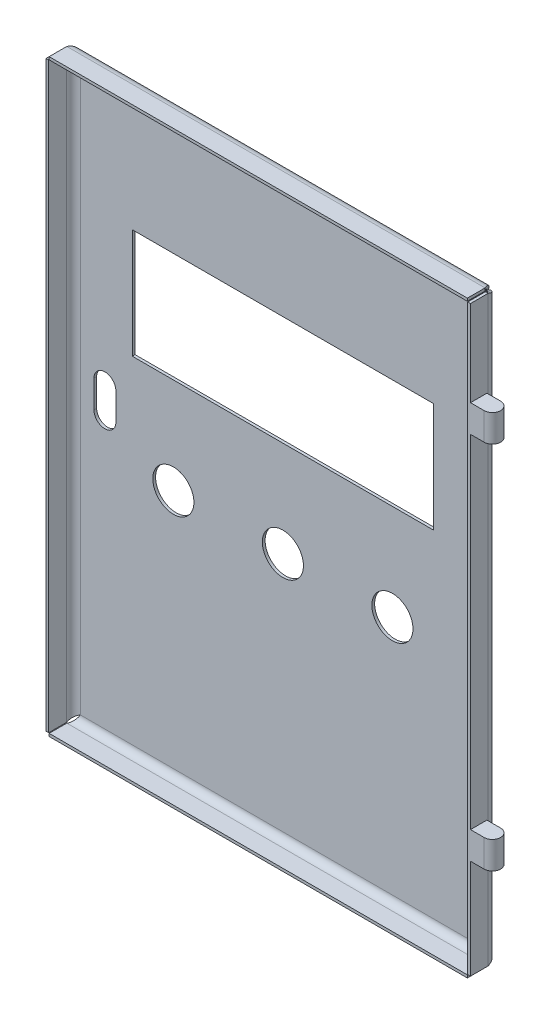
ISO-10303-21;
HEADER;
FILE_DESCRIPTION(('STEP AP214'),'2;1');
FILE_NAME('part.step','',(''),(''),'','','');
FILE_SCHEMA(('AUTOMOTIVE_DESIGN { 1 0 10303 214 1 1 1 1 }'));
ENDSEC;
DATA;
#1=APPLICATION_CONTEXT('core data for automotive mechanical design processes');
#2=APPLICATION_PROTOCOL_DEFINITION('international standard','automotive_design',2000,#1);
#3=PRODUCT_CONTEXT('',#1,'mechanical');
#4=PRODUCT('Part','Part','',(#3));
#5=PRODUCT_RELATED_PRODUCT_CATEGORY('part','',(#4));
#6=PRODUCT_DEFINITION_FORMATION('','',#4);
#7=PRODUCT_DEFINITION_CONTEXT('part definition',#1,'design');
#8=PRODUCT_DEFINITION('design','',#6,#7);
#9=PRODUCT_DEFINITION_SHAPE('','',#8);
#10=(LENGTH_UNIT() NAMED_UNIT(*) SI_UNIT(.MILLI.,.METRE.));
#11=(NAMED_UNIT(*) PLANE_ANGLE_UNIT() SI_UNIT($,.RADIAN.));
#12=(NAMED_UNIT(*) SI_UNIT($,.STERADIAN.) SOLID_ANGLE_UNIT());
#13=UNCERTAINTY_MEASURE_WITH_UNIT(LENGTH_MEASURE(1.E-05),#10,'distance_accuracy_value','');
#14=(GEOMETRIC_REPRESENTATION_CONTEXT(3) GLOBAL_UNCERTAINTY_ASSIGNED_CONTEXT((#13)) GLOBAL_UNIT_ASSIGNED_CONTEXT((#10,
#11,#12)) REPRESENTATION_CONTEXT('',''));
#15=CARTESIAN_POINT('',(0.,0.,0.));
#16=DIRECTION('',(0.,0.,1.));
#17=DIRECTION('',(1.,0.,0.));
#18=AXIS2_PLACEMENT_3D('',#15,#16,#17);
#19=CARTESIAN_POINT('',(82.5000000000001,-59.9999999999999,5.99999999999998));
#20=DIRECTION('',(0.,1.,0.));
#21=DIRECTION('',(0.,0.,1.));
#22=AXIS2_PLACEMENT_3D('',#19,#20,#21);
#23=CYLINDRICAL_SURFACE('',#22,3.);
#24=DIRECTION('',(0.,-1.,0.));
#25=VECTOR('',#24,1.);
#26=CARTESIAN_POINT('',(82.5,-59.9999999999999,2.99999999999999));
#27=LINE('',#26,#25);
#28=CARTESIAN_POINT('',(82.5,-59.9999999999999,2.99999999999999));
#29=VERTEX_POINT('',#28);
#30=CARTESIAN_POINT('',(82.5,-69.9999999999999,2.99999999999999));
#31=VERTEX_POINT('',#30);
#32=EDGE_CURVE('E918',#29,#31,#27,.T.);
#33=ORIENTED_EDGE('',*,*,#32,.F.);
#34=CARTESIAN_POINT('',(82.5000000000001,-59.9999999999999,5.99999999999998));
#35=DIRECTION('',(0.,-1.,0.));
#36=DIRECTION('',(0.,0.,-1.));
#37=AXIS2_PLACEMENT_3D('',#34,#35,#36);
#38=CIRCLE('',#37,3.);
#39=CARTESIAN_POINT('',(82.5000000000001,-59.9999999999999,8.99999999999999));
#40=VERTEX_POINT('',#39);
#41=EDGE_CURVE('E926',#40,#29,#38,.F.);
#42=ORIENTED_EDGE('',*,*,#41,.F.);
#43=DIRECTION('',(0.,-1.,0.));
#44=VECTOR('',#43,1.);
#45=CARTESIAN_POINT('',(82.5000000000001,-59.9999999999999,8.99999999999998));
#46=LINE('',#45,#44);
#47=CARTESIAN_POINT('',(82.5000000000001,-69.9999999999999,8.99999999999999));
#48=VERTEX_POINT('',#47);
#49=EDGE_CURVE('E922',#48,#40,#46,.F.);
#50=ORIENTED_EDGE('',*,*,#49,.F.);
#51=CARTESIAN_POINT('',(82.5000000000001,-69.9999999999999,5.99999999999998));
#52=DIRECTION('',(0.,1.,0.));
#53=DIRECTION('',(0.,0.,1.));
#54=AXIS2_PLACEMENT_3D('',#51,#52,#53);
#55=CIRCLE('',#54,3.);
#56=EDGE_CURVE('E929',#31,#48,#55,.F.);
#57=ORIENTED_EDGE('',*,*,#56,.F.);
#58=EDGE_LOOP('',(#33,#42,#50,#57));
#59=FACE_BOUND('',#58,.T.);
#60=ADVANCED_FACE('F129',(#59),#23,.T.);
#61=CARTESIAN_POINT('',(77.5,0.,-2.4249782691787E-13));
#62=DIRECTION('',(-1.,0.,0.));
#63=DIRECTION('',(0.,0.,1.));
#64=AXIS2_PLACEMENT_3D('',#61,#62,#63);
#65=PLANE('',#64);
#66=DIRECTION('',(0.,0.,-1.));
#67=VECTOR('',#66,1.);
#68=CARTESIAN_POINT('',(77.5,-69.9999999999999,3.));
#69=LINE('',#68,#67);
#70=CARTESIAN_POINT('',(77.5000000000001,-69.9999999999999,9.));
#71=VERTEX_POINT('',#70);
#72=CARTESIAN_POINT('',(77.5,-69.9999999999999,3.));
#73=VERTEX_POINT('',#72);
#74=EDGE_CURVE('E446',#71,#73,#69,.T.);
#75=ORIENTED_EDGE('',*,*,#74,.F.);
#76=DIRECTION('',(0.,-1.,0.));
#77=VECTOR('',#76,1.);
#78=CARTESIAN_POINT('',(77.5000000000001,0.,9.));
#79=LINE('',#78,#77);
#80=CARTESIAN_POINT('',(77.5000000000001,-106.358578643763,9.));
#81=VERTEX_POINT('',#80);
#82=EDGE_CURVE('E713',#71,#81,#79,.T.);
#83=ORIENTED_EDGE('',*,*,#82,.T.);
#84=DIRECTION('',(0.,0.,-1.));
#85=VECTOR('',#84,1.);
#86=CARTESIAN_POINT('',(77.5,-106.358578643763,0.));
#87=LINE('',#86,#85);
#88=CARTESIAN_POINT('',(77.5,-106.358578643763,2.53999999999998));
#89=VERTEX_POINT('',#88);
#90=EDGE_CURVE('E727',#89,#81,#87,.F.);
#91=ORIENTED_EDGE('',*,*,#90,.F.);
#92=DIRECTION('',(0.,1.,0.));
#93=VECTOR('',#92,1.);
#94=CARTESIAN_POINT('',(77.5,-107.5,2.53999999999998));
#95=LINE('',#94,#93);
#96=CARTESIAN_POINT('',(77.5,106.358578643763,2.53999999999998));
#97=VERTEX_POINT('',#96);
#98=EDGE_CURVE('E717',#97,#89,#95,.F.);
#99=ORIENTED_EDGE('',*,*,#98,.F.);
#100=DIRECTION('',(0.,0.,1.));
#101=VECTOR('',#100,1.);
#102=CARTESIAN_POINT('',(77.5,106.358578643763,-2.4249782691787E-13));
#103=LINE('',#102,#101);
#104=CARTESIAN_POINT('',(77.5000000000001,106.358578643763,9.));
#105=VERTEX_POINT('',#104);
#106=EDGE_CURVE('E738',#97,#105,#103,.T.);
#107=ORIENTED_EDGE('',*,*,#106,.T.);
#108=CARTESIAN_POINT('',(77.5000000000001,75.,9.));
#109=VERTEX_POINT('',#108);
#110=EDGE_CURVE('E708',#105,#109,#79,.T.);
#111=ORIENTED_EDGE('',*,*,#110,.T.);
#112=DIRECTION('',(0.,0.,1.));
#113=VECTOR('',#112,1.);
#114=CARTESIAN_POINT('',(77.5,75.,3.));
#115=LINE('',#114,#113);
#116=CARTESIAN_POINT('',(77.5,75.,2.99999999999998));
#117=VERTEX_POINT('',#116);
#118=EDGE_CURVE('E489',#117,#109,#115,.T.);
#119=ORIENTED_EDGE('',*,*,#118,.F.);
#120=DIRECTION('',(0.,1.,0.));
#121=VECTOR('',#120,1.);
#122=CARTESIAN_POINT('',(77.5,65.0000000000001,3.));
#123=LINE('',#122,#121);
#124=CARTESIAN_POINT('',(77.5,65.0000000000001,3.));
#125=VERTEX_POINT('',#124);
#126=EDGE_CURVE('E485',#125,#117,#123,.T.);
#127=ORIENTED_EDGE('',*,*,#126,.F.);
#128=DIRECTION('',(0.,0.,-1.));
#129=VECTOR('',#128,1.);
#130=CARTESIAN_POINT('',(77.5,65.0000000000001,3.));
#131=LINE('',#130,#129);
#132=CARTESIAN_POINT('',(77.5000000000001,65.0000000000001,9.));
#133=VERTEX_POINT('',#132);
#134=EDGE_CURVE('E478',#133,#125,#131,.T.);
#135=ORIENTED_EDGE('',*,*,#134,.F.);
#136=CARTESIAN_POINT('',(77.5000000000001,-59.9999999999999,9.));
#137=VERTEX_POINT('',#136);
#138=EDGE_CURVE('E712',#133,#137,#79,.T.);
#139=ORIENTED_EDGE('',*,*,#138,.T.);
#140=DIRECTION('',(0.,0.,1.));
#141=VECTOR('',#140,1.);
#142=CARTESIAN_POINT('',(77.5,-59.9999999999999,3.));
#143=LINE('',#142,#141);
#144=CARTESIAN_POINT('',(77.5,-59.9999999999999,2.99999999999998));
#145=VERTEX_POINT('',#144);
#146=EDGE_CURVE('E457',#145,#137,#143,.T.);
#147=ORIENTED_EDGE('',*,*,#146,.F.);
#148=DIRECTION('',(0.,1.,0.));
#149=VECTOR('',#148,1.);
#150=CARTESIAN_POINT('',(77.5,-69.9999999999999,3.));
#151=LINE('',#150,#149);
#152=EDGE_CURVE('E453',#73,#145,#151,.T.);
#153=ORIENTED_EDGE('',*,*,#152,.F.);
#154=EDGE_LOOP('',(#75,#83,#91,#99,#107,#111,#119,#127,#135,#139,#147,#153));
#155=FACE_BOUND('',#154,.T.);
#156=ADVANCED_FACE('F1002',(#155),#65,.F.);
#157=CARTESIAN_POINT('',(82.5000000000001,75.,5.99999999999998));
#158=DIRECTION('',(0.,1.,0.));
#159=DIRECTION('',(0.,0.,1.));
#160=AXIS2_PLACEMENT_3D('',#157,#158,#159);
#161=CYLINDRICAL_SURFACE('',#160,3.);
#162=DIRECTION('',(0.,-1.,0.));
#163=VECTOR('',#162,1.);
#164=CARTESIAN_POINT('',(82.5,75.,2.99999999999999));
#165=LINE('',#164,#163);
#166=CARTESIAN_POINT('',(82.5,75.,2.99999999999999));
#167=VERTEX_POINT('',#166);
#168=CARTESIAN_POINT('',(82.5,65.0000000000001,2.99999999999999));
#169=VERTEX_POINT('',#168);
#170=EDGE_CURVE('E903',#167,#169,#165,.T.);
#171=ORIENTED_EDGE('',*,*,#170,.F.);
#172=CARTESIAN_POINT('',(82.5000000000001,75.,5.99999999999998));
#173=DIRECTION('',(0.,-1.,0.));
#174=DIRECTION('',(0.,0.,-1.));
#175=AXIS2_PLACEMENT_3D('',#172,#173,#174);
#176=CIRCLE('',#175,3.);
#177=CARTESIAN_POINT('',(82.5000000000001,75.,8.99999999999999));
#178=VERTEX_POINT('',#177);
#179=EDGE_CURVE('E912',#178,#167,#176,.F.);
#180=ORIENTED_EDGE('',*,*,#179,.F.);
#181=DIRECTION('',(0.,-1.,0.));
#182=VECTOR('',#181,1.);
#183=CARTESIAN_POINT('',(82.5000000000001,75.,8.99999999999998));
#184=LINE('',#183,#182);
#185=CARTESIAN_POINT('',(82.5000000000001,65.0000000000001,8.99999999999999));
#186=VERTEX_POINT('',#185);
#187=EDGE_CURVE('E907',#186,#178,#184,.F.);
#188=ORIENTED_EDGE('',*,*,#187,.F.);
#189=CARTESIAN_POINT('',(82.5000000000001,65.0000000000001,5.99999999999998));
#190=DIRECTION('',(0.,1.,0.));
#191=DIRECTION('',(0.,0.,1.));
#192=AXIS2_PLACEMENT_3D('',#189,#190,#191);
#193=CIRCLE('',#192,3.);
#194=EDGE_CURVE('E915',#169,#186,#193,.F.);
#195=ORIENTED_EDGE('',*,*,#194,.F.);
#196=EDGE_LOOP('',(#171,#180,#188,#195));
#197=FACE_BOUND('',#196,.T.);
#198=ADVANCED_FACE('F1007',(#197),#161,.T.);
#199=CARTESIAN_POINT('',(0.,0.,-1.));
#200=DIRECTION('',(0.,0.,1.));
#201=DIRECTION('',(1.,0.,0.));
#202=AXIS2_PLACEMENT_3D('',#199,#200,#201);
#203=PLANE('',#202);
#204=CARTESIAN_POINT('',(40.,-16.04,-1.));
#205=DIRECTION('',(0.,0.,1.));
#206=DIRECTION('',(1.,0.,0.));
#207=AXIS2_PLACEMENT_3D('',#204,#205,#206);
#208=CIRCLE('',#207,7.5);
#209=CARTESIAN_POINT('',(47.5,-16.04,-1.));
#210=VERTEX_POINT('',#209);
#211=EDGE_CURVE('E961',#210,#210,#208,.T.);
#212=ORIENTED_EDGE('',*,*,#211,.T.);
#213=EDGE_LOOP('',(#212));
#214=FACE_BOUND('',#213,.T.);
#215=CARTESIAN_POINT('',(-40.,-16.04,-1.));
#216=DIRECTION('',(0.,0.,1.));
#217=DIRECTION('',(1.,0.,0.));
#218=AXIS2_PLACEMENT_3D('',#215,#216,#217);
#219=CIRCLE('',#218,7.5);
#220=CARTESIAN_POINT('',(-32.5,-16.04,-1.));
#221=VERTEX_POINT('',#220);
#222=EDGE_CURVE('E955',#221,#221,#219,.T.);
#223=ORIENTED_EDGE('',*,*,#222,.T.);
#224=EDGE_LOOP('',(#223));
#225=FACE_BOUND('',#224,.T.);
#226=CARTESIAN_POINT('',(0.,-16.04,-1.));
#227=DIRECTION('',(0.,0.,1.));
#228=DIRECTION('',(1.,0.,0.));
#229=AXIS2_PLACEMENT_3D('',#226,#227,#228);
#230=CIRCLE('',#229,7.5);
#231=CARTESIAN_POINT('',(7.5,-16.04,-1.));
#232=VERTEX_POINT('',#231);
#233=EDGE_CURVE('E947',#232,#232,#230,.T.);
#234=ORIENTED_EDGE('',*,*,#233,.T.);
#235=EDGE_LOOP('',(#234));
#236=FACE_BOUND('',#235,.T.);
#237=DIRECTION('',(-1.,0.,0.));
#238=VECTOR('',#237,1.);
#239=CARTESIAN_POINT('',(-55.,18.96,-1.));
#240=LINE('',#239,#238);
#241=CARTESIAN_POINT('',(55.,18.96,-1.));
#242=VERTEX_POINT('',#241);
#243=CARTESIAN_POINT('',(-55.,18.96,-1.));
#244=VERTEX_POINT('',#243);
#245=EDGE_CURVE('E375',#242,#244,#240,.T.);
#246=ORIENTED_EDGE('',*,*,#245,.F.);
#247=DIRECTION('',(0.,-1.,0.));
#248=VECTOR('',#247,1.);
#249=CARTESIAN_POINT('',(55.,18.96,-1.));
#250=LINE('',#249,#248);
#251=CARTESIAN_POINT('',(55.,58.96,-1.));
#252=VERTEX_POINT('',#251);
#253=EDGE_CURVE('E145',#252,#242,#250,.T.);
#254=ORIENTED_EDGE('',*,*,#253,.F.);
#255=DIRECTION('',(1.,0.,0.));
#256=VECTOR('',#255,1.);
#257=CARTESIAN_POINT('',(-55.,58.96,-1.));
#258=LINE('',#257,#256);
#259=CARTESIAN_POINT('',(-55.,58.96,-1.));
#260=VERTEX_POINT('',#259);
#261=EDGE_CURVE('E383',#260,#252,#258,.T.);
#262=ORIENTED_EDGE('',*,*,#261,.F.);
#263=DIRECTION('',(0.,1.,0.));
#264=VECTOR('',#263,1.);
#265=CARTESIAN_POINT('',(-55.,18.96,-1.));
#266=LINE('',#265,#264);
#267=EDGE_CURVE('E365',#244,#260,#266,.T.);
#268=ORIENTED_EDGE('',*,*,#267,.F.);
#269=EDGE_LOOP('',(#246,#254,#262,#268));
#270=FACE_BOUND('',#269,.T.);
#271=DIRECTION('',(0.,1.,0.));
#272=VECTOR('',#271,1.);
#273=CARTESIAN_POINT('',(-69.,-5.,-1.));
#274=LINE('',#273,#272);
#275=CARTESIAN_POINT('',(-69.,-5.,-1.));
#276=VERTEX_POINT('',#275);
#277=CARTESIAN_POINT('',(-69.,5.,-1.));
#278=VERTEX_POINT('',#277);
#279=EDGE_CURVE('E418',#276,#278,#274,.T.);
#280=ORIENTED_EDGE('',*,*,#279,.F.);
#281=CARTESIAN_POINT('',(-65.,-5.,-1.));
#282=DIRECTION('',(0.,0.,-1.));
#283=DIRECTION('',(-1.,0.,0.));
#284=AXIS2_PLACEMENT_3D('',#281,#282,#283);
#285=CIRCLE('',#284,4.);
#286=CARTESIAN_POINT('',(-61.,-5.,-1.));
#287=VERTEX_POINT('',#286);
#288=EDGE_CURVE('E393',#287,#276,#285,.T.);
#289=ORIENTED_EDGE('',*,*,#288,.F.);
#290=DIRECTION('',(0.,-1.,0.));
#291=VECTOR('',#290,1.);
#292=CARTESIAN_POINT('',(-61.,-5.,-1.));
#293=LINE('',#292,#291);
#294=CARTESIAN_POINT('',(-61.,5.,-1.));
#295=VERTEX_POINT('',#294);
#296=EDGE_CURVE('E403',#295,#287,#293,.T.);
#297=ORIENTED_EDGE('',*,*,#296,.F.);
#298=CARTESIAN_POINT('',(-65.,5.,-1.));
#299=DIRECTION('',(0.,0.,-1.));
#300=DIRECTION('',(-1.,0.,0.));
#301=AXIS2_PLACEMENT_3D('',#298,#299,#300);
#302=CIRCLE('',#301,4.);
#303=EDGE_CURVE('E422',#278,#295,#302,.T.);
#304=ORIENTED_EDGE('',*,*,#303,.F.);
#305=EDGE_LOOP('',(#280,#289,#297,#304));
#306=FACE_BOUND('',#305,.T.);
#307=DIRECTION('',(0.,-1.,0.));
#308=VECTOR('',#307,1.);
#309=CARTESIAN_POINT('',(-73.96,-106.358578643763,-1.00000000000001));
#310=LINE('',#309,#308);
#311=CARTESIAN_POINT('',(-73.96,-103.96,-1.00000000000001));
#312=VERTEX_POINT('',#311);
#313=CARTESIAN_POINT('',(-73.96,103.96,-1.00000000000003));
#314=VERTEX_POINT('',#313);
#315=EDGE_CURVE('E552',#312,#314,#310,.F.);
#316=ORIENTED_EDGE('',*,*,#315,.T.);
#317=DIRECTION('',(-1.,0.,0.));
#318=VECTOR('',#317,1.);
#319=CARTESIAN_POINT('',(-76.3585786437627,103.96,-1.00000000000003));
#320=LINE('',#319,#318);
#321=CARTESIAN_POINT('',(73.96,103.96,-1.00000000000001));
#322=VERTEX_POINT('',#321);
#323=EDGE_CURVE('E870',#314,#322,#320,.F.);
#324=ORIENTED_EDGE('',*,*,#323,.T.);
#325=DIRECTION('',(0.,1.,0.));
#326=VECTOR('',#325,1.);
#327=CARTESIAN_POINT('',(73.96,106.358578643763,-1.00000000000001));
#328=LINE('',#327,#326);
#329=CARTESIAN_POINT('',(73.96,-103.96,-1.00000000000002));
#330=VERTEX_POINT('',#329);
#331=EDGE_CURVE('E751',#322,#330,#328,.F.);
#332=ORIENTED_EDGE('',*,*,#331,.T.);
#333=DIRECTION('',(1.,0.,0.));
#334=VECTOR('',#333,1.);
#335=CARTESIAN_POINT('',(76.3585786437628,-103.96,-1.00000000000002));
#336=LINE('',#335,#334);
#337=EDGE_CURVE('E666',#330,#312,#336,.F.);
#338=ORIENTED_EDGE('',*,*,#337,.T.);
#339=EDGE_LOOP('',(#316,#324,#332,#338));
#340=FACE_BOUND('',#339,.T.);
#341=ADVANCED_FACE('F380',(#214,#225,#236,#270,#306,#340),#203,.F.);
#342=CARTESIAN_POINT('',(0.,0.,0.));
#343=DIRECTION('',(0.,0.,1.));
#344=DIRECTION('',(1.,0.,0.));
#345=AXIS2_PLACEMENT_3D('',#342,#343,#344);
#346=PLANE('',#345);
#347=CARTESIAN_POINT('',(40.,-16.04,0.));
#348=DIRECTION('',(0.,0.,1.));
#349=DIRECTION('',(1.,0.,0.));
#350=AXIS2_PLACEMENT_3D('',#347,#348,#349);
#351=CIRCLE('',#350,7.5);
#352=CARTESIAN_POINT('',(47.5,-16.04,0.));
#353=VERTEX_POINT('',#352);
#354=EDGE_CURVE('E965',#353,#353,#351,.T.);
#355=ORIENTED_EDGE('',*,*,#354,.F.);
#356=EDGE_LOOP('',(#355));
#357=FACE_BOUND('',#356,.T.);
#358=CARTESIAN_POINT('',(-40.,-16.04,0.));
#359=DIRECTION('',(0.,0.,1.));
#360=DIRECTION('',(1.,0.,0.));
#361=AXIS2_PLACEMENT_3D('',#358,#359,#360);
#362=CIRCLE('',#361,7.5);
#363=CARTESIAN_POINT('',(-32.5,-16.04,0.));
#364=VERTEX_POINT('',#363);
#365=EDGE_CURVE('E957',#364,#364,#362,.T.);
#366=ORIENTED_EDGE('',*,*,#365,.F.);
#367=EDGE_LOOP('',(#366));
#368=FACE_BOUND('',#367,.T.);
#369=CARTESIAN_POINT('',(0.,-16.04,0.));
#370=DIRECTION('',(0.,0.,1.));
#371=DIRECTION('',(1.,0.,0.));
#372=AXIS2_PLACEMENT_3D('',#369,#370,#371);
#373=CIRCLE('',#372,7.5);
#374=CARTESIAN_POINT('',(7.5,-16.04,0.));
#375=VERTEX_POINT('',#374);
#376=EDGE_CURVE('E950',#375,#375,#373,.T.);
#377=ORIENTED_EDGE('',*,*,#376,.F.);
#378=EDGE_LOOP('',(#377));
#379=FACE_BOUND('',#378,.T.);
#380=DIRECTION('',(0.,1.,0.));
#381=VECTOR('',#380,1.);
#382=CARTESIAN_POINT('',(55.,0.,0.));
#383=LINE('',#382,#381);
#384=CARTESIAN_POINT('',(55.,18.96,0.));
#385=VERTEX_POINT('',#384);
#386=CARTESIAN_POINT('',(55.,58.96,0.));
#387=VERTEX_POINT('',#386);
#388=EDGE_CURVE('E13',#385,#387,#383,.T.);
#389=ORIENTED_EDGE('',*,*,#388,.F.);
#390=DIRECTION('',(1.,0.,0.));
#391=VECTOR('',#390,1.);
#392=CARTESIAN_POINT('',(0.,18.96,0.));
#393=LINE('',#392,#391);
#394=CARTESIAN_POINT('',(-55.,18.96,0.));
#395=VERTEX_POINT('',#394);
#396=EDGE_CURVE('E932',#395,#385,#393,.T.);
#397=ORIENTED_EDGE('',*,*,#396,.F.);
#398=DIRECTION('',(0.,-1.,0.));
#399=VECTOR('',#398,1.);
#400=CARTESIAN_POINT('',(-55.,0.,0.));
#401=LINE('',#400,#399);
#402=CARTESIAN_POINT('',(-55.,58.96,0.));
#403=VERTEX_POINT('',#402);
#404=EDGE_CURVE('E368',#403,#395,#401,.T.);
#405=ORIENTED_EDGE('',*,*,#404,.F.);
#406=DIRECTION('',(-1.,0.,0.));
#407=VECTOR('',#406,1.);
#408=CARTESIAN_POINT('',(0.,58.96,0.));
#409=LINE('',#408,#407);
#410=EDGE_CURVE('E138',#387,#403,#409,.T.);
#411=ORIENTED_EDGE('',*,*,#410,.F.);
#412=EDGE_LOOP('',(#389,#397,#405,#411));
#413=FACE_BOUND('',#412,.T.);
#414=CARTESIAN_POINT('',(-65.,-5.,0.));
#415=DIRECTION('',(0.,0.,-1.));
#416=DIRECTION('',(-1.,0.,0.));
#417=AXIS2_PLACEMENT_3D('',#414,#415,#416);
#418=CIRCLE('',#417,4.);
#419=CARTESIAN_POINT('',(-61.,-5.,0.));
#420=VERTEX_POINT('',#419);
#421=CARTESIAN_POINT('',(-69.,-5.,0.));
#422=VERTEX_POINT('',#421);
#423=EDGE_CURVE('E398',#420,#422,#418,.T.);
#424=ORIENTED_EDGE('',*,*,#423,.T.);
#425=DIRECTION('',(0.,1.,0.));
#426=VECTOR('',#425,1.);
#427=CARTESIAN_POINT('',(-69.,-5.,0.));
#428=LINE('',#427,#426);
#429=CARTESIAN_POINT('',(-69.,5.,0.));
#430=VERTEX_POINT('',#429);
#431=EDGE_CURVE('E402',#422,#430,#428,.T.);
#432=ORIENTED_EDGE('',*,*,#431,.T.);
#433=CARTESIAN_POINT('',(-65.,5.,0.));
#434=DIRECTION('',(0.,0.,-1.));
#435=DIRECTION('',(-1.,0.,0.));
#436=AXIS2_PLACEMENT_3D('',#433,#434,#435);
#437=CIRCLE('',#436,4.);
#438=CARTESIAN_POINT('',(-61.,5.,0.));
#439=VERTEX_POINT('',#438);
#440=EDGE_CURVE('E407',#430,#439,#437,.T.);
#441=ORIENTED_EDGE('',*,*,#440,.T.);
#442=DIRECTION('',(0.,-1.,0.));
#443=VECTOR('',#442,1.);
#444=CARTESIAN_POINT('',(-61.,-5.,0.));
#445=LINE('',#444,#443);
#446=EDGE_CURVE('E411',#439,#420,#445,.T.);
#447=ORIENTED_EDGE('',*,*,#446,.T.);
#448=EDGE_LOOP('',(#424,#432,#441,#447));
#449=FACE_BOUND('',#448,.T.);
#450=DIRECTION('',(-1.,0.,0.));
#451=VECTOR('',#450,1.);
#452=CARTESIAN_POINT('',(-76.3585786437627,103.96,0.));
#453=LINE('',#452,#451);
#454=CARTESIAN_POINT('',(-73.96,103.96,0.));
#455=VERTEX_POINT('',#454);
#456=CARTESIAN_POINT('',(73.96,103.96,0.));
#457=VERTEX_POINT('',#456);
#458=EDGE_CURVE('E902',#455,#457,#453,.F.);
#459=ORIENTED_EDGE('',*,*,#458,.F.);
#460=DIRECTION('',(0.,-1.,0.));
#461=VECTOR('',#460,1.);
#462=CARTESIAN_POINT('',(-73.96,-106.358578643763,0.));
#463=LINE('',#462,#461);
#464=CARTESIAN_POINT('',(-73.96,-103.96,0.));
#465=VERTEX_POINT('',#464);
#466=EDGE_CURVE('E547',#465,#455,#463,.F.);
#467=ORIENTED_EDGE('',*,*,#466,.F.);
#468=DIRECTION('',(1.,0.,0.));
#469=VECTOR('',#468,1.);
#470=CARTESIAN_POINT('',(76.3585786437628,-103.96,0.));
#471=LINE('',#470,#469);
#472=CARTESIAN_POINT('',(73.96,-103.96,0.));
#473=VERTEX_POINT('',#472);
#474=EDGE_CURVE('E699',#473,#465,#471,.F.);
#475=ORIENTED_EDGE('',*,*,#474,.F.);
#476=DIRECTION('',(0.,1.,0.));
#477=VECTOR('',#476,1.);
#478=CARTESIAN_POINT('',(73.96,106.358578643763,0.));
#479=LINE('',#478,#477);
#480=EDGE_CURVE('E746',#457,#473,#479,.F.);
#481=ORIENTED_EDGE('',*,*,#480,.F.);
#482=EDGE_LOOP('',(#459,#467,#475,#481));
#483=FACE_BOUND('',#482,.T.);
#484=ADVANCED_FACE('F943',(#357,#368,#379,#413,#449,#483),#346,.T.);
#485=CARTESIAN_POINT('',(73.9600000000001,103.96,-1.01000000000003));
#486=CARTESIAN_POINT('',(74.159911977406,104.424764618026,-1.01000000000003));
#487=CARTESIAN_POINT('',(74.3597631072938,104.889204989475,-0.917603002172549));
#488=CARTESIAN_POINT('',(74.7595262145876,105.747847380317,-0.561941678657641));
#489=CARTESIAN_POINT('',(74.9594077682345,106.141640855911,-0.298817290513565));
#490=CARTESIAN_POINT('',(75.3591708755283,106.798817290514,0.358359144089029));
#491=CARTESIAN_POINT('',(75.5590524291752,107.061941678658,0.752152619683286));
#492=CARTESIAN_POINT('',(75.958815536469,107.417603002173,1.61079501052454));
#493=CARTESIAN_POINT('',(76.1586666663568,107.51,2.07523538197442));
#494=CARTESIAN_POINT('',(76.3585786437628,107.51,2.53999999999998));
#495=CARTESIAN_POINT('',(73.9600000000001,103.96,-1.00000000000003));
#496=CARTESIAN_POINT('',(74.1599119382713,104.423455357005,-1.00000000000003));
#497=CARTESIAN_POINT('',(74.3597631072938,104.886587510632,-0.907863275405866));
#498=CARTESIAN_POINT('',(74.7595262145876,105.742811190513,-0.553203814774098));
#499=CARTESIAN_POINT('',(74.9594077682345,106.135495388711,-0.290820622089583));
#500=CARTESIAN_POINT('',(75.3591708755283,106.79082062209,0.364504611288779));
#501=CARTESIAN_POINT('',(75.5590524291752,107.053203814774,0.757188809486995));
#502=CARTESIAN_POINT('',(75.958815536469,107.407863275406,1.61341248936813));
#503=CARTESIAN_POINT('',(76.1586667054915,107.5,2.07654464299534));
#504=CARTESIAN_POINT('',(76.3585786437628,107.5,2.53999999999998));
#505=CARTESIAN_POINT('',(73.9600000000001,103.96,0.));
#506=CARTESIAN_POINT('',(74.1599080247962,104.292529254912,0.));
#507=CARTESIAN_POINT('',(74.3597631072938,104.624839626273,0.0661094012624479));
#508=CARTESIAN_POINT('',(74.7595262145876,105.239192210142,0.320582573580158));
#509=CARTESIAN_POINT('',(74.9594077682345,105.520948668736,0.508846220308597));
#510=CARTESIAN_POINT('',(75.3591708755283,105.991153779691,0.979051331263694));
#511=CARTESIAN_POINT('',(75.5590524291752,106.17941742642,1.2608077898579));
#512=CARTESIAN_POINT('',(75.958815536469,106.433890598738,1.87516037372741));
#513=CARTESIAN_POINT('',(76.1586706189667,106.5,2.20747074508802));
#514=CARTESIAN_POINT('',(76.3585786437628,106.5,2.53999999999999));
#515=CARTESIAN_POINT('',(73.9600000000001,103.96,0.0100999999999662));
#516=CARTESIAN_POINT('',(74.1599079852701,104.291206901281,0.010099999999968));
#517=CARTESIAN_POINT('',(74.3597631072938,104.622195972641,0.0759465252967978));
#518=CARTESIAN_POINT('',(74.7595262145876,105.23410565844,0.329407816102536));
#519=CARTESIAN_POINT('',(74.9594077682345,105.514741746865,0.516922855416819));
#520=CARTESIAN_POINT('',(75.3591708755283,105.983077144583,0.985258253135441));
#521=CARTESIAN_POINT('',(75.5590524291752,106.170592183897,1.26589434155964));
#522=CARTESIAN_POINT('',(75.958815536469,106.424053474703,1.87780402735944));
#523=CARTESIAN_POINT('',(76.1586706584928,106.4899,2.20879309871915));
#524=CARTESIAN_POINT('',(76.3585786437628,106.4899,2.53999999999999));
#525=B_SPLINE_SURFACE_WITH_KNOTS('',1,3,((#485,#486,#487,#488,#489,#490,#491,#492,#493,#494),
(#495,#496,#497,#498,#499,#500,#501,#502,#503,#504),(#505,#506,#507,#508,#509,#510,#511,#512,
#513,#514),(#515,#516,#517,#518,#519,#520,#521,#522,#523,#524)),.UNSPECIFIED.,.F.,.F.,.F.,(2,1,
1,2),(4,2,2,2,4),(-0.01,0.,1.,1.0101),(0.,0.25,0.5,0.75,1.),.UNSPECIFIED.);
#526=DIRECTION('',(0.,-1.,0.));
#527=VECTOR('',#526,1.);
#528=CARTESIAN_POINT('',(76.3585786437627,106.5,2.53999999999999));
#529=LINE('',#528,#527);
#530=CARTESIAN_POINT('',(76.3585786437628,107.5,2.53999999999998));
#531=VERTEX_POINT('',#530);
#532=CARTESIAN_POINT('',(76.3585786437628,106.5,2.53999999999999));
#533=VERTEX_POINT('',#532);
#534=EDGE_CURVE('E1835',#531,#533,#529,.T.);
#535=CARTESIAN_POINT('',(73.9600000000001,103.96,0.));
#536=CARTESIAN_POINT('',(74.0043885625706,104.033833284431,-8.57862831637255E-06));
#537=CARTESIAN_POINT('',(74.0487761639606,104.107665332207,0.00321900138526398));
#538=CARTESIAN_POINT('',(74.1375442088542,104.254760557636,0.0160834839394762));
#539=CARTESIAN_POINT('',(74.1819246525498,104.328023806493,0.0257195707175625));
#540=CARTESIAN_POINT('',(74.2707040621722,104.473466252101,0.0513437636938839));
#541=CARTESIAN_POINT('',(74.315103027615,104.545644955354,0.0673346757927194));
#542=CARTESIAN_POINT('',(74.403905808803,104.688336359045,0.105542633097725));
#543=CARTESIAN_POINT('',(74.4483096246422,104.758848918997,0.12776020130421));
#544=CARTESIAN_POINT('',(74.5428513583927,104.906631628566,0.181517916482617));
#545=CARTESIAN_POINT('',(74.59299030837,104.983600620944,0.213890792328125));
#546=CARTESIAN_POINT('',(74.6932738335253,105.133996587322,0.286047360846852));
#547=CARTESIAN_POINT('',(74.743418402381,105.207422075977,0.325834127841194));
#548=CARTESIAN_POINT('',(74.8937742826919,105.421169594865,0.455701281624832));
#549=CARTESIAN_POINT('',(74.994054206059,105.555195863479,0.556373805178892));
#550=CARTESIAN_POINT('',(75.1946342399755,105.800930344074,0.782044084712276));
#551=CARTESIAN_POINT('',(75.2949343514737,105.912635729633,0.907044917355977));
#552=CARTESIAN_POINT('',(75.44532004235,106.060220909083,1.1090324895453));
#553=CARTESIAN_POINT('',(75.495480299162,106.106117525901,1.17884132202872));
#554=CARTESIAN_POINT('',(75.5957989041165,106.190817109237,1.3226235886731));
#555=CARTESIAN_POINT('',(75.6459572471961,106.229622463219,1.39659561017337));
#556=CARTESIAN_POINT('',(75.7512702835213,106.303257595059,1.55554000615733));
#557=CARTESIAN_POINT('',(75.8064252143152,106.337306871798,1.64087433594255));
#558=CARTESIAN_POINT('',(75.9167393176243,106.395982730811,1.81473556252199));
#559=CARTESIAN_POINT('',(75.9718984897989,106.420608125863,1.90326286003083));
#560=CARTESIAN_POINT('',(76.0823093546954,106.460167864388,2.08261576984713));
#561=CARTESIAN_POINT('',(76.1375610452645,106.475085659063,2.17344503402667));
#562=CARTESIAN_POINT('',(76.2480670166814,106.49501234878,2.35618226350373));
#563=CARTESIAN_POINT('',(76.3033212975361,106.5000212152,2.44809023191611));
#564=CARTESIAN_POINT('',(76.3585786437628,106.5,2.53999999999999));
#565=B_SPLINE_CURVE_WITH_KNOTS('',3,(#535,#536,#537,#538,#539,#540,#541,#542,#543,#544,#545,
#546,#547,#548,#549,#550,#551,#552,#553,#554,#555,#556,#557,#558,#559,#560,#561,#562,#563,#564),
.UNSPECIFIED.,.F.,.F.,(4,2,2,2,2,2,2,2,2,2,2,2,2,2,4),(0.,0.258384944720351,0.516737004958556,
0.77520326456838,1.03369124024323,1.32551256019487,1.61745516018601,2.20048662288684,
2.78359186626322,3.07563941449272,3.36758845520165,3.68860510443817,4.00966218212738,
4.33126515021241,4.65286904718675),.UNSPECIFIED.);
#566=EDGE_CURVE('E871',#457,#533,#565,.T.);
#567=DIRECTION('',(0.,0.,-1.));
#568=VECTOR('',#567,1.);
#569=CARTESIAN_POINT('',(73.9600000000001,103.96,0.));
#570=LINE('',#569,#568);
#571=EDGE_CURVE('E908',#457,#322,#570,.T.);
#572=CARTESIAN_POINT('',(73.9600000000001,103.96,-1.00000000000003));
#573=CARTESIAN_POINT('',(74.0067903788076,104.068468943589,-1.00001507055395));
#574=CARTESIAN_POINT('',(74.0535794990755,104.17693608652,-0.99501525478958));
#575=CARTESIAN_POINT('',(74.1471530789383,104.392950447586,-0.975094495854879));
#576=CARTESIAN_POINT('',(74.1939375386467,104.500497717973,-0.96017412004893));
#577=CARTESIAN_POINT('',(74.2874671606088,104.713682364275,-0.920536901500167));
#578=CARTESIAN_POINT('',(74.3342123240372,104.819321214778,-0.895827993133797));
#579=CARTESIAN_POINT('',(74.4277060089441,105.027884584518,-0.836827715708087));
#580=CARTESIAN_POINT('',(74.4744545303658,105.130809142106,-0.802536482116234));
#581=CARTESIAN_POINT('',(74.567983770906,105.333150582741,-0.724631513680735));
#582=CARTESIAN_POINT('',(74.614764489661,105.432564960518,-0.681011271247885));
#583=CARTESIAN_POINT('',(74.7083422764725,105.627007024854,-0.58481316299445));
#584=CARTESIAN_POINT('',(74.7551393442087,105.722033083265,-0.532232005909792));
#585=CARTESIAN_POINT('',(74.8486992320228,105.906796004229,-0.418604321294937));
#586=CARTESIAN_POINT('',(74.8954620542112,105.996536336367,-0.357563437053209));
#587=CARTESIAN_POINT('',(74.9890078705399,106.170066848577,-0.227483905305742));
#588=CARTESIAN_POINT('',(75.0357908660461,106.253854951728,-0.158442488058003));
#589=CARTESIAN_POINT('',(75.1293434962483,106.414717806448,-0.0129817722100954));
#590=CARTESIAN_POINT('',(75.1761131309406,106.491794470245,0.063435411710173));
#591=CARTESIAN_POINT('',(75.2696526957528,106.638610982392,0.223019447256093));
#592=CARTESIAN_POINT('',(75.3164226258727,106.708350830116,0.306186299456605));
#593=CARTESIAN_POINT('',(75.4099915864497,106.839953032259,0.478630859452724));
#594=CARTESIAN_POINT('',(75.4567906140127,106.901809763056,0.567912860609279));
#595=CARTESIAN_POINT('',(75.5503749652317,107.017043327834,0.751746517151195));
#596=CARTESIAN_POINT('',(75.5971602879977,107.070423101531,0.846296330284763));
#597=CARTESIAN_POINT('',(75.6907773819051,107.168325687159,1.03998894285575));
#598=CARTESIAN_POINT('',(75.7376091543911,107.212839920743,1.13913607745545));
#599=CARTESIAN_POINT('',(75.8312559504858,107.292555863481,1.34106347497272));
#600=CARTESIAN_POINT('',(75.8780709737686,107.327761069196,1.44384235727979));
#601=CARTESIAN_POINT('',(75.9716355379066,107.388544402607,1.65206289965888));
#602=CARTESIAN_POINT('',(76.0183850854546,107.414134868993,1.75750096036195));
#603=CARTESIAN_POINT('',(76.1118655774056,107.455526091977,1.97023703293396));
#604=CARTESIAN_POINT('',(76.1585965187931,107.471331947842,2.07753404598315));
#605=CARTESIAN_POINT('',(76.2308831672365,107.488124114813,2.24427114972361));
#606=CARTESIAN_POINT('',(76.2564446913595,107.492580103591,2.30337921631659));
#607=CARTESIAN_POINT('',(76.307529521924,107.498515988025,2.42165589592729));
#608=CARTESIAN_POINT('',(76.3330528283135,107.500000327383,2.48082428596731));
#609=CARTESIAN_POINT('',(76.3585786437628,107.5,2.53999999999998));
#610=B_SPLINE_CURVE_WITH_KNOTS('',3,(#572,#573,#574,#575,#576,#577,#578,#579,#580,#581,#582,
#583,#584,#585,#586,#587,#588,#589,#590,#591,#592,#593,#594,#595,#596,#597,#598,#599,#600,#601,
#602,#603,#604,#605,#606,#607,#608,#609),.UNSPECIFIED.,.F.,.F.,(4,2,2,2,2,2,2,2,2,2,2,2,2,2,2,2,
2,2,4),(0.,0.354283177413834,0.708546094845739,1.06252243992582,1.41649378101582,
1.77071285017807,2.12506230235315,2.47917650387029,2.83341366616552,3.18754956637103,
3.54168549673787,3.8960726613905,4.25033665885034,4.6049417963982,4.9594135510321,
5.31342884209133,5.66725948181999,5.86085577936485,6.05416236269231),.UNSPECIFIED.);
#611=EDGE_CURVE('E854',#322,#531,#610,.T.);
#612=ORIENTED_EDGE('',*,*,#534,.T.);
#613=ORIENTED_EDGE('',*,*,#566,.F.);
#614=ORIENTED_EDGE('',*,*,#571,.T.);
#615=ORIENTED_EDGE('',*,*,#611,.T.);
#616=EDGE_LOOP('',(#612,#613,#614,#615));
#617=FACE_BOUND('',#616,.T.);
#618=ADVANCED_FACE('F882',(#617),#525,.F.);
#619=CARTESIAN_POINT('',(-76.3585786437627,107.51,2.53999999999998));
#620=CARTESIAN_POINT('',(-76.1586666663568,107.51,2.07523538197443));
#621=CARTESIAN_POINT('',(-75.9588155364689,107.417603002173,1.61079501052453));
#622=CARTESIAN_POINT('',(-75.5590524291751,107.061941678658,0.752152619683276));
#623=CARTESIAN_POINT('',(-75.3591708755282,106.798817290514,0.358359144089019));
#624=CARTESIAN_POINT('',(-74.9594077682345,106.141640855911,-0.298817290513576));
#625=CARTESIAN_POINT('',(-74.7595262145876,105.747847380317,-0.561941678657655));
#626=CARTESIAN_POINT('',(-74.3597631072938,104.889204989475,-0.917603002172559));
#627=CARTESIAN_POINT('',(-74.1599119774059,104.424764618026,-1.01000000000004));
#628=CARTESIAN_POINT('',(-73.96,103.96,-1.01000000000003));
#629=CARTESIAN_POINT('',(-76.3585786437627,107.5,2.53999999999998));
#630=CARTESIAN_POINT('',(-76.1586667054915,107.5,2.07654464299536));
#631=CARTESIAN_POINT('',(-75.9588155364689,107.407863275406,1.61341248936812));
#632=CARTESIAN_POINT('',(-75.5590524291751,107.053203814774,0.757188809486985));
#633=CARTESIAN_POINT('',(-75.3591708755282,106.79082062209,0.364504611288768));
#634=CARTESIAN_POINT('',(-74.9594077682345,106.135495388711,-0.290820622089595));
#635=CARTESIAN_POINT('',(-74.7595262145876,105.742811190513,-0.553203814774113));
#636=CARTESIAN_POINT('',(-74.3597631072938,104.886587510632,-0.907863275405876));
#637=CARTESIAN_POINT('',(-74.1599119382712,104.423455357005,-1.00000000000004));
#638=CARTESIAN_POINT('',(-73.96,103.96,-1.00000000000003));
#639=CARTESIAN_POINT('',(-76.3585786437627,106.5,2.53999999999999));
#640=CARTESIAN_POINT('',(-76.1586706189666,106.5,2.207470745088));
#641=CARTESIAN_POINT('',(-75.9588155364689,106.433890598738,1.87516037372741));
#642=CARTESIAN_POINT('',(-75.5590524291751,106.17941742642,1.26080778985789));
#643=CARTESIAN_POINT('',(-75.3591708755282,105.991153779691,0.979051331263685));
#644=CARTESIAN_POINT('',(-74.9594077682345,105.520948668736,0.508846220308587));
#645=CARTESIAN_POINT('',(-74.7595262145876,105.239192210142,0.320582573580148));
#646=CARTESIAN_POINT('',(-74.3597631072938,104.624839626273,0.0661094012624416));
#647=CARTESIAN_POINT('',(-74.1599080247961,104.292529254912,0.));
#648=CARTESIAN_POINT('',(-73.96,103.96,0.));
#649=CARTESIAN_POINT('',(-76.3585786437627,106.4899,2.53999999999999));
#650=CARTESIAN_POINT('',(-76.1586706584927,106.4899,2.20879309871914));
#651=CARTESIAN_POINT('',(-75.9588155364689,106.424053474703,1.87780402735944));
#652=CARTESIAN_POINT('',(-75.5590524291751,106.170592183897,1.26589434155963));
#653=CARTESIAN_POINT('',(-75.3591708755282,105.983077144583,0.985258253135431));
#654=CARTESIAN_POINT('',(-74.9594077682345,105.514741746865,0.516922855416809));
#655=CARTESIAN_POINT('',(-74.7595262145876,105.23410565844,0.329407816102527));
#656=CARTESIAN_POINT('',(-74.3597631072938,104.622195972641,0.0759465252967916));
#657=CARTESIAN_POINT('',(-74.15990798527,104.291206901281,0.0100999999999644));
#658=CARTESIAN_POINT('',(-73.96,103.96,0.0100999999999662));
#659=B_SPLINE_SURFACE_WITH_KNOTS('',1,3,((#619,#620,#621,#622,#623,#624,#625,#626,#627,#628),
(#629,#630,#631,#632,#633,#634,#635,#636,#637,#638),(#639,#640,#641,#642,#643,#644,#645,#646,
#647,#648),(#649,#650,#651,#652,#653,#654,#655,#656,#657,#658)),.UNSPECIFIED.,.F.,.F.,.F.,(2,1,
1,2),(4,2,2,2,4),(-0.01,0.,1.,1.0101),(0.,0.25,0.5,0.75,1.),.UNSPECIFIED.);
#660=CARTESIAN_POINT('',(-76.3585786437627,106.5,2.53999999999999));
#661=CARTESIAN_POINT('',(-76.3141900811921,106.500008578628,2.4661667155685));
#662=CARTESIAN_POINT('',(-76.2698024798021,106.496780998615,2.39233466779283));
#663=CARTESIAN_POINT('',(-76.1810344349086,106.483916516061,2.24523944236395));
#664=CARTESIAN_POINT('',(-76.136653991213,106.474280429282,2.1719761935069));
#665=CARTESIAN_POINT('',(-76.0478745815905,106.448656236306,2.0265337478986));
#666=CARTESIAN_POINT('',(-76.0034756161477,106.432665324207,1.95435504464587));
#667=CARTESIAN_POINT('',(-75.9146728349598,106.394457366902,1.81166364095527));
#668=CARTESIAN_POINT('',(-75.8702690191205,106.372239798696,1.74115108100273));
#669=CARTESIAN_POINT('',(-75.7757272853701,106.318482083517,1.59336837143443));
#670=CARTESIAN_POINT('',(-75.7255883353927,106.286109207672,1.51639937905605));
#671=CARTESIAN_POINT('',(-75.6253048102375,106.213952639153,1.36600341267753));
#672=CARTESIAN_POINT('',(-75.5751602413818,106.174165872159,1.29257792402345));
#673=CARTESIAN_POINT('',(-75.4248043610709,106.044298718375,1.07883040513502));
#674=CARTESIAN_POINT('',(-75.3245244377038,105.943626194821,0.944804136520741));
#675=CARTESIAN_POINT('',(-75.1239444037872,105.717955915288,0.699069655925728));
#676=CARTESIAN_POINT('',(-75.023644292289,105.592955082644,0.587364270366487));
#677=CARTESIAN_POINT('',(-74.8732586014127,105.390967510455,0.439779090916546));
#678=CARTESIAN_POINT('',(-74.8230983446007,105.321158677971,0.39388247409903));
#679=CARTESIAN_POINT('',(-74.7227797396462,105.177376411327,0.309182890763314));
#680=CARTESIAN_POINT('',(-74.6726213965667,105.103404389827,0.270377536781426));
#681=CARTESIAN_POINT('',(-74.5673083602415,104.944459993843,0.196742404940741));
#682=CARTESIAN_POINT('',(-74.5121534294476,104.859125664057,0.162693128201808));
#683=CARTESIAN_POINT('',(-74.4018393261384,104.685264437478,0.104017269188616));
#684=CARTESIAN_POINT('',(-74.3466801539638,104.596737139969,0.0793918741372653));
#685=CARTESIAN_POINT('',(-74.2362692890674,104.417384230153,0.0398321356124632));
#686=CARTESIAN_POINT('',(-74.1810175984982,104.326554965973,0.024914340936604));
#687=CARTESIAN_POINT('',(-74.0705116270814,104.143817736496,0.00498765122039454));
#688=CARTESIAN_POINT('',(-74.0152573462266,104.051909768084,-2.12151998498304E-05));
#689=CARTESIAN_POINT('',(-73.96,103.96,0.));
#690=B_SPLINE_CURVE_WITH_KNOTS('',3,(#660,#661,#662,#663,#664,#665,#666,#667,#668,#669,#670,
#671,#672,#673,#674,#675,#676,#677,#678,#679,#680,#681,#682,#683,#684,#685,#686,#687,#688,#689),
.UNSPECIFIED.,.F.,.F.,(4,2,2,2,2,2,2,2,2,2,2,2,2,2,4),(0.,0.258384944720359,0.516737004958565,
0.77520326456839,1.03369124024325,1.3255125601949,1.61745516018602,2.20048662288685,
2.78359186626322,3.07563941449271,3.36758845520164,3.68860510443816,4.00966218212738,
4.33126515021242,4.65286904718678),.UNSPECIFIED.);
#691=CARTESIAN_POINT('',(-76.3585786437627,106.5,2.53999999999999));
#692=VERTEX_POINT('',#691);
#693=EDGE_CURVE('E894',#692,#455,#690,.T.);
#694=DIRECTION('',(0.,1.,0.));
#695=VECTOR('',#694,1.);
#696=CARTESIAN_POINT('',(-76.3585786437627,106.5,2.53999999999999));
#697=LINE('',#696,#695);
#698=CARTESIAN_POINT('',(-76.3585786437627,107.5,2.53999999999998));
#699=VERTEX_POINT('',#698);
#700=EDGE_CURVE('E809',#699,#692,#697,.F.);
#701=CARTESIAN_POINT('',(-76.3585786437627,107.5,2.53999999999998));
#702=CARTESIAN_POINT('',(-76.3117882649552,107.500015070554,2.43153105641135));
#703=CARTESIAN_POINT('',(-76.2649991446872,107.49501525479,2.32306391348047));
#704=CARTESIAN_POINT('',(-76.1714255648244,107.475094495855,2.10704955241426));
#705=CARTESIAN_POINT('',(-76.124641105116,107.460174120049,1.99950228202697));
#706=CARTESIAN_POINT('',(-76.031111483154,107.4205369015,1.78631763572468));
#707=CARTESIAN_POINT('',(-75.9843663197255,107.395827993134,1.6806787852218));
#708=CARTESIAN_POINT('',(-75.8908726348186,107.336827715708,1.47211541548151));
#709=CARTESIAN_POINT('',(-75.8441241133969,107.302536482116,1.36919085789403));
#710=CARTESIAN_POINT('',(-75.7505948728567,107.224631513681,1.1668494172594));
#711=CARTESIAN_POINT('',(-75.7038141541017,107.181011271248,1.06743503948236));
#712=CARTESIAN_POINT('',(-75.6102363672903,107.084813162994,0.872992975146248));
#713=CARTESIAN_POINT('',(-75.563439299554,107.03223200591,0.777966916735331));
#714=CARTESIAN_POINT('',(-75.46987941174,106.918604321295,0.593203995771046));
#715=CARTESIAN_POINT('',(-75.4231165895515,106.857563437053,0.503463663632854));
#716=CARTESIAN_POINT('',(-75.3295707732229,106.727483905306,0.329933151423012));
#717=CARTESIAN_POINT('',(-75.2827877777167,106.658442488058,0.246145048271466));
#718=CARTESIAN_POINT('',(-75.1892351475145,106.51298177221,0.085282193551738));
#719=CARTESIAN_POINT('',(-75.1424655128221,106.43656458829,0.00820552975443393));
#720=CARTESIAN_POINT('',(-75.0489259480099,106.276980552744,-0.138610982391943));
#721=CARTESIAN_POINT('',(-75.00215601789,106.193813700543,-0.208350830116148));
#722=CARTESIAN_POINT('',(-74.908587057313,106.021369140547,-0.339953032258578));
#723=CARTESIAN_POINT('',(-74.86178802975,105.932087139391,-0.401809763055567));
#724=CARTESIAN_POINT('',(-74.768203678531,105.748253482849,-0.517043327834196));
#725=CARTESIAN_POINT('',(-74.7214183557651,105.653703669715,-0.57042310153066));
#726=CARTESIAN_POINT('',(-74.6278012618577,105.460011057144,-0.668325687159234));
#727=CARTESIAN_POINT('',(-74.5809694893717,105.360863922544,-0.712839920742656));
#728=CARTESIAN_POINT('',(-74.487322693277,105.158936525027,-0.792555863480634));
#729=CARTESIAN_POINT('',(-74.4405076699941,105.05615764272,-0.827761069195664));
#730=CARTESIAN_POINT('',(-74.3469431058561,104.847937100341,-0.888544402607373));
#731=CARTESIAN_POINT('',(-74.3001935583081,104.742499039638,-0.914134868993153));
#732=CARTESIAN_POINT('',(-74.2067130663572,104.529762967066,-0.95552609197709));
#733=CARTESIAN_POINT('',(-74.1599821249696,104.422465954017,-0.971331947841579));
#734=CARTESIAN_POINT('',(-74.0876954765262,104.255728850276,-0.988124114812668));
#735=CARTESIAN_POINT('',(-74.0621339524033,104.196620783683,-0.99258010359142));
#736=CARTESIAN_POINT('',(-74.0110491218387,104.078344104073,-0.998515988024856));
#737=CARTESIAN_POINT('',(-73.9855258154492,104.019175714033,-1.00000032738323));
#738=CARTESIAN_POINT('',(-73.96,103.96,-1.00000000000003));
#739=B_SPLINE_CURVE_WITH_KNOTS('',3,(#701,#702,#703,#704,#705,#706,#707,#708,#709,#710,#711,
#712,#713,#714,#715,#716,#717,#718,#719,#720,#721,#722,#723,#724,#725,#726,#727,#728,#729,#730,
#731,#732,#733,#734,#735,#736,#737,#738),.UNSPECIFIED.,.F.,.F.,(4,2,2,2,2,2,2,2,2,2,2,2,2,2,2,2,
2,2,4),(0.,0.354283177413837,0.708546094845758,1.06252243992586,1.41649378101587,
1.77071285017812,2.12506230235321,2.47917650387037,2.83341366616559,3.18754956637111,
3.54168549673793,3.89607266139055,4.25033665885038,4.60494179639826,4.95941355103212,
5.31342884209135,5.66725948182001,5.86085577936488,6.05416236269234),.UNSPECIFIED.);
#740=EDGE_CURVE('E861',#699,#314,#739,.T.);
#741=DIRECTION('',(0.,0.,-1.));
#742=VECTOR('',#741,1.);
#743=CARTESIAN_POINT('',(-73.96,103.96,0.));
#744=LINE('',#743,#742);
#745=EDGE_CURVE('E1152',#455,#314,#744,.T.);
#746=ORIENTED_EDGE('',*,*,#693,.F.);
#747=ORIENTED_EDGE('',*,*,#700,.F.);
#748=ORIENTED_EDGE('',*,*,#740,.T.);
#749=ORIENTED_EDGE('',*,*,#745,.F.);
#750=EDGE_LOOP('',(#746,#747,#748,#749));
#751=FACE_BOUND('',#750,.T.);
#752=ADVANCED_FACE('F848',(#751),#659,.F.);
#753=CARTESIAN_POINT('',(-76.3585786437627,103.96,2.53999999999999));
#754=DIRECTION('',(-1.,0.,0.));
#755=DIRECTION('',(0.,1.,0.));
#756=AXIS2_PLACEMENT_3D('',#753,#754,#755);
#757=CYLINDRICAL_SURFACE('',#756,3.54000000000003);
#758=ORIENTED_EDGE('',*,*,#323,.F.);
#759=ORIENTED_EDGE('',*,*,#740,.F.);
#760=DIRECTION('',(-1.,0.,0.));
#761=VECTOR('',#760,1.);
#762=CARTESIAN_POINT('',(77.5,107.5,2.53999999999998));
#763=LINE('',#762,#761);
#764=EDGE_CURVE('E1862',#699,#531,#763,.F.);
#765=ORIENTED_EDGE('',*,*,#764,.T.);
#766=ORIENTED_EDGE('',*,*,#611,.F.);
#767=EDGE_LOOP('',(#758,#759,#765,#766));
#768=FACE_BOUND('',#767,.T.);
#769=ADVANCED_FACE('F844',(#768),#757,.T.);
#770=CARTESIAN_POINT('',(-76.3585786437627,103.96,2.53999999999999));
#771=DIRECTION('',(-1.,0.,0.));
#772=DIRECTION('',(0.,1.,0.));
#773=AXIS2_PLACEMENT_3D('',#770,#771,#772);
#774=CYLINDRICAL_SURFACE('',#773,2.54000000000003);
#775=ORIENTED_EDGE('',*,*,#458,.T.);
#776=ORIENTED_EDGE('',*,*,#566,.T.);
#777=DIRECTION('',(-1.,0.,0.));
#778=VECTOR('',#777,1.);
#779=CARTESIAN_POINT('',(77.5,106.5,2.53999999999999));
#780=LINE('',#779,#778);
#781=EDGE_CURVE('E1845',#533,#692,#780,.T.);
#782=ORIENTED_EDGE('',*,*,#781,.T.);
#783=ORIENTED_EDGE('',*,*,#693,.T.);
#784=EDGE_LOOP('',(#775,#776,#782,#783));
#785=FACE_BOUND('',#784,.T.);
#786=ADVANCED_FACE('F832',(#785),#774,.F.);
#787=CARTESIAN_POINT('',(76.3585786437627,106.5,0.));
#788=DIRECTION('',(1.,0.,0.));
#789=DIRECTION('',(0.,0.,-1.));
#790=AXIS2_PLACEMENT_3D('',#787,#788,#789);
#791=PLANE('',#790);
#792=DIRECTION('',(0.,0.,-1.));
#793=VECTOR('',#792,1.);
#794=CARTESIAN_POINT('',(76.3585786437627,107.5,0.));
#795=LINE('',#794,#793);
#796=CARTESIAN_POINT('',(76.3585786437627,107.5,9.));
#797=VERTEX_POINT('',#796);
#798=EDGE_CURVE('E1855',#531,#797,#795,.F.);
#799=ORIENTED_EDGE('',*,*,#798,.T.);
#800=DIRECTION('',(0.,1.,0.));
#801=VECTOR('',#800,1.);
#802=CARTESIAN_POINT('',(76.3585786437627,106.5,9.00000000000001));
#803=LINE('',#802,#801);
#804=CARTESIAN_POINT('',(76.3585786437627,106.5,9.00000000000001));
#805=VERTEX_POINT('',#804);
#806=EDGE_CURVE('E1852',#797,#805,#803,.F.);
#807=ORIENTED_EDGE('',*,*,#806,.T.);
#808=DIRECTION('',(0.,0.,1.));
#809=VECTOR('',#808,1.);
#810=CARTESIAN_POINT('',(76.3585786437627,106.5,-3.31524930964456E-13));
#811=LINE('',#810,#809);
#812=EDGE_CURVE('E1850',#533,#805,#811,.T.);
#813=ORIENTED_EDGE('',*,*,#812,.F.);
#814=ORIENTED_EDGE('',*,*,#534,.F.);
#815=EDGE_LOOP('',(#799,#807,#813,#814));
#816=FACE_BOUND('',#815,.T.);
#817=ADVANCED_FACE('F828',(#816),#791,.T.);
#818=CARTESIAN_POINT('',(0.,107.5,-3.35016412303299E-13));
#819=DIRECTION('',(0.,-1.,0.));
#820=DIRECTION('',(0.,0.,-1.));
#821=AXIS2_PLACEMENT_3D('',#818,#819,#820);
#822=PLANE('',#821);
#823=ORIENTED_EDGE('',*,*,#764,.F.);
#824=DIRECTION('',(0.,0.,1.));
#825=VECTOR('',#824,1.);
#826=CARTESIAN_POINT('',(-76.3585786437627,107.5,-3.35016412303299E-13));
#827=LINE('',#826,#825);
#828=CARTESIAN_POINT('',(-76.3585786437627,107.5,9.));
#829=VERTEX_POINT('',#828);
#830=EDGE_CURVE('E1875',#699,#829,#827,.T.);
#831=ORIENTED_EDGE('',*,*,#830,.T.);
#832=DIRECTION('',(1.,0.,0.));
#833=VECTOR('',#832,1.);
#834=CARTESIAN_POINT('',(0.,107.5,9.));
#835=LINE('',#834,#833);
#836=EDGE_CURVE('E1842',#829,#797,#835,.T.);
#837=ORIENTED_EDGE('',*,*,#836,.T.);
#838=ORIENTED_EDGE('',*,*,#798,.F.);
#839=EDGE_LOOP('',(#823,#831,#837,#838));
#840=FACE_BOUND('',#839,.T.);
#841=ADVANCED_FACE('F831',(#840),#822,.F.);
#842=CARTESIAN_POINT('',(0.,106.5,-3.31524930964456E-13));
#843=DIRECTION('',(0.,-1.,0.));
#844=DIRECTION('',(0.,0.,-1.));
#845=AXIS2_PLACEMENT_3D('',#842,#843,#844);
#846=PLANE('',#845);
#847=DIRECTION('',(0.,0.,-1.));
#848=VECTOR('',#847,1.);
#849=CARTESIAN_POINT('',(-76.3585786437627,106.5,0.));
#850=LINE('',#849,#848);
#851=CARTESIAN_POINT('',(-76.3585786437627,106.5,9.00000000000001));
#852=VERTEX_POINT('',#851);
#853=EDGE_CURVE('E761',#692,#852,#850,.F.);
#854=ORIENTED_EDGE('',*,*,#853,.F.);
#855=ORIENTED_EDGE('',*,*,#781,.F.);
#856=ORIENTED_EDGE('',*,*,#812,.T.);
#857=DIRECTION('',(-1.,0.,0.));
#858=VECTOR('',#857,1.);
#859=CARTESIAN_POINT('',(77.5,106.5,9.00000000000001));
#860=LINE('',#859,#858);
#861=EDGE_CURVE('E1866',#852,#805,#860,.F.);
#862=ORIENTED_EDGE('',*,*,#861,.F.);
#863=EDGE_LOOP('',(#854,#855,#856,#862));
#864=FACE_BOUND('',#863,.T.);
#865=ADVANCED_FACE('F836',(#864),#846,.T.);
#866=CARTESIAN_POINT('',(77.5,107.5,9.));
#867=DIRECTION('',(0.,0.,-1.));
#868=DIRECTION('',(0.,1.,0.));
#869=AXIS2_PLACEMENT_3D('',#866,#867,#868);
#870=PLANE('',#869);
#871=ORIENTED_EDGE('',*,*,#836,.F.);
#872=DIRECTION('',(0.,-1.,0.));
#873=VECTOR('',#872,1.);
#874=CARTESIAN_POINT('',(-76.3585786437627,107.5,9.));
#875=LINE('',#874,#873);
#876=EDGE_CURVE('E1856',#829,#852,#875,.T.);
#877=ORIENTED_EDGE('',*,*,#876,.T.);
#878=ORIENTED_EDGE('',*,*,#861,.T.);
#879=ORIENTED_EDGE('',*,*,#806,.F.);
#880=EDGE_LOOP('',(#871,#877,#878,#879));
#881=FACE_BOUND('',#880,.T.);
#882=ADVANCED_FACE('F826',(#881),#870,.F.);
#883=CARTESIAN_POINT('',(-76.3585786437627,106.5,0.));
#884=DIRECTION('',(1.,0.,0.));
#885=DIRECTION('',(0.,0.,-1.));
#886=AXIS2_PLACEMENT_3D('',#883,#884,#885);
#887=PLANE('',#886);
#888=ORIENTED_EDGE('',*,*,#876,.F.);
#889=ORIENTED_EDGE('',*,*,#830,.F.);
#890=ORIENTED_EDGE('',*,*,#700,.T.);
#891=ORIENTED_EDGE('',*,*,#853,.T.);
#892=EDGE_LOOP('',(#888,#889,#890,#891));
#893=FACE_BOUND('',#892,.T.);
#894=ADVANCED_FACE('F817',(#893),#887,.F.);
#895=CARTESIAN_POINT('',(73.96,-103.96,-1.01000000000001));
#896=CARTESIAN_POINT('',(74.4247646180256,-104.159911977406,-1.01000000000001));
#897=CARTESIAN_POINT('',(74.8892049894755,-104.359763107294,-0.917603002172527));
#898=CARTESIAN_POINT('',(75.7478473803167,-104.759526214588,-0.561941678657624));
#899=CARTESIAN_POINT('',(76.141640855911,-104.959407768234,-0.298817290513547));
#900=CARTESIAN_POINT('',(76.7988172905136,-105.359170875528,0.358359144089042));
#901=CARTESIAN_POINT('',(77.0619416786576,-105.559052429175,0.752152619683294));
#902=CARTESIAN_POINT('',(77.4176030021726,-105.958815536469,1.61079501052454));
#903=CARTESIAN_POINT('',(77.51,-106.158666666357,2.07523538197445));
#904=CARTESIAN_POINT('',(77.51,-106.358578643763,2.53999999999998));
#905=CARTESIAN_POINT('',(73.96,-103.96,-1.00000000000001));
#906=CARTESIAN_POINT('',(74.4234553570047,-104.159911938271,-1.00000000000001));
#907=CARTESIAN_POINT('',(74.8865875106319,-104.359763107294,-0.907863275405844));
#908=CARTESIAN_POINT('',(75.742811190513,-104.759526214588,-0.553203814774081));
#909=CARTESIAN_POINT('',(76.1354953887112,-104.959407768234,-0.290820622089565));
#910=CARTESIAN_POINT('',(76.7908206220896,-105.359170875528,0.364504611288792));
#911=CARTESIAN_POINT('',(77.0532038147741,-105.559052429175,0.757188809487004));
#912=CARTESIAN_POINT('',(77.4078632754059,-105.958815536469,1.61341248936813));
#913=CARTESIAN_POINT('',(77.5,-106.158666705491,2.07654464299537));
#914=CARTESIAN_POINT('',(77.5,-106.358578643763,2.53999999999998));
#915=CARTESIAN_POINT('',(73.96,-103.96,0.));
#916=CARTESIAN_POINT('',(74.292529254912,-104.159908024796,0.));
#917=CARTESIAN_POINT('',(74.6248396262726,-104.359763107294,0.0661094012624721));
#918=CARTESIAN_POINT('',(75.2391922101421,-104.759526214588,0.320582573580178));
#919=CARTESIAN_POINT('',(75.5209486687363,-104.959407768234,0.508846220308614));
#920=CARTESIAN_POINT('',(75.9911537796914,-105.359170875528,0.979051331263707));
#921=CARTESIAN_POINT('',(76.1794174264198,-105.559052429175,1.26080778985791));
#922=CARTESIAN_POINT('',(76.4338905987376,-105.958815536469,1.87516037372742));
#923=CARTESIAN_POINT('',(76.5,-106.158670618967,2.20747074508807));
#924=CARTESIAN_POINT('',(76.5,-106.358578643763,2.53999999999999));
#925=CARTESIAN_POINT('',(73.96,-103.96,0.0100999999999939));
#926=CARTESIAN_POINT('',(74.2912069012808,-104.15990798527,0.010099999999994));
#927=CARTESIAN_POINT('',(74.6221959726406,-104.359763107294,0.0759465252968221));
#928=CARTESIAN_POINT('',(75.2341056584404,-104.759526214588,0.329407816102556));
#929=CARTESIAN_POINT('',(75.5147417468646,-104.959407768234,0.516922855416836));
#930=CARTESIAN_POINT('',(75.9830771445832,-105.359170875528,0.985258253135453));
#931=CARTESIAN_POINT('',(76.1705921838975,-105.559052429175,1.26589434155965));
#932=CARTESIAN_POINT('',(76.4240534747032,-105.958815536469,1.87780402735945));
#933=CARTESIAN_POINT('',(76.4899,-106.158670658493,2.20879309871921));
#934=CARTESIAN_POINT('',(76.4899,-106.358578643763,2.53999999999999));
#935=B_SPLINE_SURFACE_WITH_KNOTS('',1,3,((#895,#896,#897,#898,#899,#900,#901,#902,#903,#904),
(#905,#906,#907,#908,#909,#910,#911,#912,#913,#914),(#915,#916,#917,#918,#919,#920,#921,#922,
#923,#924),(#925,#926,#927,#928,#929,#930,#931,#932,#933,#934)),.UNSPECIFIED.,.F.,.F.,.F.,(2,1,
1,2),(4,2,2,2,4),(-0.01,0.,1.,1.0101),(0.,0.25,0.5,0.75,1.),.UNSPECIFIED.);
#936=DIRECTION('',(-1.,0.,0.));
#937=VECTOR('',#936,1.);
#938=CARTESIAN_POINT('',(76.5,-106.358578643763,2.53999999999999));
#939=LINE('',#938,#937);
#940=CARTESIAN_POINT('',(76.5,-106.358578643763,2.53999999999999));
#941=VERTEX_POINT('',#940);
#942=EDGE_CURVE('E705',#89,#941,#939,.T.);
#943=CARTESIAN_POINT('',(73.96,-103.96,0.));
#944=CARTESIAN_POINT('',(74.0338332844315,-104.004388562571,-8.57862829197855E-06));
#945=CARTESIAN_POINT('',(74.1076653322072,-104.048776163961,0.00321900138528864));
#946=CARTESIAN_POINT('',(74.2547605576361,-104.137544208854,0.0160834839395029));
#947=CARTESIAN_POINT('',(74.3280238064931,-104.18192465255,0.0257195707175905));
#948=CARTESIAN_POINT('',(74.4734662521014,-104.270704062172,0.0513437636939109));
#949=CARTESIAN_POINT('',(74.5456449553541,-104.315103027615,0.0673346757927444));
#950=CARTESIAN_POINT('',(74.6883363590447,-104.403905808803,0.105542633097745));
#951=CARTESIAN_POINT('',(74.7588489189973,-104.448309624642,0.127760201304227));
#952=CARTESIAN_POINT('',(74.9066316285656,-104.542851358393,0.181517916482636));
#953=CARTESIAN_POINT('',(74.983600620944,-104.59299030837,0.213890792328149));
#954=CARTESIAN_POINT('',(75.1339965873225,-104.693273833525,0.286047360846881));
#955=CARTESIAN_POINT('',(75.2074220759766,-104.743418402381,0.325834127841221));
#956=CARTESIAN_POINT('',(75.421169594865,-104.893774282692,0.455701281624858));
#957=CARTESIAN_POINT('',(75.5551958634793,-104.994054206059,0.55637380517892));
#958=CARTESIAN_POINT('',(75.8009303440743,-105.194634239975,0.782044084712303));
#959=CARTESIAN_POINT('',(75.9126357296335,-105.294934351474,0.907044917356));
#960=CARTESIAN_POINT('',(76.0602209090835,-105.44532004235,1.10903248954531));
#961=CARTESIAN_POINT('',(76.106117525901,-105.495480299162,1.17884132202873));
#962=CARTESIAN_POINT('',(76.1908171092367,-105.595798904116,1.3226235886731));
#963=CARTESIAN_POINT('',(76.2296224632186,-105.645957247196,1.39659561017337));
#964=CARTESIAN_POINT('',(76.3032575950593,-105.751270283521,1.55554000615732));
#965=CARTESIAN_POINT('',(76.3373068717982,-105.806425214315,1.64087433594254));
#966=CARTESIAN_POINT('',(76.3959827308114,-105.916739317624,1.81473556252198));
#967=CARTESIAN_POINT('',(76.4206081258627,-105.971898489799,1.90326286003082));
#968=CARTESIAN_POINT('',(76.4601678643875,-106.082309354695,2.08261576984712));
#969=CARTESIAN_POINT('',(76.4750856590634,-106.137561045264,2.17344503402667));
#970=CARTESIAN_POINT('',(76.4950123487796,-106.248067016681,2.35618226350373));
#971=CARTESIAN_POINT('',(76.5000212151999,-106.303321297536,2.44809023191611));
#972=CARTESIAN_POINT('',(76.5,-106.358578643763,2.53999999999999));
#973=B_SPLINE_CURVE_WITH_KNOTS('',3,(#943,#944,#945,#946,#947,#948,#949,#950,#951,#952,#953,
#954,#955,#956,#957,#958,#959,#960,#961,#962,#963,#964,#965,#966,#967,#968,#969,#970,#971,#972),
.UNSPECIFIED.,.F.,.F.,(4,2,2,2,2,2,2,2,2,2,2,2,2,2,4),(0.,0.258384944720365,0.516737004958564,
0.775203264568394,1.03369124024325,1.32551256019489,1.61745516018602,2.20048662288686,
2.78359186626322,3.07563941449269,3.36758845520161,3.68860510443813,4.00966218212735,
4.33126515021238,4.65286904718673),.UNSPECIFIED.);
#974=EDGE_CURVE('E750',#473,#941,#973,.T.);
#975=DIRECTION('',(0.,0.,-1.));
#976=VECTOR('',#975,1.);
#977=CARTESIAN_POINT('',(73.96,-103.96,0.));
#978=LINE('',#977,#976);
#979=EDGE_CURVE('E757',#473,#330,#978,.T.);
#980=CARTESIAN_POINT('',(73.96,-103.96,-1.00000000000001));
#981=CARTESIAN_POINT('',(74.0684689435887,-104.006790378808,-1.00001507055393));
#982=CARTESIAN_POINT('',(74.1769360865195,-104.053579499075,-0.995015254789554));
#983=CARTESIAN_POINT('',(74.3929504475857,-104.147153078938,-0.975094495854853));
#984=CARTESIAN_POINT('',(74.500497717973,-104.193937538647,-0.960174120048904));
#985=CARTESIAN_POINT('',(74.7136823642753,-104.287467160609,-0.920536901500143));
#986=CARTESIAN_POINT('',(74.8193212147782,-104.334212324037,-0.895827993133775));
#987=CARTESIAN_POINT('',(75.0278845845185,-104.427706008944,-0.836827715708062));
#988=CARTESIAN_POINT('',(75.130809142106,-104.474454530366,-0.802536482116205));
#989=CARTESIAN_POINT('',(75.3331505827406,-104.567983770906,-0.724631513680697));
#990=CARTESIAN_POINT('',(75.4325649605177,-104.614764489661,-0.681011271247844));
#991=CARTESIAN_POINT('',(75.6270070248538,-104.708342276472,-0.584813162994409));
#992=CARTESIAN_POINT('',(75.7220330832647,-104.755139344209,-0.532232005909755));
#993=CARTESIAN_POINT('',(75.906796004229,-104.848699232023,-0.418604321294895));
#994=CARTESIAN_POINT('',(75.9965363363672,-104.895462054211,-0.357563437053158));
#995=CARTESIAN_POINT('',(76.170066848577,-104.98900787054,-0.227483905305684));
#996=CARTESIAN_POINT('',(76.2538549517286,-105.035790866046,-0.158442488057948));
#997=CARTESIAN_POINT('',(76.4147178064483,-105.129343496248,-0.0129817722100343));
#998=CARTESIAN_POINT('',(76.4917944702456,-105.176113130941,0.0634354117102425));
#999=CARTESIAN_POINT('',(76.6386109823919,-105.269652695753,0.223019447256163));
#1000=CARTESIAN_POINT('',(76.7083508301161,-105.316422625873,0.306186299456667));
#1001=CARTESIAN_POINT('',(76.8399530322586,-105.40999158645,0.478630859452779));
#1002=CARTESIAN_POINT('',(76.9018097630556,-105.456790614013,0.567912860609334));
#1003=CARTESIAN_POINT('',(77.0170433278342,-105.550374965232,0.751746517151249));
#1004=CARTESIAN_POINT('',(77.0704231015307,-105.597160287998,0.846296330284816));
#1005=CARTESIAN_POINT('',(77.1683256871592,-105.690777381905,1.0399889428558));
#1006=CARTESIAN_POINT('',(77.2128399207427,-105.737609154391,1.13913607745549));
#1007=CARTESIAN_POINT('',(77.2925558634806,-105.831255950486,1.34106347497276));
#1008=CARTESIAN_POINT('',(77.3277610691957,-105.878070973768,1.44384235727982));
#1009=CARTESIAN_POINT('',(77.3885444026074,-105.971635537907,1.6520628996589));
#1010=CARTESIAN_POINT('',(77.4141348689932,-106.018385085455,1.75750096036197));
#1011=CARTESIAN_POINT('',(77.4555260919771,-106.111865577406,1.97023703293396));
#1012=CARTESIAN_POINT('',(77.4713319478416,-106.158596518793,2.07753404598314));
#1013=CARTESIAN_POINT('',(77.4881241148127,-106.230883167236,2.24427114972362));
#1014=CARTESIAN_POINT('',(77.4925801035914,-106.256444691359,2.3033792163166));
#1015=CARTESIAN_POINT('',(77.4985159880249,-106.307529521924,2.42165589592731));
#1016=CARTESIAN_POINT('',(77.5000003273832,-106.333052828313,2.48082428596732));
#1017=CARTESIAN_POINT('',(77.5,-106.358578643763,2.53999999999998));
#1018=B_SPLINE_CURVE_WITH_KNOTS('',3,(#980,#981,#982,#983,#984,#985,#986,#987,#988,#989,#990,
#991,#992,#993,#994,#995,#996,#997,#998,#999,#1000,#1001,#1002,#1003,#1004,#1005,#1006,#1007,
#1008,#1009,#1010,#1011,#1012,#1013,#1014,#1015,#1016,#1017),.UNSPECIFIED.,.F.,.F.,(4,2,2,2,2,2,
2,2,2,2,2,2,2,2,2,2,2,2,4),(0.,0.354283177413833,0.708546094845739,1.06252243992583,
1.41649378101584,1.77071285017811,2.1250623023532,2.47917650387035,2.83341366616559,
3.18754956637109,3.54168549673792,3.89607266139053,4.25033665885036,4.60494179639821,
4.95941355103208,5.31342884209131,5.66725948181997,5.86085577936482,6.05416236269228),.UNSPECIFIED.);
#1019=EDGE_CURVE('E755',#330,#89,#1018,.T.);
#1020=ORIENTED_EDGE('',*,*,#942,.T.);
#1021=ORIENTED_EDGE('',*,*,#974,.F.);
#1022=ORIENTED_EDGE('',*,*,#979,.T.);
#1023=ORIENTED_EDGE('',*,*,#1019,.T.);
#1024=EDGE_LOOP('',(#1020,#1021,#1022,#1023));
#1025=FACE_BOUND('',#1024,.T.);
#1026=ADVANCED_FACE('F777',(#1025),#935,.F.);
#1027=CARTESIAN_POINT('',(77.51,106.358578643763,2.53999999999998));
#1028=CARTESIAN_POINT('',(77.51,106.158666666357,2.07523538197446));
#1029=CARTESIAN_POINT('',(77.4176030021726,105.958815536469,1.61079501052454));
#1030=CARTESIAN_POINT('',(77.0619416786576,105.559052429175,0.752152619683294));
#1031=CARTESIAN_POINT('',(76.7988172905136,105.359170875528,0.358359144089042));
#1032=CARTESIAN_POINT('',(76.141640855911,104.959407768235,-0.298817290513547));
#1033=CARTESIAN_POINT('',(75.7478473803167,104.759526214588,-0.561941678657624));
#1034=CARTESIAN_POINT('',(74.8892049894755,104.359763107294,-0.917603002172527));
#1035=CARTESIAN_POINT('',(74.4247646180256,104.159911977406,-1.01000000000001));
#1036=CARTESIAN_POINT('',(73.96,103.96,-1.01000000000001));
#1037=CARTESIAN_POINT('',(77.5,106.358578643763,2.53999999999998));
#1038=CARTESIAN_POINT('',(77.5,106.158666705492,2.07654464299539));
#1039=CARTESIAN_POINT('',(77.4078632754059,105.958815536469,1.61341248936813));
#1040=CARTESIAN_POINT('',(77.0532038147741,105.559052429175,0.757188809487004));
#1041=CARTESIAN_POINT('',(76.7908206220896,105.359170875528,0.364504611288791));
#1042=CARTESIAN_POINT('',(76.1354953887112,104.959407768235,-0.290820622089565));
#1043=CARTESIAN_POINT('',(75.742811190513,104.759526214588,-0.553203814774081));
#1044=CARTESIAN_POINT('',(74.8865875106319,104.359763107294,-0.907863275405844));
#1045=CARTESIAN_POINT('',(74.4234553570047,104.159911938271,-1.00000000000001));
#1046=CARTESIAN_POINT('',(73.96,103.96,-1.00000000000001));
#1047=CARTESIAN_POINT('',(76.5,106.358578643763,2.53999999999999));
#1048=CARTESIAN_POINT('',(76.5,106.158670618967,2.20747074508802));
#1049=CARTESIAN_POINT('',(76.4338905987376,105.958815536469,1.87516037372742));
#1050=CARTESIAN_POINT('',(76.1794174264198,105.559052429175,1.26080778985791));
#1051=CARTESIAN_POINT('',(75.9911537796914,105.359170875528,0.979051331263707));
#1052=CARTESIAN_POINT('',(75.5209486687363,104.959407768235,0.508846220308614));
#1053=CARTESIAN_POINT('',(75.2391922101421,104.759526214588,0.320582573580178));
#1054=CARTESIAN_POINT('',(74.6248396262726,104.359763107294,0.0661094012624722));
#1055=CARTESIAN_POINT('',(74.292529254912,104.159908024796,0.));
#1056=CARTESIAN_POINT('',(73.96,103.96,0.));
#1057=CARTESIAN_POINT('',(76.4899,106.358578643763,2.53999999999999));
#1058=CARTESIAN_POINT('',(76.4899,106.158670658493,2.20879309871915));
#1059=CARTESIAN_POINT('',(76.4240534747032,105.958815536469,1.87780402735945));
#1060=CARTESIAN_POINT('',(76.1705921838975,105.559052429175,1.26589434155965));
#1061=CARTESIAN_POINT('',(75.9830771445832,105.359170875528,0.985258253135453));
#1062=CARTESIAN_POINT('',(75.5147417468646,104.959407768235,0.516922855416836));
#1063=CARTESIAN_POINT('',(75.2341056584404,104.759526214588,0.329407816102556));
#1064=CARTESIAN_POINT('',(74.6221959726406,104.359763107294,0.0759465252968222));
#1065=CARTESIAN_POINT('',(74.2912069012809,104.15990798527,0.010099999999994));
#1066=CARTESIAN_POINT('',(73.96,103.96,0.0100999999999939));
#1067=B_SPLINE_SURFACE_WITH_KNOTS('',1,3,((#1027,#1028,#1029,#1030,#1031,#1032,#1033,#1034,
#1035,#1036),(#1037,#1038,#1039,#1040,#1041,#1042,#1043,#1044,#1045,#1046),(#1047,#1048,#1049,
#1050,#1051,#1052,#1053,#1054,#1055,#1056),(#1057,#1058,#1059,#1060,#1061,#1062,#1063,#1064,
#1065,#1066)),.UNSPECIFIED.,.F.,.F.,.F.,(2,1,1,2),(4,2,2,2,4),(-0.01,0.,1.,1.0101),(0.,0.25,0.5,
0.75,1.),.UNSPECIFIED.);
#1068=CARTESIAN_POINT('',(76.5,106.358578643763,2.53999999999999));
#1069=CARTESIAN_POINT('',(76.5000085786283,106.314190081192,2.46616671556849));
#1070=CARTESIAN_POINT('',(76.4967809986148,106.269802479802,2.39233466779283));
#1071=CARTESIAN_POINT('',(76.4839165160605,106.181034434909,2.24523944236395));
#1072=CARTESIAN_POINT('',(76.4742804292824,106.136653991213,2.17197619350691));
#1073=CARTESIAN_POINT('',(76.4486562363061,106.047874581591,2.02653374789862));
#1074=CARTESIAN_POINT('',(76.4326653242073,106.003475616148,1.9543550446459));
#1075=CARTESIAN_POINT('',(76.3944573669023,105.91467283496,1.81166364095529));
#1076=CARTESIAN_POINT('',(76.3722397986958,105.870269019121,1.74115108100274));
#1077=CARTESIAN_POINT('',(76.3184820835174,105.77572728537,1.59336837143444));
#1078=CARTESIAN_POINT('',(76.2861092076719,105.725588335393,1.51639937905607));
#1079=CARTESIAN_POINT('',(76.2139526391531,105.625304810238,1.36600341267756));
#1080=CARTESIAN_POINT('',(76.1741658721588,105.575160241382,1.29257792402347));
#1081=CARTESIAN_POINT('',(76.0442987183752,105.424804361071,1.07883040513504));
#1082=CARTESIAN_POINT('',(75.9436261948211,105.324524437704,0.944804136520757));
#1083=CARTESIAN_POINT('',(75.7179559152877,105.123944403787,0.699069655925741));
#1084=CARTESIAN_POINT('',(75.5929550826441,105.023644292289,0.587364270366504));
#1085=CARTESIAN_POINT('',(75.3909675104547,104.873258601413,0.439779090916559));
#1086=CARTESIAN_POINT('',(75.3211586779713,104.823098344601,0.393882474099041));
#1087=CARTESIAN_POINT('',(75.1773764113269,104.722779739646,0.309182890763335));
#1088=CARTESIAN_POINT('',(75.1034043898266,104.672621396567,0.270377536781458));
#1089=CARTESIAN_POINT('',(74.9444599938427,104.567308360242,0.196742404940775));
#1090=CARTESIAN_POINT('',(74.8591256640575,104.512153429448,0.162693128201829));
#1091=CARTESIAN_POINT('',(74.685264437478,104.401839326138,0.104017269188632));
#1092=CARTESIAN_POINT('',(74.5967371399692,104.346680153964,0.0793918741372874));
#1093=CARTESIAN_POINT('',(74.4173842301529,104.236269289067,0.0398321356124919));
#1094=CARTESIAN_POINT('',(74.3265549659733,104.181017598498,0.024914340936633));
#1095=CARTESIAN_POINT('',(74.1438177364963,104.070511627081,0.00498765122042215));
#1096=CARTESIAN_POINT('',(74.0519097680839,104.015257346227,-2.12151998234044E-05));
#1097=CARTESIAN_POINT('',(73.96,103.96,0.));
#1098=B_SPLINE_CURVE_WITH_KNOTS('',3,(#1068,#1069,#1070,#1071,#1072,#1073,#1074,#1075,#1076,
#1077,#1078,#1079,#1080,#1081,#1082,#1083,#1084,#1085,#1086,#1087,#1088,#1089,#1090,#1091,#1092,
#1093,#1094,#1095,#1096,#1097),.UNSPECIFIED.,.F.,.F.,(4,2,2,2,2,2,2,2,2,2,2,2,2,2,4),(0.,
0.258384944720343,0.516737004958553,0.775203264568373,1.03369124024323,1.32551256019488,
1.617455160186,2.20048662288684,2.78359186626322,3.07563941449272,3.36758845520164,
3.68860510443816,4.00966218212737,4.33126515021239,4.65286904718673),.UNSPECIFIED.);
#1099=CARTESIAN_POINT('',(76.5,106.358578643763,2.53999999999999));
#1100=VERTEX_POINT('',#1099);
#1101=EDGE_CURVE('E704',#1100,#457,#1098,.T.);
#1102=DIRECTION('',(1.,0.,0.));
#1103=VECTOR('',#1102,1.);
#1104=CARTESIAN_POINT('',(76.5,106.358578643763,2.53999999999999));
#1105=LINE('',#1104,#1103);
#1106=EDGE_CURVE('E700',#97,#1100,#1105,.F.);
#1107=CARTESIAN_POINT('',(77.5,106.358578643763,2.53999999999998));
#1108=CARTESIAN_POINT('',(77.500015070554,106.311788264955,2.43153105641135));
#1109=CARTESIAN_POINT('',(77.4950152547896,106.264999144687,2.32306391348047));
#1110=CARTESIAN_POINT('',(77.4750944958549,106.171425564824,2.10704955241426));
#1111=CARTESIAN_POINT('',(77.4601741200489,106.124641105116,1.99950228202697));
#1112=CARTESIAN_POINT('',(77.4205369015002,106.031111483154,1.78631763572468));
#1113=CARTESIAN_POINT('',(77.3958279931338,105.984366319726,1.68067878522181));
#1114=CARTESIAN_POINT('',(77.3368277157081,105.890872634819,1.47211541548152));
#1115=CARTESIAN_POINT('',(77.3025364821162,105.844124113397,1.36919085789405));
#1116=CARTESIAN_POINT('',(77.2246315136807,105.750594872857,1.16684941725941));
#1117=CARTESIAN_POINT('',(77.1810112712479,105.703814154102,1.06743503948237));
#1118=CARTESIAN_POINT('',(77.0848131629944,105.61023636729,0.872992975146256));
#1119=CARTESIAN_POINT('',(77.0322320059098,105.563439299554,0.777966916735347));
#1120=CARTESIAN_POINT('',(76.9186043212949,105.46987941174,0.593203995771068));
#1121=CARTESIAN_POINT('',(76.8575634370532,105.423116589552,0.503463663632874));
#1122=CARTESIAN_POINT('',(76.7274839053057,105.329570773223,0.329933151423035));
#1123=CARTESIAN_POINT('',(76.658442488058,105.282787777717,0.246145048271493));
#1124=CARTESIAN_POINT('',(76.5129817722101,105.189235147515,0.0852821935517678));
#1125=CARTESIAN_POINT('',(76.4365645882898,105.142465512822,0.008205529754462));
#1126=CARTESIAN_POINT('',(76.2769805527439,105.04892594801,-0.138610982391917));
#1127=CARTESIAN_POINT('',(76.1938137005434,105.00215601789,-0.208350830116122));
#1128=CARTESIAN_POINT('',(76.0213691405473,104.908587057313,-0.339953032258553));
#1129=CARTESIAN_POINT('',(75.9320871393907,104.86178802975,-0.401809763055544));
#1130=CARTESIAN_POINT('',(75.7482534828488,104.768203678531,-0.517043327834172));
#1131=CARTESIAN_POINT('',(75.6537036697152,104.721418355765,-0.570423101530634));
#1132=CARTESIAN_POINT('',(75.4600110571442,104.627801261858,-0.668325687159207));
#1133=CARTESIAN_POINT('',(75.3608639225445,104.580969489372,-0.712839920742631));
#1134=CARTESIAN_POINT('',(75.1589365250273,104.487322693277,-0.792555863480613));
#1135=CARTESIAN_POINT('',(75.0561576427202,104.440507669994,-0.827761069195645));
#1136=CARTESIAN_POINT('',(74.8479371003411,104.346943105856,-0.88854440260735));
#1137=CARTESIAN_POINT('',(74.742499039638,104.300193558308,-0.914134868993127));
#1138=CARTESIAN_POINT('',(74.529762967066,104.206713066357,-0.955526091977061));
#1139=CARTESIAN_POINT('',(74.4224659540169,104.15998212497,-0.971331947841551));
#1140=CARTESIAN_POINT('',(74.2557288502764,104.087695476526,-0.98812411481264));
#1141=CARTESIAN_POINT('',(74.1966207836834,104.062133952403,-0.992580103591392));
#1142=CARTESIAN_POINT('',(74.0783441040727,104.011049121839,-0.998515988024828));
#1143=CARTESIAN_POINT('',(74.0191757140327,103.985525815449,-1.0000003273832));
#1144=CARTESIAN_POINT('',(73.96,103.96,-1.00000000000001));
#1145=B_SPLINE_CURVE_WITH_KNOTS('',3,(#1107,#1108,#1109,#1110,#1111,#1112,#1113,#1114,#1115,
#1116,#1117,#1118,#1119,#1120,#1121,#1122,#1123,#1124,#1125,#1126,#1127,#1128,#1129,#1130,#1131,
#1132,#1133,#1134,#1135,#1136,#1137,#1138,#1139,#1140,#1141,#1142,#1143,#1144),.UNSPECIFIED.,
.F.,.F.,(4,2,2,2,2,2,2,2,2,2,2,2,2,2,2,2,2,2,4),(0.,0.354283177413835,0.708546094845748,
1.06252243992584,1.41649378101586,1.7707128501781,2.1250623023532,2.47917650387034,
2.83341366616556,3.18754956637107,3.54168549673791,3.89607266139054,4.25033665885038,
4.60494179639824,4.9594135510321,5.31342884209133,5.66725948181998,5.86085577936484,
6.05416236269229),.UNSPECIFIED.);
#1146=EDGE_CURVE('E756',#97,#322,#1145,.T.);
#1147=ORIENTED_EDGE('',*,*,#1101,.F.);
#1148=ORIENTED_EDGE('',*,*,#1106,.F.);
#1149=ORIENTED_EDGE('',*,*,#1146,.T.);
#1150=ORIENTED_EDGE('',*,*,#571,.F.);
#1151=EDGE_LOOP('',(#1147,#1148,#1149,#1150));
#1152=FACE_BOUND('',#1151,.T.);
#1153=ADVANCED_FACE('F787',(#1152),#1067,.F.);
#1154=CARTESIAN_POINT('',(73.96,106.358578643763,2.53999999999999));
#1155=DIRECTION('',(0.,1.,0.));
#1156=DIRECTION('',(1.,0.,0.));
#1157=AXIS2_PLACEMENT_3D('',#1154,#1155,#1156);
#1158=CYLINDRICAL_SURFACE('',#1157,3.54);
#1159=ORIENTED_EDGE('',*,*,#331,.F.);
#1160=ORIENTED_EDGE('',*,*,#1146,.F.);
#1161=ORIENTED_EDGE('',*,*,#98,.T.);
#1162=ORIENTED_EDGE('',*,*,#1019,.F.);
#1163=EDGE_LOOP('',(#1159,#1160,#1161,#1162));
#1164=FACE_BOUND('',#1163,.T.);
#1165=ADVANCED_FACE('F782',(#1164),#1158,.T.);
#1166=CARTESIAN_POINT('',(73.96,106.358578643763,2.53999999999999));
#1167=DIRECTION('',(0.,1.,0.));
#1168=DIRECTION('',(1.,0.,0.));
#1169=AXIS2_PLACEMENT_3D('',#1166,#1167,#1168);
#1170=CYLINDRICAL_SURFACE('',#1169,2.54);
#1171=ORIENTED_EDGE('',*,*,#480,.T.);
#1172=ORIENTED_EDGE('',*,*,#974,.T.);
#1173=DIRECTION('',(0.,1.,0.));
#1174=VECTOR('',#1173,1.);
#1175=CARTESIAN_POINT('',(76.5,-107.5,2.53999999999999));
#1176=LINE('',#1175,#1174);
#1177=EDGE_CURVE('E720',#941,#1100,#1176,.T.);
#1178=ORIENTED_EDGE('',*,*,#1177,.T.);
#1179=ORIENTED_EDGE('',*,*,#1101,.T.);
#1180=EDGE_LOOP('',(#1171,#1172,#1178,#1179));
#1181=FACE_BOUND('',#1180,.T.);
#1182=ADVANCED_FACE('F786',(#1181),#1170,.F.);
#1183=CARTESIAN_POINT('',(76.5,-106.358578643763,0.));
#1184=DIRECTION('',(0.,-1.,0.));
#1185=DIRECTION('',(0.,0.,-1.));
#1186=AXIS2_PLACEMENT_3D('',#1183,#1184,#1185);
#1187=PLANE('',#1186);
#1188=ORIENTED_EDGE('',*,*,#90,.T.);
#1189=DIRECTION('',(1.,0.,0.));
#1190=VECTOR('',#1189,1.);
#1191=CARTESIAN_POINT('',(76.5000000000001,-106.358578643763,9.00000000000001));
#1192=LINE('',#1191,#1190);
#1193=CARTESIAN_POINT('',(76.5000000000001,-106.358578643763,9.00000000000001));
#1194=VERTEX_POINT('',#1193);
#1195=EDGE_CURVE('E723',#81,#1194,#1192,.F.);
#1196=ORIENTED_EDGE('',*,*,#1195,.T.);
#1197=DIRECTION('',(0.,0.,1.));
#1198=VECTOR('',#1197,1.);
#1199=CARTESIAN_POINT('',(76.5,-106.358578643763,-2.39006345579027E-13));
#1200=LINE('',#1199,#1198);
#1201=EDGE_CURVE('E731',#941,#1194,#1200,.T.);
#1202=ORIENTED_EDGE('',*,*,#1201,.F.);
#1203=ORIENTED_EDGE('',*,*,#942,.F.);
#1204=EDGE_LOOP('',(#1188,#1196,#1202,#1203));
#1205=FACE_BOUND('',#1204,.T.);
#1206=ADVANCED_FACE('F794',(#1205),#1187,.T.);
#1207=CARTESIAN_POINT('',(76.5,0.,-2.39006345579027E-13));
#1208=DIRECTION('',(-1.,0.,0.));
#1209=DIRECTION('',(0.,0.,1.));
#1210=AXIS2_PLACEMENT_3D('',#1207,#1208,#1209);
#1211=PLANE('',#1210);
#1212=DIRECTION('',(0.,0.,-1.));
#1213=VECTOR('',#1212,1.);
#1214=CARTESIAN_POINT('',(76.5,106.358578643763,0.));
#1215=LINE('',#1214,#1213);
#1216=CARTESIAN_POINT('',(76.5000000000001,106.358578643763,9.00000000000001));
#1217=VERTEX_POINT('',#1216);
#1218=EDGE_CURVE('E741',#1100,#1217,#1215,.F.);
#1219=ORIENTED_EDGE('',*,*,#1218,.F.);
#1220=ORIENTED_EDGE('',*,*,#1177,.F.);
#1221=ORIENTED_EDGE('',*,*,#1201,.T.);
#1222=DIRECTION('',(0.,1.,0.));
#1223=VECTOR('',#1222,1.);
#1224=CARTESIAN_POINT('',(76.5000000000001,-107.5,9.00000000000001));
#1225=LINE('',#1224,#1223);
#1226=EDGE_CURVE('E714',#1217,#1194,#1225,.F.);
#1227=ORIENTED_EDGE('',*,*,#1226,.F.);
#1228=EDGE_LOOP('',(#1219,#1220,#1221,#1227));
#1229=FACE_BOUND('',#1228,.T.);
#1230=ADVANCED_FACE('F1043',(#1229),#1211,.T.);
#1231=CARTESIAN_POINT('',(77.5000000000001,-107.5,9.));
#1232=DIRECTION('',(0.,0.,-1.));
#1233=DIRECTION('',(-1.,0.,0.));
#1234=AXIS2_PLACEMENT_3D('',#1231,#1232,#1233);
#1235=PLANE('',#1234);
#1236=DIRECTION('',(-1.,0.,0.));
#1237=VECTOR('',#1236,1.);
#1238=CARTESIAN_POINT('',(85.5,-69.9999999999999,8.99999999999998));
#1239=LINE('',#1238,#1237);
#1240=EDGE_CURVE('E470',#48,#71,#1239,.T.);
#1241=ORIENTED_EDGE('',*,*,#1240,.F.);
#1242=ORIENTED_EDGE('',*,*,#49,.T.);
#1243=DIRECTION('',(-1.,0.,0.));
#1244=VECTOR('',#1243,1.);
#1245=CARTESIAN_POINT('',(85.5,-59.9999999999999,8.99999999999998));
#1246=LINE('',#1245,#1244);
#1247=EDGE_CURVE('E461',#40,#137,#1246,.T.);
#1248=ORIENTED_EDGE('',*,*,#1247,.T.);
#1249=ORIENTED_EDGE('',*,*,#138,.F.);
#1250=DIRECTION('',(-1.,0.,0.));
#1251=VECTOR('',#1250,1.);
#1252=CARTESIAN_POINT('',(85.5,65.0000000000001,8.99999999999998));
#1253=LINE('',#1252,#1251);
#1254=EDGE_CURVE('E502',#186,#133,#1253,.T.);
#1255=ORIENTED_EDGE('',*,*,#1254,.F.);
#1256=ORIENTED_EDGE('',*,*,#187,.T.);
#1257=DIRECTION('',(-1.,0.,0.));
#1258=VECTOR('',#1257,1.);
#1259=CARTESIAN_POINT('',(85.5,75.,8.99999999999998));
#1260=LINE('',#1259,#1258);
#1261=EDGE_CURVE('E493',#178,#109,#1260,.T.);
#1262=ORIENTED_EDGE('',*,*,#1261,.T.);
#1263=ORIENTED_EDGE('',*,*,#110,.F.);
#1264=DIRECTION('',(-1.,0.,0.));
#1265=VECTOR('',#1264,1.);
#1266=CARTESIAN_POINT('',(77.5000000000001,106.358578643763,9.));
#1267=LINE('',#1266,#1265);
#1268=EDGE_CURVE('E735',#105,#1217,#1267,.T.);
#1269=ORIENTED_EDGE('',*,*,#1268,.T.);
#1270=ORIENTED_EDGE('',*,*,#1226,.T.);
#1271=ORIENTED_EDGE('',*,*,#1195,.F.);
#1272=ORIENTED_EDGE('',*,*,#82,.F.);
#1273=EDGE_LOOP('',(#1241,#1242,#1248,#1249,#1255,#1256,#1262,#1263,#1269,#1270,#1271,#1272));
#1274=FACE_BOUND('',#1273,.T.);
#1275=ADVANCED_FACE('F789',(#1274),#1235,.F.);
#1276=CARTESIAN_POINT('',(76.5,106.358578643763,0.));
#1277=DIRECTION('',(0.,-1.,0.));
#1278=DIRECTION('',(0.,0.,-1.));
#1279=AXIS2_PLACEMENT_3D('',#1276,#1277,#1278);
#1280=PLANE('',#1279);
#1281=ORIENTED_EDGE('',*,*,#1268,.F.);
#1282=ORIENTED_EDGE('',*,*,#106,.F.);
#1283=ORIENTED_EDGE('',*,*,#1106,.T.);
#1284=ORIENTED_EDGE('',*,*,#1218,.T.);
#1285=EDGE_LOOP('',(#1281,#1282,#1283,#1284));
#1286=FACE_BOUND('',#1285,.T.);
#1287=ADVANCED_FACE('F683',(#1286),#1280,.F.);
#1288=CARTESIAN_POINT('',(-73.96,-103.96,-1.01000000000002));
#1289=CARTESIAN_POINT('',(-74.1599119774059,-104.424764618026,-1.01000000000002));
#1290=CARTESIAN_POINT('',(-74.3597631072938,-104.889204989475,-0.917603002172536));
#1291=CARTESIAN_POINT('',(-74.7595262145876,-105.747847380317,-0.56194167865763));
#1292=CARTESIAN_POINT('',(-74.9594077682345,-106.141640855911,-0.298817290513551));
#1293=CARTESIAN_POINT('',(-75.3591708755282,-106.798817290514,0.35835914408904));
#1294=CARTESIAN_POINT('',(-75.5590524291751,-107.061941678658,0.752152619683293));
#1295=CARTESIAN_POINT('',(-75.9588155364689,-107.417603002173,1.61079501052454));
#1296=CARTESIAN_POINT('',(-76.1586666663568,-107.51,2.07523538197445));
#1297=CARTESIAN_POINT('',(-76.3585786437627,-107.51,2.53999999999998));
#1298=CARTESIAN_POINT('',(-73.96,-103.96,-1.00000000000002));
#1299=CARTESIAN_POINT('',(-74.1599119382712,-104.423455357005,-1.00000000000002));
#1300=CARTESIAN_POINT('',(-74.3597631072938,-104.886587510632,-0.907863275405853));
#1301=CARTESIAN_POINT('',(-74.7595262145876,-105.742811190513,-0.553203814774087));
#1302=CARTESIAN_POINT('',(-74.9594077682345,-106.135495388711,-0.29082062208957));
#1303=CARTESIAN_POINT('',(-75.3591708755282,-106.79082062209,0.364504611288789));
#1304=CARTESIAN_POINT('',(-75.5590524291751,-107.053203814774,0.757188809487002));
#1305=CARTESIAN_POINT('',(-75.9588155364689,-107.407863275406,1.61341248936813));
#1306=CARTESIAN_POINT('',(-76.1586667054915,-107.5,2.07654464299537));
#1307=CARTESIAN_POINT('',(-76.3585786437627,-107.5,2.53999999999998));
#1308=CARTESIAN_POINT('',(-73.96,-103.96,0.));
#1309=CARTESIAN_POINT('',(-74.1599080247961,-104.292529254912,0.));
#1310=CARTESIAN_POINT('',(-74.3597631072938,-104.624839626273,0.0661094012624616));
#1311=CARTESIAN_POINT('',(-74.7595262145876,-105.239192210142,0.32058257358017));
#1312=CARTESIAN_POINT('',(-74.9594077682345,-105.520948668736,0.508846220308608));
#1313=CARTESIAN_POINT('',(-75.3591708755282,-105.991153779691,0.979051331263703));
#1314=CARTESIAN_POINT('',(-75.5590524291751,-106.17941742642,1.2608077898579));
#1315=CARTESIAN_POINT('',(-75.9588155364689,-106.433890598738,1.87516037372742));
#1316=CARTESIAN_POINT('',(-76.1586706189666,-106.5,2.20747074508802));
#1317=CARTESIAN_POINT('',(-76.3585786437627,-106.5,2.53999999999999));
#1318=CARTESIAN_POINT('',(-73.96,-103.96,0.0100999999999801));
#1319=CARTESIAN_POINT('',(-74.15990798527,-104.291206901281,0.0100999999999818));
#1320=CARTESIAN_POINT('',(-74.3597631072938,-104.622195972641,0.0759465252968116));
#1321=CARTESIAN_POINT('',(-74.7595262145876,-105.23410565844,0.329407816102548));
#1322=CARTESIAN_POINT('',(-74.9594077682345,-105.514741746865,0.51692285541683));
#1323=CARTESIAN_POINT('',(-75.3591708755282,-105.983077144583,0.985258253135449));
#1324=CARTESIAN_POINT('',(-75.5590524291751,-106.170592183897,1.26589434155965));
#1325=CARTESIAN_POINT('',(-75.9588155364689,-106.424053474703,1.87780402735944));
#1326=CARTESIAN_POINT('',(-76.1586706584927,-106.4899,2.20879309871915));
#1327=CARTESIAN_POINT('',(-76.3585786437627,-106.4899,2.53999999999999));
#1328=B_SPLINE_SURFACE_WITH_KNOTS('',1,3,((#1288,#1289,#1290,#1291,#1292,#1293,#1294,#1295,
#1296,#1297),(#1298,#1299,#1300,#1301,#1302,#1303,#1304,#1305,#1306,#1307),(#1308,#1309,#1310,
#1311,#1312,#1313,#1314,#1315,#1316,#1317),(#1318,#1319,#1320,#1321,#1322,#1323,#1324,#1325,
#1326,#1327)),.UNSPECIFIED.,.F.,.F.,.F.,(2,1,1,2),(4,2,2,2,4),(-0.01,0.,1.,1.0101),(0.,0.25,0.5,
0.75,1.),.UNSPECIFIED.);
#1329=DIRECTION('',(0.,1.,0.));
#1330=VECTOR('',#1329,1.);
#1331=CARTESIAN_POINT('',(-76.3585786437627,-106.5,2.53999999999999));
#1332=LINE('',#1331,#1330);
#1333=CARTESIAN_POINT('',(-76.3585786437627,-107.5,2.53999999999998));
#1334=VERTEX_POINT('',#1333);
#1335=CARTESIAN_POINT('',(-76.3585786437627,-106.5,2.53999999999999));
#1336=VERTEX_POINT('',#1335);
#1337=EDGE_CURVE('E1074',#1334,#1336,#1332,.T.);
#1338=CARTESIAN_POINT('',(-73.96,-103.96,0.));
#1339=CARTESIAN_POINT('',(-74.0043885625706,-104.033833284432,-8.5786283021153E-06));
#1340=CARTESIAN_POINT('',(-74.0487761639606,-104.107665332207,0.00321900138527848));
#1341=CARTESIAN_POINT('',(-74.1375442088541,-104.254760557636,0.0160834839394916));
#1342=CARTESIAN_POINT('',(-74.1819246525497,-104.328023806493,0.0257195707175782));
#1343=CARTESIAN_POINT('',(-74.2707040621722,-104.473466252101,0.0513437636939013));
#1344=CARTESIAN_POINT('',(-74.315103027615,-104.545644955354,0.0673346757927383));
#1345=CARTESIAN_POINT('',(-74.4039058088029,-104.688336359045,0.105542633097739));
#1346=CARTESIAN_POINT('',(-74.4483096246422,-104.758848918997,0.127760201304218));
#1347=CARTESIAN_POINT('',(-74.5428513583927,-104.906631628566,0.181517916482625));
#1348=CARTESIAN_POINT('',(-74.59299030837,-104.983600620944,0.213890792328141));
#1349=CARTESIAN_POINT('',(-74.6932738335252,-105.133996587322,0.286047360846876));
#1350=CARTESIAN_POINT('',(-74.7434184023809,-105.207422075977,0.325834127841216));
#1351=CARTESIAN_POINT('',(-74.8937742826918,-105.421169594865,0.455701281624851));
#1352=CARTESIAN_POINT('',(-74.9940542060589,-105.555195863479,0.556373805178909));
#1353=CARTESIAN_POINT('',(-75.1946342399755,-105.800930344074,0.782044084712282));
#1354=CARTESIAN_POINT('',(-75.2949343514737,-105.912635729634,0.907044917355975));
#1355=CARTESIAN_POINT('',(-75.44532004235,-106.060220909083,1.1090324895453));
#1356=CARTESIAN_POINT('',(-75.495480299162,-106.106117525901,1.17884132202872));
#1357=CARTESIAN_POINT('',(-75.5957989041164,-106.190817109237,1.3226235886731));
#1358=CARTESIAN_POINT('',(-75.645957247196,-106.229622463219,1.39659561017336));
#1359=CARTESIAN_POINT('',(-75.7512702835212,-106.303257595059,1.55554000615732));
#1360=CARTESIAN_POINT('',(-75.8064252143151,-106.337306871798,1.64087433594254));
#1361=CARTESIAN_POINT('',(-75.9167393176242,-106.395982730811,1.81473556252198));
#1362=CARTESIAN_POINT('',(-75.9718984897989,-106.420608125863,1.90326286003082));
#1363=CARTESIAN_POINT('',(-76.0823093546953,-106.460167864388,2.08261576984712));
#1364=CARTESIAN_POINT('',(-76.1375610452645,-106.475085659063,2.17344503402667));
#1365=CARTESIAN_POINT('',(-76.2480670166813,-106.49501234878,2.35618226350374));
#1366=CARTESIAN_POINT('',(-76.303321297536,-106.5000212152,2.44809023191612));
#1367=CARTESIAN_POINT('',(-76.3585786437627,-106.5,2.53999999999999));
#1368=B_SPLINE_CURVE_WITH_KNOTS('',3,(#1338,#1339,#1340,#1341,#1342,#1343,#1344,#1345,#1346,
#1347,#1348,#1349,#1350,#1351,#1352,#1353,#1354,#1355,#1356,#1357,#1358,#1359,#1360,#1361,#1362,
#1363,#1364,#1365,#1366,#1367),.UNSPECIFIED.,.F.,.F.,(4,2,2,2,2,2,2,2,2,2,2,2,2,2,4),(0.,
0.25838494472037,0.516737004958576,0.775203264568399,1.03369124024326,1.32551256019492,
1.61745516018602,2.20048662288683,2.7835918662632,3.07563941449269,3.36758845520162,
3.68860510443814,4.00966218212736,4.33126515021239,4.65286904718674),.UNSPECIFIED.);
#1369=EDGE_CURVE('E667',#465,#1336,#1368,.T.);
#1370=DIRECTION('',(0.,0.,-1.));
#1371=VECTOR('',#1370,1.);
#1372=CARTESIAN_POINT('',(-73.96,-103.96,0.));
#1373=LINE('',#1372,#1371);
#1374=EDGE_CURVE('E745',#465,#312,#1373,.T.);
#1375=CARTESIAN_POINT('',(-73.96,-103.96,-1.00000000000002));
#1376=CARTESIAN_POINT('',(-74.0067903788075,-104.068468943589,-1.00001507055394));
#1377=CARTESIAN_POINT('',(-74.0535794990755,-104.17693608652,-0.995015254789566));
#1378=CARTESIAN_POINT('',(-74.1471530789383,-104.392950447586,-0.975094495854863));
#1379=CARTESIAN_POINT('',(-74.1939375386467,-104.500497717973,-0.960174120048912));
#1380=CARTESIAN_POINT('',(-74.2874671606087,-104.713682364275,-0.920536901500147));
#1381=CARTESIAN_POINT('',(-74.3342123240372,-104.819321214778,-0.895827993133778));
#1382=CARTESIAN_POINT('',(-74.4277060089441,-105.027884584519,-0.836827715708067));
#1383=CARTESIAN_POINT('',(-74.4744545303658,-105.130809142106,-0.802536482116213));
#1384=CARTESIAN_POINT('',(-74.5679837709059,-105.333150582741,-0.724631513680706));
#1385=CARTESIAN_POINT('',(-74.6147644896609,-105.432564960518,-0.68101127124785));
#1386=CARTESIAN_POINT('',(-74.7083422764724,-105.627007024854,-0.584813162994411));
#1387=CARTESIAN_POINT('',(-74.7551393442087,-105.722033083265,-0.532232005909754));
#1388=CARTESIAN_POINT('',(-74.8486992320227,-105.906796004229,-0.418604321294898));
#1389=CARTESIAN_POINT('',(-74.8954620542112,-105.996536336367,-0.357563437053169));
#1390=CARTESIAN_POINT('',(-74.9890078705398,-106.170066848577,-0.227483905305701));
#1391=CARTESIAN_POINT('',(-75.035790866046,-106.253854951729,-0.158442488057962));
#1392=CARTESIAN_POINT('',(-75.1293434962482,-106.414717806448,-0.0129817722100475));
#1393=CARTESIAN_POINT('',(-75.1761131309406,-106.491794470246,0.063435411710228));
#1394=CARTESIAN_POINT('',(-75.2696526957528,-106.638610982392,0.22301944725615));
#1395=CARTESIAN_POINT('',(-75.3164226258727,-106.708350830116,0.306186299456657));
#1396=CARTESIAN_POINT('',(-75.4099915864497,-106.839953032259,0.478630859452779));
#1397=CARTESIAN_POINT('',(-75.4567906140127,-106.901809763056,0.567912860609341));
#1398=CARTESIAN_POINT('',(-75.5503749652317,-107.017043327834,0.751746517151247));
#1399=CARTESIAN_POINT('',(-75.5971602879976,-107.070423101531,0.846296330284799));
#1400=CARTESIAN_POINT('',(-75.690777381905,-107.168325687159,1.03998894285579));
#1401=CARTESIAN_POINT('',(-75.737609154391,-107.212839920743,1.1391360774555));
#1402=CARTESIAN_POINT('',(-75.8312559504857,-107.292555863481,1.34106347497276));
#1403=CARTESIAN_POINT('',(-75.8780709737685,-107.327761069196,1.44384235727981));
#1404=CARTESIAN_POINT('',(-75.9716355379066,-107.388544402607,1.65206289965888));
#1405=CARTESIAN_POINT('',(-76.0183850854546,-107.414134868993,1.75750096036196));
#1406=CARTESIAN_POINT('',(-76.1118655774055,-107.455526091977,1.97023703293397));
#1407=CARTESIAN_POINT('',(-76.1585965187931,-107.471331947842,2.07753404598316));
#1408=CARTESIAN_POINT('',(-76.2308831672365,-107.488124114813,2.24427114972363));
#1409=CARTESIAN_POINT('',(-76.2564446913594,-107.492580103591,2.3033792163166));
#1410=CARTESIAN_POINT('',(-76.3075295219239,-107.498515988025,2.4216558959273));
#1411=CARTESIAN_POINT('',(-76.3330528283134,-107.500000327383,2.48082428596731));
#1412=CARTESIAN_POINT('',(-76.3585786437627,-107.5,2.53999999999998));
#1413=B_SPLINE_CURVE_WITH_KNOTS('',3,(#1375,#1376,#1377,#1378,#1379,#1380,#1381,#1382,#1383,
#1384,#1385,#1386,#1387,#1388,#1389,#1390,#1391,#1392,#1393,#1394,#1395,#1396,#1397,#1398,#1399,
#1400,#1401,#1402,#1403,#1404,#1405,#1406,#1407,#1408,#1409,#1410,#1411,#1412),.UNSPECIFIED.,
.F.,.F.,(4,2,2,2,2,2,2,2,2,2,2,2,2,2,2,2,2,2,4),(0.,0.354283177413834,0.708546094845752,
1.06252243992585,1.41649378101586,1.77071285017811,2.12506230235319,2.47917650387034,
2.83341366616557,3.18754956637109,3.54168549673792,3.89607266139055,4.25033665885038,
4.60494179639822,4.9594135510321,5.31342884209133,5.66725948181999,5.86085577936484,
6.05416236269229),.UNSPECIFIED.);
#1414=EDGE_CURVE('E650',#312,#1334,#1413,.T.);
#1415=ORIENTED_EDGE('',*,*,#1337,.T.);
#1416=ORIENTED_EDGE('',*,*,#1369,.F.);
#1417=ORIENTED_EDGE('',*,*,#1374,.T.);
#1418=ORIENTED_EDGE('',*,*,#1414,.T.);
#1419=EDGE_LOOP('',(#1415,#1416,#1417,#1418));
#1420=FACE_BOUND('',#1419,.T.);
#1421=ADVANCED_FACE('F678',(#1420),#1328,.F.);
#1422=CARTESIAN_POINT('',(76.3585786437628,-107.51,2.53999999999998));
#1423=CARTESIAN_POINT('',(76.1586666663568,-107.51,2.07523538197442));
#1424=CARTESIAN_POINT('',(75.958815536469,-107.417603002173,1.61079501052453));
#1425=CARTESIAN_POINT('',(75.5590524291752,-107.061941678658,0.752152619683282));
#1426=CARTESIAN_POINT('',(75.3591708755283,-106.798817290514,0.358359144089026));
#1427=CARTESIAN_POINT('',(74.9594077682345,-106.141640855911,-0.298817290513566));
#1428=CARTESIAN_POINT('',(74.7595262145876,-105.747847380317,-0.561941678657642));
#1429=CARTESIAN_POINT('',(74.3597631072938,-104.889204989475,-0.917603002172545));
#1430=CARTESIAN_POINT('',(74.159911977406,-104.424764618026,-1.01000000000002));
#1431=CARTESIAN_POINT('',(73.96,-103.96,-1.01000000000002));
#1432=CARTESIAN_POINT('',(76.3585786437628,-107.5,2.53999999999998));
#1433=CARTESIAN_POINT('',(76.1586667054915,-107.5,2.07654464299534));
#1434=CARTESIAN_POINT('',(75.958815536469,-107.407863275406,1.61341248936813));
#1435=CARTESIAN_POINT('',(75.5590524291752,-107.053203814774,0.757188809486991));
#1436=CARTESIAN_POINT('',(75.3591708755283,-106.79082062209,0.364504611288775));
#1437=CARTESIAN_POINT('',(74.9594077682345,-106.135495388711,-0.290820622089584));
#1438=CARTESIAN_POINT('',(74.7595262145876,-105.742811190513,-0.5532038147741));
#1439=CARTESIAN_POINT('',(74.3597631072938,-104.886587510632,-0.907863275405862));
#1440=CARTESIAN_POINT('',(74.1599119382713,-104.423455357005,-1.00000000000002));
#1441=CARTESIAN_POINT('',(73.96,-103.96,-1.00000000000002));
#1442=CARTESIAN_POINT('',(76.3585786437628,-106.5,2.53999999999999));
#1443=CARTESIAN_POINT('',(76.1586706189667,-106.5,2.207470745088));
#1444=CARTESIAN_POINT('',(75.958815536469,-106.433890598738,1.87516037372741));
#1445=CARTESIAN_POINT('',(75.5590524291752,-106.17941742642,1.26080778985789));
#1446=CARTESIAN_POINT('',(75.3591708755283,-105.991153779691,0.979051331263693));
#1447=CARTESIAN_POINT('',(74.9594077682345,-105.520948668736,0.508846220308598));
#1448=CARTESIAN_POINT('',(74.7595262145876,-105.239192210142,0.320582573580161));
#1449=CARTESIAN_POINT('',(74.3597631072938,-104.624839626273,0.0661094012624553));
#1450=CARTESIAN_POINT('',(74.1599080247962,-104.292529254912,0.));
#1451=CARTESIAN_POINT('',(73.96,-103.96,0.));
#1452=CARTESIAN_POINT('',(76.3585786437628,-106.4899,2.53999999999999));
#1453=CARTESIAN_POINT('',(76.1586706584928,-106.4899,2.20879309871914));
#1454=CARTESIAN_POINT('',(75.958815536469,-106.424053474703,1.87780402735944));
#1455=CARTESIAN_POINT('',(75.5590524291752,-106.170592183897,1.26589434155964));
#1456=CARTESIAN_POINT('',(75.3591708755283,-105.983077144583,0.98525825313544));
#1457=CARTESIAN_POINT('',(74.9594077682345,-105.514741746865,0.51692285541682));
#1458=CARTESIAN_POINT('',(74.7595262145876,-105.23410565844,0.329407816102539));
#1459=CARTESIAN_POINT('',(74.3597631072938,-104.622195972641,0.0759465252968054));
#1460=CARTESIAN_POINT('',(74.15990798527,-104.291206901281,0.0100999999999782));
#1461=CARTESIAN_POINT('',(73.96,-103.96,0.0100999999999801));
#1462=B_SPLINE_SURFACE_WITH_KNOTS('',1,3,((#1422,#1423,#1424,#1425,#1426,#1427,#1428,#1429,
#1430,#1431),(#1432,#1433,#1434,#1435,#1436,#1437,#1438,#1439,#1440,#1441),(#1442,#1443,#1444,
#1445,#1446,#1447,#1448,#1449,#1450,#1451),(#1452,#1453,#1454,#1455,#1456,#1457,#1458,#1459,
#1460,#1461)),.UNSPECIFIED.,.F.,.F.,.F.,(2,1,1,2),(4,2,2,2,4),(-0.01,0.,1.,1.0101),(0.,0.25,0.5,
0.75,1.),.UNSPECIFIED.);
#1463=CARTESIAN_POINT('',(76.3585786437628,-106.5,2.53999999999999));
#1464=CARTESIAN_POINT('',(76.3141900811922,-106.500008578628,2.46616671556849));
#1465=CARTESIAN_POINT('',(76.2698024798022,-106.496780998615,2.39233466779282));
#1466=CARTESIAN_POINT('',(76.1810344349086,-106.483916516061,2.24523944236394));
#1467=CARTESIAN_POINT('',(76.1366539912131,-106.474280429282,2.1719761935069));
#1468=CARTESIAN_POINT('',(76.0478745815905,-106.448656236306,2.02653374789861));
#1469=CARTESIAN_POINT('',(76.0034756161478,-106.432665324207,1.95435504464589));
#1470=CARTESIAN_POINT('',(75.9146728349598,-106.394457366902,1.81166364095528));
#1471=CARTESIAN_POINT('',(75.8702690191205,-106.372239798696,1.74115108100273));
#1472=CARTESIAN_POINT('',(75.7757272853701,-106.318482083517,1.59336837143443));
#1473=CARTESIAN_POINT('',(75.7255883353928,-106.286109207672,1.51639937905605));
#1474=CARTESIAN_POINT('',(75.6253048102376,-106.213952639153,1.36600341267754));
#1475=CARTESIAN_POINT('',(75.5751602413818,-106.174165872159,1.29257792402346));
#1476=CARTESIAN_POINT('',(75.4248043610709,-106.044298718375,1.07883040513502));
#1477=CARTESIAN_POINT('',(75.3245244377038,-105.943626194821,0.944804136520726));
#1478=CARTESIAN_POINT('',(75.1239444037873,-105.717955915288,0.699069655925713));
#1479=CARTESIAN_POINT('',(75.0236442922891,-105.592955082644,0.58736427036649));
#1480=CARTESIAN_POINT('',(74.8732586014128,-105.390967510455,0.439779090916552));
#1481=CARTESIAN_POINT('',(74.8230983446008,-105.321158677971,0.393882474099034));
#1482=CARTESIAN_POINT('',(74.7227797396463,-105.177376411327,0.309182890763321));
#1483=CARTESIAN_POINT('',(74.6726213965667,-105.103404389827,0.270377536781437));
#1484=CARTESIAN_POINT('',(74.5673083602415,-104.944459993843,0.196742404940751));
#1485=CARTESIAN_POINT('',(74.5121534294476,-104.859125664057,0.162693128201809));
#1486=CARTESIAN_POINT('',(74.4018393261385,-104.685264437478,0.104017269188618));
#1487=CARTESIAN_POINT('',(74.3466801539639,-104.596737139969,0.0793918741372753));
#1488=CARTESIAN_POINT('',(74.2362692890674,-104.417384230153,0.0398321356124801));
#1489=CARTESIAN_POINT('',(74.1810175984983,-104.326554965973,0.0249143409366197));
#1490=CARTESIAN_POINT('',(74.0705116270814,-104.143817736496,0.00498765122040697));
#1491=CARTESIAN_POINT('',(74.0152573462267,-104.051909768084,-2.12151998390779E-05));
#1492=CARTESIAN_POINT('',(73.96,-103.96,0.));
#1493=B_SPLINE_CURVE_WITH_KNOTS('',3,(#1463,#1464,#1465,#1466,#1467,#1468,#1469,#1470,#1471,
#1472,#1473,#1474,#1475,#1476,#1477,#1478,#1479,#1480,#1481,#1482,#1483,#1484,#1485,#1486,#1487,
#1488,#1489,#1490,#1491,#1492),.UNSPECIFIED.,.F.,.F.,(4,2,2,2,2,2,2,2,2,2,2,2,2,2,4),(0.,
0.258384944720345,0.516737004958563,0.775203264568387,1.03369124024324,1.32551256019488,
1.61745516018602,2.20048662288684,2.78359186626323,3.07563941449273,3.36758845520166,
3.68860510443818,4.00966218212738,4.33126515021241,4.65286904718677),.UNSPECIFIED.);
#1494=CARTESIAN_POINT('',(76.3585786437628,-106.5,2.53999999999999));
#1495=VERTEX_POINT('',#1494);
#1496=EDGE_CURVE('E691',#1495,#473,#1493,.T.);
#1497=DIRECTION('',(0.,-1.,0.));
#1498=VECTOR('',#1497,1.);
#1499=CARTESIAN_POINT('',(76.3585786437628,-106.5,2.53999999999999));
#1500=LINE('',#1499,#1498);
#1501=CARTESIAN_POINT('',(76.3585786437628,-107.5,2.53999999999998));
#1502=VERTEX_POINT('',#1501);
#1503=EDGE_CURVE('E605',#1502,#1495,#1500,.F.);
#1504=CARTESIAN_POINT('',(76.3585786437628,-107.5,2.53999999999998));
#1505=CARTESIAN_POINT('',(76.3117882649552,-107.500015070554,2.43153105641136));
#1506=CARTESIAN_POINT('',(76.2649991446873,-107.49501525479,2.32306391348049));
#1507=CARTESIAN_POINT('',(76.1714255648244,-107.475094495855,2.10704955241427));
#1508=CARTESIAN_POINT('',(76.1246411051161,-107.460174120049,1.99950228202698));
#1509=CARTESIAN_POINT('',(76.031111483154,-107.4205369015,1.78631763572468));
#1510=CARTESIAN_POINT('',(75.9843663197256,-107.395827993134,1.68067878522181));
#1511=CARTESIAN_POINT('',(75.8908726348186,-107.336827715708,1.47211541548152));
#1512=CARTESIAN_POINT('',(75.844124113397,-107.302536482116,1.36919085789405));
#1513=CARTESIAN_POINT('',(75.7505948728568,-107.224631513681,1.16684941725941));
#1514=CARTESIAN_POINT('',(75.7038141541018,-107.181011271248,1.06743503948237));
#1515=CARTESIAN_POINT('',(75.6102363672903,-107.084813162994,0.87299297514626));
#1516=CARTESIAN_POINT('',(75.563439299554,-107.03223200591,0.777966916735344));
#1517=CARTESIAN_POINT('',(75.46987941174,-106.918604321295,0.593203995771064));
#1518=CARTESIAN_POINT('',(75.4231165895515,-106.857563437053,0.503463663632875));
#1519=CARTESIAN_POINT('',(75.3295707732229,-106.727483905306,0.329933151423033));
#1520=CARTESIAN_POINT('',(75.2827877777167,-106.658442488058,0.246145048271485));
#1521=CARTESIAN_POINT('',(75.1892351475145,-106.51298177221,0.0852821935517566));
#1522=CARTESIAN_POINT('',(75.1424655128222,-106.43656458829,0.00820552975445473));
#1523=CARTESIAN_POINT('',(75.04892594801,-106.276980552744,-0.138610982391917));
#1524=CARTESIAN_POINT('',(75.0021560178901,-106.193813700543,-0.208350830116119));
#1525=CARTESIAN_POINT('',(74.908587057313,-106.021369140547,-0.339953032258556));
#1526=CARTESIAN_POINT('',(74.8617880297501,-105.932087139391,-0.401809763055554));
#1527=CARTESIAN_POINT('',(74.7682036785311,-105.748253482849,-0.517043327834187));
#1528=CARTESIAN_POINT('',(74.7214183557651,-105.653703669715,-0.570423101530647));
#1529=CARTESIAN_POINT('',(74.6278012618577,-105.460011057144,-0.668325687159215));
#1530=CARTESIAN_POINT('',(74.5809694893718,-105.360863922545,-0.712839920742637));
#1531=CARTESIAN_POINT('',(74.487322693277,-105.158936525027,-0.792555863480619));
#1532=CARTESIAN_POINT('',(74.4405076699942,-105.05615764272,-0.827761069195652));
#1533=CARTESIAN_POINT('',(74.3469431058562,-104.847937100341,-0.888544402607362));
#1534=CARTESIAN_POINT('',(74.3001935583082,-104.742499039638,-0.914134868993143));
#1535=CARTESIAN_POINT('',(74.2067130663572,-104.529762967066,-0.955526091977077));
#1536=CARTESIAN_POINT('',(74.1599821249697,-104.422465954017,-0.971331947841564));
#1537=CARTESIAN_POINT('',(74.0876954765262,-104.255728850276,-0.988124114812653));
#1538=CARTESIAN_POINT('',(74.0621339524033,-104.196620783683,-0.992580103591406));
#1539=CARTESIAN_POINT('',(74.0110491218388,-104.078344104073,-0.998515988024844));
#1540=CARTESIAN_POINT('',(73.9855258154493,-104.019175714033,-1.00000032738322));
#1541=CARTESIAN_POINT('',(73.96,-103.96,-1.00000000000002));
#1542=B_SPLINE_CURVE_WITH_KNOTS('',3,(#1504,#1505,#1506,#1507,#1508,#1509,#1510,#1511,#1512,
#1513,#1514,#1515,#1516,#1517,#1518,#1519,#1520,#1521,#1522,#1523,#1524,#1525,#1526,#1527,#1528,
#1529,#1530,#1531,#1532,#1533,#1534,#1535,#1536,#1537,#1538,#1539,#1540,#1541),.UNSPECIFIED.,
.F.,.F.,(4,2,2,2,2,2,2,2,2,2,2,2,2,2,2,2,2,2,4),(0.,0.354283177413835,0.708546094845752,
1.06252243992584,1.41649378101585,1.7707128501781,2.12506230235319,2.47917650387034,
2.83341366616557,3.18754956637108,3.54168549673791,3.89607266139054,4.25033665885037,
4.60494179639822,4.95941355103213,5.31342884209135,5.66725948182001,5.86085577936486,
6.05416236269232),.UNSPECIFIED.);
#1543=EDGE_CURVE('E657',#1502,#330,#1542,.T.);
#1544=ORIENTED_EDGE('',*,*,#1496,.F.);
#1545=ORIENTED_EDGE('',*,*,#1503,.F.);
#1546=ORIENTED_EDGE('',*,*,#1543,.T.);
#1547=ORIENTED_EDGE('',*,*,#979,.F.);
#1548=EDGE_LOOP('',(#1544,#1545,#1546,#1547));
#1549=FACE_BOUND('',#1548,.T.);
#1550=ADVANCED_FACE('F644',(#1549),#1462,.F.);
#1551=CARTESIAN_POINT('',(76.3585786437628,-103.96,2.53999999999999));
#1552=DIRECTION('',(1.,0.,0.));
#1553=DIRECTION('',(0.,-1.,0.));
#1554=AXIS2_PLACEMENT_3D('',#1551,#1552,#1553);
#1555=CYLINDRICAL_SURFACE('',#1554,3.54000000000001);
#1556=ORIENTED_EDGE('',*,*,#337,.F.);
#1557=ORIENTED_EDGE('',*,*,#1543,.F.);
#1558=DIRECTION('',(1.,0.,0.));
#1559=VECTOR('',#1558,1.);
#1560=CARTESIAN_POINT('',(-77.5,-107.5,2.53999999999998));
#1561=LINE('',#1560,#1559);
#1562=EDGE_CURVE('E1076',#1502,#1334,#1561,.F.);
#1563=ORIENTED_EDGE('',*,*,#1562,.T.);
#1564=ORIENTED_EDGE('',*,*,#1414,.F.);
#1565=EDGE_LOOP('',(#1556,#1557,#1563,#1564));
#1566=FACE_BOUND('',#1565,.T.);
#1567=ADVANCED_FACE('F640',(#1566),#1555,.T.);
#1568=CARTESIAN_POINT('',(76.3585786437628,-103.96,2.53999999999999));
#1569=DIRECTION('',(1.,0.,0.));
#1570=DIRECTION('',(0.,-1.,0.));
#1571=AXIS2_PLACEMENT_3D('',#1568,#1569,#1570);
#1572=CYLINDRICAL_SURFACE('',#1571,2.54000000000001);
#1573=ORIENTED_EDGE('',*,*,#474,.T.);
#1574=ORIENTED_EDGE('',*,*,#1369,.T.);
#1575=DIRECTION('',(1.,0.,0.));
#1576=VECTOR('',#1575,1.);
#1577=CARTESIAN_POINT('',(-77.5,-106.5,2.53999999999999));
#1578=LINE('',#1577,#1576);
#1579=EDGE_CURVE('E1083',#1336,#1495,#1578,.T.);
#1580=ORIENTED_EDGE('',*,*,#1579,.T.);
#1581=ORIENTED_EDGE('',*,*,#1496,.T.);
#1582=EDGE_LOOP('',(#1573,#1574,#1580,#1581));
#1583=FACE_BOUND('',#1582,.T.);
#1584=ADVANCED_FACE('F628',(#1583),#1572,.F.);
#1585=CARTESIAN_POINT('',(-76.3585786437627,-106.5,0.));
#1586=DIRECTION('',(-1.,0.,0.));
#1587=DIRECTION('',(0.,0.,1.));
#1588=AXIS2_PLACEMENT_3D('',#1585,#1586,#1587);
#1589=PLANE('',#1588);
#1590=DIRECTION('',(0.,0.,-1.));
#1591=VECTOR('',#1590,1.);
#1592=CARTESIAN_POINT('',(-76.3585786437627,-107.5,0.));
#1593=LINE('',#1592,#1591);
#1594=CARTESIAN_POINT('',(-76.3585786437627,-107.5,9.));
#1595=VERTEX_POINT('',#1594);
#1596=EDGE_CURVE('E1080',#1334,#1595,#1593,.F.);
#1597=ORIENTED_EDGE('',*,*,#1596,.T.);
#1598=DIRECTION('',(0.,-1.,0.));
#1599=VECTOR('',#1598,1.);
#1600=CARTESIAN_POINT('',(-76.3585786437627,-106.5,9.00000000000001));
#1601=LINE('',#1600,#1599);
#1602=CARTESIAN_POINT('',(-76.3585786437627,-106.5,9.00000000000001));
#1603=VERTEX_POINT('',#1602);
#1604=EDGE_CURVE('E1119',#1595,#1603,#1601,.F.);
#1605=ORIENTED_EDGE('',*,*,#1604,.T.);
#1606=DIRECTION('',(0.,0.,1.));
#1607=VECTOR('',#1606,1.);
#1608=CARTESIAN_POINT('',(-76.3585786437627,-106.5,-3.31524930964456E-13));
#1609=LINE('',#1608,#1607);
#1610=EDGE_CURVE('E1091',#1336,#1603,#1609,.T.);
#1611=ORIENTED_EDGE('',*,*,#1610,.F.);
#1612=ORIENTED_EDGE('',*,*,#1337,.F.);
#1613=EDGE_LOOP('',(#1597,#1605,#1611,#1612));
#1614=FACE_BOUND('',#1613,.T.);
#1615=ADVANCED_FACE('F624',(#1614),#1589,.T.);
#1616=CARTESIAN_POINT('',(0.,-107.5,-3.35016412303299E-13));
#1617=DIRECTION('',(0.,1.,0.));
#1618=DIRECTION('',(0.,0.,1.));
#1619=AXIS2_PLACEMENT_3D('',#1616,#1617,#1618);
#1620=PLANE('',#1619);
#1621=ORIENTED_EDGE('',*,*,#1562,.F.);
#1622=DIRECTION('',(0.,0.,1.));
#1623=VECTOR('',#1622,1.);
#1624=CARTESIAN_POINT('',(76.3585786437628,-107.5,-3.35016412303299E-13));
#1625=LINE('',#1624,#1623);
#1626=CARTESIAN_POINT('',(76.3585786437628,-107.5,9.));
#1627=VERTEX_POINT('',#1626);
#1628=EDGE_CURVE('E1077',#1502,#1627,#1625,.T.);
#1629=ORIENTED_EDGE('',*,*,#1628,.T.);
#1630=DIRECTION('',(-1.,0.,0.));
#1631=VECTOR('',#1630,1.);
#1632=CARTESIAN_POINT('',(0.,-107.5,9.));
#1633=LINE('',#1632,#1631);
#1634=EDGE_CURVE('E1111',#1627,#1595,#1633,.T.);
#1635=ORIENTED_EDGE('',*,*,#1634,.T.);
#1636=ORIENTED_EDGE('',*,*,#1596,.F.);
#1637=EDGE_LOOP('',(#1621,#1629,#1635,#1636));
#1638=FACE_BOUND('',#1637,.T.);
#1639=ADVANCED_FACE('F627',(#1638),#1620,.F.);
#1640=CARTESIAN_POINT('',(0.,-106.5,-3.31524930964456E-13));
#1641=DIRECTION('',(0.,1.,0.));
#1642=DIRECTION('',(0.,0.,1.));
#1643=AXIS2_PLACEMENT_3D('',#1640,#1641,#1642);
#1644=PLANE('',#1643);
#1645=DIRECTION('',(0.,0.,-1.));
#1646=VECTOR('',#1645,1.);
#1647=CARTESIAN_POINT('',(76.3585786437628,-106.5,0.));
#1648=LINE('',#1647,#1646);
#1649=CARTESIAN_POINT('',(76.3585786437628,-106.5,9.00000000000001));
#1650=VERTEX_POINT('',#1649);
#1651=EDGE_CURVE('E566',#1495,#1650,#1648,.F.);
#1652=ORIENTED_EDGE('',*,*,#1651,.F.);
#1653=ORIENTED_EDGE('',*,*,#1579,.F.);
#1654=ORIENTED_EDGE('',*,*,#1610,.T.);
#1655=DIRECTION('',(1.,0.,0.));
#1656=VECTOR('',#1655,1.);
#1657=CARTESIAN_POINT('',(-77.5,-106.5,9.00000000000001));
#1658=LINE('',#1657,#1656);
#1659=EDGE_CURVE('E1082',#1650,#1603,#1658,.F.);
#1660=ORIENTED_EDGE('',*,*,#1659,.F.);
#1661=EDGE_LOOP('',(#1652,#1653,#1654,#1660));
#1662=FACE_BOUND('',#1661,.T.);
#1663=ADVANCED_FACE('F632',(#1662),#1644,.T.);
#1664=CARTESIAN_POINT('',(-77.5,-107.5,9.));
#1665=DIRECTION('',(0.,0.,-1.));
#1666=DIRECTION('',(0.,1.,0.));
#1667=AXIS2_PLACEMENT_3D('',#1664,#1665,#1666);
#1668=PLANE('',#1667);
#1669=ORIENTED_EDGE('',*,*,#1634,.F.);
#1670=DIRECTION('',(0.,1.,0.));
#1671=VECTOR('',#1670,1.);
#1672=CARTESIAN_POINT('',(76.3585786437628,-107.5,9.));
#1673=LINE('',#1672,#1671);
#1674=EDGE_CURVE('E1086',#1627,#1650,#1673,.T.);
#1675=ORIENTED_EDGE('',*,*,#1674,.T.);
#1676=ORIENTED_EDGE('',*,*,#1659,.T.);
#1677=ORIENTED_EDGE('',*,*,#1604,.F.);
#1678=EDGE_LOOP('',(#1669,#1675,#1676,#1677));
#1679=FACE_BOUND('',#1678,.T.);
#1680=ADVANCED_FACE('F622',(#1679),#1668,.F.);
#1681=CARTESIAN_POINT('',(76.3585786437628,-106.5,0.));
#1682=DIRECTION('',(-1.,0.,0.));
#1683=DIRECTION('',(0.,0.,1.));
#1684=AXIS2_PLACEMENT_3D('',#1681,#1682,#1683);
#1685=PLANE('',#1684);
#1686=ORIENTED_EDGE('',*,*,#1674,.F.);
#1687=ORIENTED_EDGE('',*,*,#1628,.F.);
#1688=ORIENTED_EDGE('',*,*,#1503,.T.);
#1689=ORIENTED_EDGE('',*,*,#1651,.T.);
#1690=EDGE_LOOP('',(#1686,#1687,#1688,#1689));
#1691=FACE_BOUND('',#1690,.T.);
#1692=ADVANCED_FACE('F613',(#1691),#1685,.F.);
#1693=CARTESIAN_POINT('',(-73.96,103.96,-1.01000000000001));
#1694=CARTESIAN_POINT('',(-74.4247646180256,104.159911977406,-1.01000000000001));
#1695=CARTESIAN_POINT('',(-74.8892049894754,104.359763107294,-0.917603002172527));
#1696=CARTESIAN_POINT('',(-75.7478473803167,104.759526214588,-0.561941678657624));
#1697=CARTESIAN_POINT('',(-76.1416408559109,104.959407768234,-0.298817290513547));
#1698=CARTESIAN_POINT('',(-76.7988172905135,105.359170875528,0.358359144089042));
#1699=CARTESIAN_POINT('',(-77.0619416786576,105.559052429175,0.752152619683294));
#1700=CARTESIAN_POINT('',(-77.4176030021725,105.958815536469,1.61079501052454));
#1701=CARTESIAN_POINT('',(-77.51,106.158666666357,2.07523538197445));
#1702=CARTESIAN_POINT('',(-77.51,106.358578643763,2.53999999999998));
#1703=CARTESIAN_POINT('',(-73.96,103.96,-1.00000000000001));
#1704=CARTESIAN_POINT('',(-74.4234553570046,104.159911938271,-1.00000000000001));
#1705=CARTESIAN_POINT('',(-74.8865875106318,104.359763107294,-0.907863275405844));
#1706=CARTESIAN_POINT('',(-75.742811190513,104.759526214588,-0.553203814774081));
#1707=CARTESIAN_POINT('',(-76.1354953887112,104.959407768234,-0.290820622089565));
#1708=CARTESIAN_POINT('',(-76.7908206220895,105.359170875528,0.364504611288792));
#1709=CARTESIAN_POINT('',(-77.0532038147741,105.559052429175,0.757188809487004));
#1710=CARTESIAN_POINT('',(-77.4078632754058,105.958815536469,1.61341248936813));
#1711=CARTESIAN_POINT('',(-77.5,106.158666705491,2.07654464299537));
#1712=CARTESIAN_POINT('',(-77.5,106.358578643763,2.53999999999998));
#1713=CARTESIAN_POINT('',(-73.96,103.96,0.));
#1714=CARTESIAN_POINT('',(-74.2925292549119,104.159908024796,0.));
#1715=CARTESIAN_POINT('',(-74.6248396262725,104.359763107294,0.0661094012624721));
#1716=CARTESIAN_POINT('',(-75.2391922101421,104.759526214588,0.320582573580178));
#1717=CARTESIAN_POINT('',(-75.5209486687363,104.959407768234,0.508846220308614));
#1718=CARTESIAN_POINT('',(-75.9911537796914,105.359170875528,0.979051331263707));
#1719=CARTESIAN_POINT('',(-76.1794174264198,105.559052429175,1.26080778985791));
#1720=CARTESIAN_POINT('',(-76.4338905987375,105.958815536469,1.87516037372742));
#1721=CARTESIAN_POINT('',(-76.5,106.158670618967,2.20747074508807));
#1722=CARTESIAN_POINT('',(-76.5,106.358578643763,2.53999999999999));
#1723=CARTESIAN_POINT('',(-73.96,103.96,0.0100999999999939));
#1724=CARTESIAN_POINT('',(-74.2912069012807,104.15990798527,0.010099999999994));
#1725=CARTESIAN_POINT('',(-74.6221959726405,104.359763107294,0.0759465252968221));
#1726=CARTESIAN_POINT('',(-75.2341056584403,104.759526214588,0.329407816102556));
#1727=CARTESIAN_POINT('',(-75.5147417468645,104.959407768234,0.516922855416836));
#1728=CARTESIAN_POINT('',(-75.9830771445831,105.359170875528,0.985258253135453));
#1729=CARTESIAN_POINT('',(-76.1705921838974,105.559052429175,1.26589434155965));
#1730=CARTESIAN_POINT('',(-76.4240534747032,105.958815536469,1.87780402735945));
#1731=CARTESIAN_POINT('',(-76.4899,106.158670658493,2.20879309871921));
#1732=CARTESIAN_POINT('',(-76.4899,106.358578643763,2.53999999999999));
#1733=B_SPLINE_SURFACE_WITH_KNOTS('',1,3,((#1693,#1694,#1695,#1696,#1697,#1698,#1699,#1700,
#1701,#1702),(#1703,#1704,#1705,#1706,#1707,#1708,#1709,#1710,#1711,#1712),(#1713,#1714,#1715,
#1716,#1717,#1718,#1719,#1720,#1721,#1722),(#1723,#1724,#1725,#1726,#1727,#1728,#1729,#1730,
#1731,#1732)),.UNSPECIFIED.,.F.,.F.,.F.,(2,1,1,2),(4,2,2,2,4),(-0.01,0.,1.,1.0101),(0.,0.25,0.5,
0.75,1.),.UNSPECIFIED.);
#1734=DIRECTION('',(1.,0.,0.));
#1735=VECTOR('',#1734,1.);
#1736=CARTESIAN_POINT('',(-76.5,106.358578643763,2.53999999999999));
#1737=LINE('',#1736,#1735);
#1738=CARTESIAN_POINT('',(-77.5,106.358578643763,2.53999999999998));
#1739=VERTEX_POINT('',#1738);
#1740=CARTESIAN_POINT('',(-76.5,106.358578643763,2.53999999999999));
#1741=VERTEX_POINT('',#1740);
#1742=EDGE_CURVE('E511',#1739,#1741,#1737,.T.);
#1743=CARTESIAN_POINT('',(-73.96,103.96,0.));
#1744=CARTESIAN_POINT('',(-74.0338332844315,104.004388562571,-8.57862829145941E-06));
#1745=CARTESIAN_POINT('',(-74.1076653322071,104.048776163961,0.00321900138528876));
#1746=CARTESIAN_POINT('',(-74.254760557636,104.137544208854,0.0160834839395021));
#1747=CARTESIAN_POINT('',(-74.3280238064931,104.18192465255,0.0257195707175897));
#1748=CARTESIAN_POINT('',(-74.4734662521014,104.270704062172,0.0513437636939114));
#1749=CARTESIAN_POINT('',(-74.5456449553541,104.315103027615,0.0673346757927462));
#1750=CARTESIAN_POINT('',(-74.6883363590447,104.403905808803,0.105542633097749));
#1751=CARTESIAN_POINT('',(-74.7588489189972,104.448309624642,0.127760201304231));
#1752=CARTESIAN_POINT('',(-74.9066316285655,104.542851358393,0.18151791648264));
#1753=CARTESIAN_POINT('',(-74.9836006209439,104.59299030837,0.213890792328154));
#1754=CARTESIAN_POINT('',(-75.1339965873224,104.693273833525,0.286047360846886));
#1755=CARTESIAN_POINT('',(-75.2074220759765,104.743418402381,0.325834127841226));
#1756=CARTESIAN_POINT('',(-75.421169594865,104.893774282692,0.455701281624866));
#1757=CARTESIAN_POINT('',(-75.5551958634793,104.994054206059,0.556373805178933));
#1758=CARTESIAN_POINT('',(-75.8009303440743,105.194634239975,0.782044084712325));
#1759=CARTESIAN_POINT('',(-75.9126357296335,105.294934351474,0.907044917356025));
#1760=CARTESIAN_POINT('',(-76.0602209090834,105.44532004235,1.10903248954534));
#1761=CARTESIAN_POINT('',(-76.1061175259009,105.495480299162,1.17884132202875));
#1762=CARTESIAN_POINT('',(-76.1908171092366,105.595798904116,1.32262358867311));
#1763=CARTESIAN_POINT('',(-76.2296224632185,105.645957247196,1.39659561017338));
#1764=CARTESIAN_POINT('',(-76.3032575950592,105.751270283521,1.55554000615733));
#1765=CARTESIAN_POINT('',(-76.3373068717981,105.806425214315,1.64087433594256));
#1766=CARTESIAN_POINT('',(-76.3959827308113,105.916739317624,1.814735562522));
#1767=CARTESIAN_POINT('',(-76.4206081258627,105.971898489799,1.90326286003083));
#1768=CARTESIAN_POINT('',(-76.4601678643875,106.082309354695,2.08261576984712));
#1769=CARTESIAN_POINT('',(-76.4750856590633,106.137561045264,2.17344503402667));
#1770=CARTESIAN_POINT('',(-76.4950123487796,106.248067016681,2.35618226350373));
#1771=CARTESIAN_POINT('',(-76.5000212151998,106.303321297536,2.44809023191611));
#1772=CARTESIAN_POINT('',(-76.5,106.358578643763,2.53999999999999));
#1773=B_SPLINE_CURVE_WITH_KNOTS('',3,(#1743,#1744,#1745,#1746,#1747,#1748,#1749,#1750,#1751,
#1752,#1753,#1754,#1755,#1756,#1757,#1758,#1759,#1760,#1761,#1762,#1763,#1764,#1765,#1766,#1767,
#1768,#1769,#1770,#1771,#1772),.UNSPECIFIED.,.F.,.F.,(4,2,2,2,2,2,2,2,2,2,2,2,2,2,4),(0.,
0.258384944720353,0.516737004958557,0.775203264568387,1.03369124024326,1.3255125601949,
1.61745516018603,2.20048662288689,2.78359186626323,3.07563941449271,3.36758845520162,
3.68860510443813,4.00966218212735,4.33126515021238,4.65286904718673),.UNSPECIFIED.);
#1774=EDGE_CURVE('E551',#455,#1741,#1773,.T.);
#1775=CARTESIAN_POINT('',(-73.96,103.96,-1.00000000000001));
#1776=CARTESIAN_POINT('',(-74.0684689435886,104.006790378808,-1.00001507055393));
#1777=CARTESIAN_POINT('',(-74.1769360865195,104.053579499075,-0.995015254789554));
#1778=CARTESIAN_POINT('',(-74.3929504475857,104.147153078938,-0.975094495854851));
#1779=CARTESIAN_POINT('',(-74.500497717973,104.193937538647,-0.960174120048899));
#1780=CARTESIAN_POINT('',(-74.7136823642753,104.287467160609,-0.920536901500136));
#1781=CARTESIAN_POINT('',(-74.8193212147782,104.334212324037,-0.895827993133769));
#1782=CARTESIAN_POINT('',(-75.0278845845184,104.427706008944,-0.836827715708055));
#1783=CARTESIAN_POINT('',(-75.1308091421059,104.474454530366,-0.802536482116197));
#1784=CARTESIAN_POINT('',(-75.3331505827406,104.567983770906,-0.724631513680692));
#1785=CARTESIAN_POINT('',(-75.4325649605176,104.614764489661,-0.681011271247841));
#1786=CARTESIAN_POINT('',(-75.6270070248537,104.708342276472,-0.58481316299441));
#1787=CARTESIAN_POINT('',(-75.7220330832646,104.755139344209,-0.532232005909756));
#1788=CARTESIAN_POINT('',(-75.9067960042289,104.848699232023,-0.418604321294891));
#1789=CARTESIAN_POINT('',(-75.9965363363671,104.895462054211,-0.357563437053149));
#1790=CARTESIAN_POINT('',(-76.170066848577,104.98900787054,-0.227483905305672));
#1791=CARTESIAN_POINT('',(-76.2538549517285,105.035790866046,-0.158442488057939));
#1792=CARTESIAN_POINT('',(-76.4147178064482,105.129343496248,-0.0129817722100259));
#1793=CARTESIAN_POINT('',(-76.4917944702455,105.176113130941,0.0634354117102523));
#1794=CARTESIAN_POINT('',(-76.6386109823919,105.269652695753,0.223019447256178));
#1795=CARTESIAN_POINT('',(-76.7083508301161,105.316422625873,0.306186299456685));
#1796=CARTESIAN_POINT('',(-76.8399530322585,105.40999158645,0.478630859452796));
#1797=CARTESIAN_POINT('',(-76.9018097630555,105.456790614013,0.567912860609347));
#1798=CARTESIAN_POINT('',(-77.0170433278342,105.550374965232,0.751746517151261));
#1799=CARTESIAN_POINT('',(-77.0704231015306,105.597160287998,0.846296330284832));
#1800=CARTESIAN_POINT('',(-77.1683256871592,105.690777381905,1.03998894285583));
#1801=CARTESIAN_POINT('',(-77.2128399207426,105.737609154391,1.13913607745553));
#1802=CARTESIAN_POINT('',(-77.2925558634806,105.831255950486,1.34106347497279));
#1803=CARTESIAN_POINT('',(-77.3277610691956,105.878070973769,1.44384235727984));
#1804=CARTESIAN_POINT('',(-77.3885444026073,105.971635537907,1.65206289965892));
#1805=CARTESIAN_POINT('',(-77.4141348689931,106.018385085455,1.757500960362));
#1806=CARTESIAN_POINT('',(-77.455526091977,106.111865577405,1.97023703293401));
#1807=CARTESIAN_POINT('',(-77.4713319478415,106.158596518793,2.07753404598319));
#1808=CARTESIAN_POINT('',(-77.4881241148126,106.230883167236,2.24427114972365));
#1809=CARTESIAN_POINT('',(-77.4925801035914,106.256444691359,2.30337921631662));
#1810=CARTESIAN_POINT('',(-77.4985159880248,106.307529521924,2.42165589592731));
#1811=CARTESIAN_POINT('',(-77.5000003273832,106.333052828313,2.48082428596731));
#1812=CARTESIAN_POINT('',(-77.5,106.358578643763,2.53999999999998));
#1813=B_SPLINE_CURVE_WITH_KNOTS('',3,(#1775,#1776,#1777,#1778,#1779,#1780,#1781,#1782,#1783,
#1784,#1785,#1786,#1787,#1788,#1789,#1790,#1791,#1792,#1793,#1794,#1795,#1796,#1797,#1798,#1799,
#1800,#1801,#1802,#1803,#1804,#1805,#1806,#1807,#1808,#1809,#1810,#1811,#1812),.UNSPECIFIED.,
.F.,.F.,(4,2,2,2,2,2,2,2,2,2,2,2,2,2,2,2,2,2,4),(0.,0.35428317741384,0.708546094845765,
1.06252243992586,1.41649378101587,1.77071285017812,2.12506230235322,2.47917650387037,
2.83341366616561,3.18754956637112,3.54168549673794,3.89607266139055,4.25033665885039,
4.60494179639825,4.95941355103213,5.31342884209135,5.66725948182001,5.86085577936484,
6.05416236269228),.UNSPECIFIED.);
#1814=EDGE_CURVE('E555',#314,#1739,#1813,.T.);
#1815=ORIENTED_EDGE('',*,*,#1742,.T.);
#1816=ORIENTED_EDGE('',*,*,#1774,.F.);
#1817=ORIENTED_EDGE('',*,*,#745,.T.);
#1818=ORIENTED_EDGE('',*,*,#1814,.T.);
#1819=EDGE_LOOP('',(#1815,#1816,#1817,#1818));
#1820=FACE_BOUND('',#1819,.T.);
#1821=ADVANCED_FACE('F573',(#1820),#1733,.F.);
#1822=CARTESIAN_POINT('',(-77.51,-106.358578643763,2.53999999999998));
#1823=CARTESIAN_POINT('',(-77.51,-106.158666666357,2.07523538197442));
#1824=CARTESIAN_POINT('',(-77.4176030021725,-105.958815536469,1.61079501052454));
#1825=CARTESIAN_POINT('',(-77.0619416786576,-105.559052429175,0.752152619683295));
#1826=CARTESIAN_POINT('',(-76.7988172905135,-105.359170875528,0.358359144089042));
#1827=CARTESIAN_POINT('',(-76.1416408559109,-104.959407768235,-0.298817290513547));
#1828=CARTESIAN_POINT('',(-75.7478473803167,-104.759526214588,-0.561941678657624));
#1829=CARTESIAN_POINT('',(-74.8892049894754,-104.359763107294,-0.917603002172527));
#1830=CARTESIAN_POINT('',(-74.4247646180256,-104.159911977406,-1.01000000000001));
#1831=CARTESIAN_POINT('',(-73.96,-103.96,-1.01000000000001));
#1832=CARTESIAN_POINT('',(-77.5,-106.358578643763,2.53999999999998));
#1833=CARTESIAN_POINT('',(-77.5,-106.158666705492,2.07654464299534));
#1834=CARTESIAN_POINT('',(-77.4078632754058,-105.958815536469,1.61341248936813));
#1835=CARTESIAN_POINT('',(-77.0532038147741,-105.559052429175,0.757188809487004));
#1836=CARTESIAN_POINT('',(-76.7908206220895,-105.359170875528,0.364504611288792));
#1837=CARTESIAN_POINT('',(-76.1354953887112,-104.959407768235,-0.290820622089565));
#1838=CARTESIAN_POINT('',(-75.742811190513,-104.759526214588,-0.553203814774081));
#1839=CARTESIAN_POINT('',(-74.8865875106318,-104.359763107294,-0.907863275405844));
#1840=CARTESIAN_POINT('',(-74.4234553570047,-104.159911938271,-1.00000000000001));
#1841=CARTESIAN_POINT('',(-73.96,-103.96,-1.00000000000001));
#1842=CARTESIAN_POINT('',(-76.5,-106.358578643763,2.53999999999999));
#1843=CARTESIAN_POINT('',(-76.5,-106.158670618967,2.20747074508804));
#1844=CARTESIAN_POINT('',(-76.4338905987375,-105.958815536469,1.87516037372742));
#1845=CARTESIAN_POINT('',(-76.1794174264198,-105.559052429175,1.26080778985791));
#1846=CARTESIAN_POINT('',(-75.9911537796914,-105.359170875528,0.979051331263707));
#1847=CARTESIAN_POINT('',(-75.5209486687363,-104.959407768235,0.508846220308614));
#1848=CARTESIAN_POINT('',(-75.2391922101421,-104.759526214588,0.320582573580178));
#1849=CARTESIAN_POINT('',(-74.6248396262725,-104.359763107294,0.0661094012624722));
#1850=CARTESIAN_POINT('',(-74.292529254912,-104.159908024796,0.));
#1851=CARTESIAN_POINT('',(-73.96,-103.96,0.));
#1852=CARTESIAN_POINT('',(-76.4899,-106.358578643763,2.53999999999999));
#1853=CARTESIAN_POINT('',(-76.4899,-106.158670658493,2.20879309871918));
#1854=CARTESIAN_POINT('',(-76.4240534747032,-105.958815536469,1.87780402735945));
#1855=CARTESIAN_POINT('',(-76.1705921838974,-105.559052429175,1.26589434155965));
#1856=CARTESIAN_POINT('',(-75.9830771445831,-105.359170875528,0.985258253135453));
#1857=CARTESIAN_POINT('',(-75.5147417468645,-104.959407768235,0.516922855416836));
#1858=CARTESIAN_POINT('',(-75.2341056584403,-104.759526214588,0.329407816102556));
#1859=CARTESIAN_POINT('',(-74.6221959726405,-104.359763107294,0.0759465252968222));
#1860=CARTESIAN_POINT('',(-74.2912069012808,-104.15990798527,0.010099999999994));
#1861=CARTESIAN_POINT('',(-73.96,-103.96,0.0100999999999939));
#1862=B_SPLINE_SURFACE_WITH_KNOTS('',1,3,((#1822,#1823,#1824,#1825,#1826,#1827,#1828,#1829,
#1830,#1831),(#1832,#1833,#1834,#1835,#1836,#1837,#1838,#1839,#1840,#1841),(#1842,#1843,#1844,
#1845,#1846,#1847,#1848,#1849,#1850,#1851),(#1852,#1853,#1854,#1855,#1856,#1857,#1858,#1859,
#1860,#1861)),.UNSPECIFIED.,.F.,.F.,.F.,(2,1,1,2),(4,2,2,2,4),(-0.01,0.,1.,1.0101),(0.,0.25,0.5,
0.75,1.),.UNSPECIFIED.);
#1863=CARTESIAN_POINT('',(-76.5,-106.358578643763,2.53999999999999));
#1864=CARTESIAN_POINT('',(-76.5000085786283,-106.314190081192,2.46616671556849));
#1865=CARTESIAN_POINT('',(-76.4967809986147,-106.269802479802,2.39233466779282));
#1866=CARTESIAN_POINT('',(-76.4839165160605,-106.181034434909,2.24523944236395));
#1867=CARTESIAN_POINT('',(-76.4742804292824,-106.136653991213,2.17197619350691));
#1868=CARTESIAN_POINT('',(-76.4486562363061,-106.047874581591,2.02653374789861));
#1869=CARTESIAN_POINT('',(-76.4326653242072,-106.003475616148,1.95435504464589));
#1870=CARTESIAN_POINT('',(-76.3944573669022,-105.91467283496,1.81166364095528));
#1871=CARTESIAN_POINT('',(-76.3722397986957,-105.870269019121,1.74115108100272));
#1872=CARTESIAN_POINT('',(-76.3184820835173,-105.77572728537,1.59336837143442));
#1873=CARTESIAN_POINT('',(-76.2861092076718,-105.725588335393,1.51639937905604));
#1874=CARTESIAN_POINT('',(-76.2139526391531,-105.625304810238,1.36600341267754));
#1875=CARTESIAN_POINT('',(-76.1741658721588,-105.575160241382,1.29257792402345));
#1876=CARTESIAN_POINT('',(-76.0442987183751,-105.424804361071,1.07883040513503));
#1877=CARTESIAN_POINT('',(-75.9436261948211,-105.324524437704,0.94480413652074));
#1878=CARTESIAN_POINT('',(-75.7179559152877,-105.123944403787,0.699069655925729));
#1879=CARTESIAN_POINT('',(-75.592955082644,-105.023644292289,0.587364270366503));
#1880=CARTESIAN_POINT('',(-75.3909675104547,-104.873258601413,0.439779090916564));
#1881=CARTESIAN_POINT('',(-75.3211586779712,-104.823098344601,0.393882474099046));
#1882=CARTESIAN_POINT('',(-75.1773764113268,-104.722779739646,0.309182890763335));
#1883=CARTESIAN_POINT('',(-75.1034043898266,-104.672621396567,0.270377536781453));
#1884=CARTESIAN_POINT('',(-74.9444599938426,-104.567308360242,0.196742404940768));
#1885=CARTESIAN_POINT('',(-74.8591256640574,-104.512153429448,0.162693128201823));
#1886=CARTESIAN_POINT('',(-74.685264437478,-104.401839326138,0.104017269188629));
#1887=CARTESIAN_POINT('',(-74.5967371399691,-104.346680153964,0.0793918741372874));
#1888=CARTESIAN_POINT('',(-74.4173842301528,-104.236269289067,0.0398321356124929));
#1889=CARTESIAN_POINT('',(-74.3265549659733,-104.181017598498,0.0249143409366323));
#1890=CARTESIAN_POINT('',(-74.1438177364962,-104.070511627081,0.00498765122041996));
#1891=CARTESIAN_POINT('',(-74.0519097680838,-104.015257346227,-2.12151998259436E-05));
#1892=CARTESIAN_POINT('',(-73.96,-103.96,0.));
#1893=B_SPLINE_CURVE_WITH_KNOTS('',3,(#1863,#1864,#1865,#1866,#1867,#1868,#1869,#1870,#1871,
#1872,#1873,#1874,#1875,#1876,#1877,#1878,#1879,#1880,#1881,#1882,#1883,#1884,#1885,#1886,#1887,
#1888,#1889,#1890,#1891,#1892),.UNSPECIFIED.,.F.,.F.,(4,2,2,2,2,2,2,2,2,2,2,2,2,2,4),(0.,
0.258384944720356,0.516737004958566,0.775203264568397,1.03369124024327,1.3255125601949,
1.61745516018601,2.20048662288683,2.78359186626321,3.07563941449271,3.36758845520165,
3.68860510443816,4.00966218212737,4.33126515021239,4.65286904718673),.UNSPECIFIED.);
#1894=CARTESIAN_POINT('',(-76.5,-106.358578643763,2.53999999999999));
#1895=VERTEX_POINT('',#1894);
#1896=EDGE_CURVE('E510',#1895,#465,#1893,.T.);
#1897=DIRECTION('',(-1.,0.,0.));
#1898=VECTOR('',#1897,1.);
#1899=CARTESIAN_POINT('',(-76.5,-106.358578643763,2.53999999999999));
#1900=LINE('',#1899,#1898);
#1901=CARTESIAN_POINT('',(-77.5,-106.358578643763,2.53999999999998));
#1902=VERTEX_POINT('',#1901);
#1903=EDGE_CURVE('E506',#1902,#1895,#1900,.F.);
#1904=CARTESIAN_POINT('',(-77.5,-106.358578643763,2.53999999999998));
#1905=CARTESIAN_POINT('',(-77.5000150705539,-106.311788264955,2.43153105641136));
#1906=CARTESIAN_POINT('',(-77.4950152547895,-106.264999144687,2.32306391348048));
#1907=CARTESIAN_POINT('',(-77.4750944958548,-106.171425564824,2.10704955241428));
#1908=CARTESIAN_POINT('',(-77.4601741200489,-106.124641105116,1.99950228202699));
#1909=CARTESIAN_POINT('',(-77.4205369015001,-106.031111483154,1.7863176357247));
#1910=CARTESIAN_POINT('',(-77.3958279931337,-105.984366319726,1.68067878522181));
#1911=CARTESIAN_POINT('',(-77.336827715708,-105.890872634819,1.47211541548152));
#1912=CARTESIAN_POINT('',(-77.3025364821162,-105.844124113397,1.36919085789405));
#1913=CARTESIAN_POINT('',(-77.2246315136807,-105.750594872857,1.16684941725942));
#1914=CARTESIAN_POINT('',(-77.1810112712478,-105.703814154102,1.06743503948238));
#1915=CARTESIAN_POINT('',(-77.0848131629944,-105.61023636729,0.872992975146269));
#1916=CARTESIAN_POINT('',(-77.0322320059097,-105.563439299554,0.77796691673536));
#1917=CARTESIAN_POINT('',(-76.9186043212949,-105.46987941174,0.593203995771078));
#1918=CARTESIAN_POINT('',(-76.8575634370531,-105.423116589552,0.503463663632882));
#1919=CARTESIAN_POINT('',(-76.7274839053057,-105.329570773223,0.329933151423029));
#1920=CARTESIAN_POINT('',(-76.6584424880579,-105.282787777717,0.246145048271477));
#1921=CARTESIAN_POINT('',(-76.51298177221,-105.189235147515,0.0852821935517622));
#1922=CARTESIAN_POINT('',(-76.4365645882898,-105.142465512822,0.00820552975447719));
#1923=CARTESIAN_POINT('',(-76.2769805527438,-105.04892594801,-0.138610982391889));
#1924=CARTESIAN_POINT('',(-76.1938137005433,-105.00215601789,-0.208350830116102));
#1925=CARTESIAN_POINT('',(-76.0213691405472,-104.908587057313,-0.339953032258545));
#1926=CARTESIAN_POINT('',(-75.9320871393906,-104.86178802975,-0.401809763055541));
#1927=CARTESIAN_POINT('',(-75.7482534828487,-104.768203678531,-0.517043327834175));
#1928=CARTESIAN_POINT('',(-75.6537036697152,-104.721418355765,-0.570423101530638));
#1929=CARTESIAN_POINT('',(-75.4600110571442,-104.627801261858,-0.668325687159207));
#1930=CARTESIAN_POINT('',(-75.3608639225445,-104.580969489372,-0.712839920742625));
#1931=CARTESIAN_POINT('',(-75.1589365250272,-104.487322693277,-0.792555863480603));
#1932=CARTESIAN_POINT('',(-75.0561576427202,-104.440507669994,-0.827761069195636));
#1933=CARTESIAN_POINT('',(-74.8479371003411,-104.346943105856,-0.888544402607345));
#1934=CARTESIAN_POINT('',(-74.742499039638,-104.300193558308,-0.914134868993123));
#1935=CARTESIAN_POINT('',(-74.529762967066,-104.206713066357,-0.955526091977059));
#1936=CARTESIAN_POINT('',(-74.4224659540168,-104.15998212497,-0.97133194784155));
#1937=CARTESIAN_POINT('',(-74.2557288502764,-104.087695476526,-0.98812411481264));
#1938=CARTESIAN_POINT('',(-74.1966207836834,-104.062133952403,-0.992580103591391));
#1939=CARTESIAN_POINT('',(-74.0783441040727,-104.011049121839,-0.998515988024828));
#1940=CARTESIAN_POINT('',(-74.0191757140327,-103.985525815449,-1.0000003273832));
#1941=CARTESIAN_POINT('',(-73.96,-103.96,-1.00000000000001));
#1942=B_SPLINE_CURVE_WITH_KNOTS('',3,(#1904,#1905,#1906,#1907,#1908,#1909,#1910,#1911,#1912,
#1913,#1914,#1915,#1916,#1917,#1918,#1919,#1920,#1921,#1922,#1923,#1924,#1925,#1926,#1927,#1928,
#1929,#1930,#1931,#1932,#1933,#1934,#1935,#1936,#1937,#1938,#1939,#1940,#1941),.UNSPECIFIED.,
.F.,.F.,(4,2,2,2,2,2,2,2,2,2,2,2,2,2,2,2,2,2,4),(0.,0.35428317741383,0.708546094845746,
1.06252243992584,1.41649378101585,1.77071285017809,2.12506230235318,2.47917650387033,
2.83341366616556,3.18754956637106,3.54168549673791,3.89607266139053,4.25033665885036,
4.60494179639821,4.95941355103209,5.31342884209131,5.66725948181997,5.86085577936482,
6.05416236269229),.UNSPECIFIED.);
#1943=EDGE_CURVE('E556',#1902,#312,#1942,.T.);
#1944=ORIENTED_EDGE('',*,*,#1896,.F.);
#1945=ORIENTED_EDGE('',*,*,#1903,.F.);
#1946=ORIENTED_EDGE('',*,*,#1943,.T.);
#1947=ORIENTED_EDGE('',*,*,#1374,.F.);
#1948=EDGE_LOOP('',(#1944,#1945,#1946,#1947));
#1949=FACE_BOUND('',#1948,.T.);
#1950=ADVANCED_FACE('F583',(#1949),#1862,.F.);
#1951=CARTESIAN_POINT('',(-73.96,-106.358578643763,2.53999999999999));
#1952=DIRECTION('',(0.,-1.,0.));
#1953=DIRECTION('',(-1.,0.,0.));
#1954=AXIS2_PLACEMENT_3D('',#1951,#1952,#1953);
#1955=CYLINDRICAL_SURFACE('',#1954,3.54);
#1956=ORIENTED_EDGE('',*,*,#315,.F.);
#1957=ORIENTED_EDGE('',*,*,#1943,.F.);
#1958=DIRECTION('',(0.,-1.,0.));
#1959=VECTOR('',#1958,1.);
#1960=CARTESIAN_POINT('',(-77.5,107.5,2.53999999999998));
#1961=LINE('',#1960,#1959);
#1962=EDGE_CURVE('E520',#1902,#1739,#1961,.F.);
#1963=ORIENTED_EDGE('',*,*,#1962,.T.);
#1964=ORIENTED_EDGE('',*,*,#1814,.F.);
#1965=EDGE_LOOP('',(#1956,#1957,#1963,#1964));
#1966=FACE_BOUND('',#1965,.T.);
#1967=ADVANCED_FACE('F578',(#1966),#1955,.T.);
#1968=CARTESIAN_POINT('',(-73.96,-106.358578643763,2.53999999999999));
#1969=DIRECTION('',(0.,-1.,0.));
#1970=DIRECTION('',(-1.,0.,0.));
#1971=AXIS2_PLACEMENT_3D('',#1968,#1969,#1970);
#1972=CYLINDRICAL_SURFACE('',#1971,2.54);
#1973=ORIENTED_EDGE('',*,*,#466,.T.);
#1974=ORIENTED_EDGE('',*,*,#1774,.T.);
#1975=DIRECTION('',(0.,-1.,0.));
#1976=VECTOR('',#1975,1.);
#1977=CARTESIAN_POINT('',(-76.5,107.5,2.53999999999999));
#1978=LINE('',#1977,#1976);
#1979=EDGE_CURVE('E523',#1741,#1895,#1978,.T.);
#1980=ORIENTED_EDGE('',*,*,#1979,.T.);
#1981=ORIENTED_EDGE('',*,*,#1896,.T.);
#1982=EDGE_LOOP('',(#1973,#1974,#1980,#1981));
#1983=FACE_BOUND('',#1982,.T.);
#1984=ADVANCED_FACE('F582',(#1983),#1972,.F.);
#1985=CARTESIAN_POINT('',(-76.5,106.358578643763,0.));
#1986=DIRECTION('',(0.,1.,0.));
#1987=DIRECTION('',(0.,0.,1.));
#1988=AXIS2_PLACEMENT_3D('',#1985,#1986,#1987);
#1989=PLANE('',#1988);
#1990=DIRECTION('',(0.,0.,-1.));
#1991=VECTOR('',#1990,1.);
#1992=CARTESIAN_POINT('',(-77.5,106.358578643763,0.));
#1993=LINE('',#1992,#1991);
#1994=CARTESIAN_POINT('',(-77.5,106.358578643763,9.));
#1995=VERTEX_POINT('',#1994);
#1996=EDGE_CURVE('E530',#1739,#1995,#1993,.F.);
#1997=ORIENTED_EDGE('',*,*,#1996,.T.);
#1998=DIRECTION('',(-1.,0.,0.));
#1999=VECTOR('',#1998,1.);
#2000=CARTESIAN_POINT('',(-76.5,106.358578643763,9.00000000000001));
#2001=LINE('',#2000,#1999);
#2002=CARTESIAN_POINT('',(-76.5,106.358578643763,9.00000000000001));
#2003=VERTEX_POINT('',#2002);
#2004=EDGE_CURVE('E526',#1995,#2003,#2001,.F.);
#2005=ORIENTED_EDGE('',*,*,#2004,.T.);
#2006=DIRECTION('',(0.,0.,1.));
#2007=VECTOR('',#2006,1.);
#2008=CARTESIAN_POINT('',(-76.5,106.358578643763,-2.39006345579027E-13));
#2009=LINE('',#2008,#2007);
#2010=EDGE_CURVE('E534',#1741,#2003,#2009,.T.);
#2011=ORIENTED_EDGE('',*,*,#2010,.F.);
#2012=ORIENTED_EDGE('',*,*,#1742,.F.);
#2013=EDGE_LOOP('',(#1997,#2005,#2011,#2012));
#2014=FACE_BOUND('',#2013,.T.);
#2015=ADVANCED_FACE('F590',(#2014),#1989,.T.);
#2016=CARTESIAN_POINT('',(-77.5,0.,-2.4249782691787E-13));
#2017=DIRECTION('',(1.,0.,0.));
#2018=DIRECTION('',(0.,0.,-1.));
#2019=AXIS2_PLACEMENT_3D('',#2016,#2017,#2018);
#2020=PLANE('',#2019);
#2021=ORIENTED_EDGE('',*,*,#1962,.F.);
#2022=DIRECTION('',(0.,0.,1.));
#2023=VECTOR('',#2022,1.);
#2024=CARTESIAN_POINT('',(-77.5,-106.358578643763,-2.4249782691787E-13));
#2025=LINE('',#2024,#2023);
#2026=CARTESIAN_POINT('',(-77.5,-106.358578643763,9.));
#2027=VERTEX_POINT('',#2026);
#2028=EDGE_CURVE('E541',#1902,#2027,#2025,.T.);
#2029=ORIENTED_EDGE('',*,*,#2028,.T.);
#2030=DIRECTION('',(0.,1.,0.));
#2031=VECTOR('',#2030,1.);
#2032=CARTESIAN_POINT('',(-77.5,0.,9.));
#2033=LINE('',#2032,#2031);
#2034=EDGE_CURVE('E514',#2027,#1995,#2033,.T.);
#2035=ORIENTED_EDGE('',*,*,#2034,.T.);
#2036=ORIENTED_EDGE('',*,*,#1996,.F.);
#2037=EDGE_LOOP('',(#2021,#2029,#2035,#2036));
#2038=FACE_BOUND('',#2037,.T.);
#2039=ADVANCED_FACE('F1145',(#2038),#2020,.F.);
#2040=CARTESIAN_POINT('',(-76.5,0.,-2.39006345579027E-13));
#2041=DIRECTION('',(1.,0.,0.));
#2042=DIRECTION('',(0.,0.,-1.));
#2043=AXIS2_PLACEMENT_3D('',#2040,#2041,#2042);
#2044=PLANE('',#2043);
#2045=DIRECTION('',(0.,0.,-1.));
#2046=VECTOR('',#2045,1.);
#2047=CARTESIAN_POINT('',(-76.5,-106.358578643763,0.));
#2048=LINE('',#2047,#2046);
#2049=CARTESIAN_POINT('',(-76.5,-106.358578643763,9.00000000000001));
#2050=VERTEX_POINT('',#2049);
#2051=EDGE_CURVE('E505',#1895,#2050,#2048,.F.);
#2052=ORIENTED_EDGE('',*,*,#2051,.F.);
#2053=ORIENTED_EDGE('',*,*,#1979,.F.);
#2054=ORIENTED_EDGE('',*,*,#2010,.T.);
#2055=DIRECTION('',(0.,-1.,0.));
#2056=VECTOR('',#2055,1.);
#2057=CARTESIAN_POINT('',(-76.5,107.5,9.00000000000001));
#2058=LINE('',#2057,#2056);
#2059=EDGE_CURVE('E517',#2050,#2003,#2058,.F.);
#2060=ORIENTED_EDGE('',*,*,#2059,.F.);
#2061=EDGE_LOOP('',(#2052,#2053,#2054,#2060));
#2062=FACE_BOUND('',#2061,.T.);
#2063=ADVANCED_FACE('F1136',(#2062),#2044,.T.);
#2064=CARTESIAN_POINT('',(-77.5,107.5,9.));
#2065=DIRECTION('',(0.,0.,-1.));
#2066=DIRECTION('',(-1.,0.,0.));
#2067=AXIS2_PLACEMENT_3D('',#2064,#2065,#2066);
#2068=PLANE('',#2067);
#2069=ORIENTED_EDGE('',*,*,#2034,.F.);
#2070=DIRECTION('',(1.,0.,0.));
#2071=VECTOR('',#2070,1.);
#2072=CARTESIAN_POINT('',(-77.5,-106.358578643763,9.));
#2073=LINE('',#2072,#2071);
#2074=EDGE_CURVE('E538',#2027,#2050,#2073,.T.);
#2075=ORIENTED_EDGE('',*,*,#2074,.T.);
#2076=ORIENTED_EDGE('',*,*,#2059,.T.);
#2077=ORIENTED_EDGE('',*,*,#2004,.F.);
#2078=EDGE_LOOP('',(#2069,#2075,#2076,#2077));
#2079=FACE_BOUND('',#2078,.T.);
#2080=ADVANCED_FACE('F585',(#2079),#2068,.F.);
#2081=CARTESIAN_POINT('',(-76.5,-106.358578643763,0.));
#2082=DIRECTION('',(0.,1.,0.));
#2083=DIRECTION('',(0.,0.,1.));
#2084=AXIS2_PLACEMENT_3D('',#2081,#2082,#2083);
#2085=PLANE('',#2084);
#2086=ORIENTED_EDGE('',*,*,#2074,.F.);
#2087=ORIENTED_EDGE('',*,*,#2028,.F.);
#2088=ORIENTED_EDGE('',*,*,#1903,.T.);
#2089=ORIENTED_EDGE('',*,*,#2051,.T.);
#2090=EDGE_LOOP('',(#2086,#2087,#2088,#2089));
#2091=FACE_BOUND('',#2090,.T.);
#2092=ADVANCED_FACE('F1141',(#2091),#2085,.F.);
#2093=CARTESIAN_POINT('',(85.5,65.0000000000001,2.99999999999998));
#2094=DIRECTION('',(0.,1.,0.));
#2095=DIRECTION('',(0.,0.,1.));
#2096=AXIS2_PLACEMENT_3D('',#2093,#2094,#2095);
#2097=PLANE('',#2096);
#2098=CARTESIAN_POINT('',(82.5000000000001,65.0000000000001,5.99999999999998));
#2099=DIRECTION('',(0.,-1.,0.));
#2100=DIRECTION('',(0.,0.,-1.));
#2101=AXIS2_PLACEMENT_3D('',#2098,#2099,#2100);
#2102=CIRCLE('',#2101,1.525);
#2103=CARTESIAN_POINT('',(82.5000000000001,65.0000000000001,4.47499999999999));
#2104=VERTEX_POINT('',#2103);
#2105=EDGE_CURVE('E473',#2104,#2104,#2102,.T.);
#2106=ORIENTED_EDGE('',*,*,#2105,.F.);
#2107=EDGE_LOOP('',(#2106));
#2108=FACE_BOUND('',#2107,.T.);
#2109=DIRECTION('',(-1.,0.,0.));
#2110=VECTOR('',#2109,1.);
#2111=CARTESIAN_POINT('',(85.5,65.0000000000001,2.99999999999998));
#2112=LINE('',#2111,#2110);
#2113=EDGE_CURVE('E499',#169,#125,#2112,.T.);
#2114=ORIENTED_EDGE('',*,*,#2113,.F.);
#2115=ORIENTED_EDGE('',*,*,#194,.T.);
#2116=ORIENTED_EDGE('',*,*,#1254,.T.);
#2117=ORIENTED_EDGE('',*,*,#134,.T.);
#2118=EDGE_LOOP('',(#2114,#2115,#2116,#2117));
#2119=FACE_BOUND('',#2118,.T.);
#2120=ADVANCED_FACE('F1161',(#2108,#2119),#2097,.F.);
#2121=CARTESIAN_POINT('',(85.5,65.0000000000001,2.99999999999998));
#2122=DIRECTION('',(0.,0.,1.));
#2123=DIRECTION('',(1.,0.,0.));
#2124=AXIS2_PLACEMENT_3D('',#2121,#2122,#2123);
#2125=PLANE('',#2124);
#2126=DIRECTION('',(-1.,0.,0.));
#2127=VECTOR('',#2126,1.);
#2128=CARTESIAN_POINT('',(85.5,75.,2.99999999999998));
#2129=LINE('',#2128,#2127);
#2130=EDGE_CURVE('E496',#167,#117,#2129,.T.);
#2131=ORIENTED_EDGE('',*,*,#2130,.F.);
#2132=ORIENTED_EDGE('',*,*,#170,.T.);
#2133=ORIENTED_EDGE('',*,*,#2113,.T.);
#2134=ORIENTED_EDGE('',*,*,#126,.T.);
#2135=EDGE_LOOP('',(#2131,#2132,#2133,#2134));
#2136=FACE_BOUND('',#2135,.T.);
#2137=ADVANCED_FACE('F1172',(#2136),#2125,.F.);
#2138=CARTESIAN_POINT('',(85.5,75.,2.99999999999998));
#2139=DIRECTION('',(0.,-1.,0.));
#2140=DIRECTION('',(0.,0.,-1.));
#2141=AXIS2_PLACEMENT_3D('',#2138,#2139,#2140);
#2142=PLANE('',#2141);
#2143=ORIENTED_EDGE('',*,*,#1261,.F.);
#2144=ORIENTED_EDGE('',*,*,#179,.T.);
#2145=ORIENTED_EDGE('',*,*,#2130,.T.);
#2146=ORIENTED_EDGE('',*,*,#118,.T.);
#2147=EDGE_LOOP('',(#2143,#2144,#2145,#2146));
#2148=FACE_BOUND('',#2147,.T.);
#2149=ADVANCED_FACE('F1176',(#2148),#2142,.F.);
#2150=CARTESIAN_POINT('',(82.5000000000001,67.0000000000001,5.99999999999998));
#2151=DIRECTION('',(0.,-1.,0.));
#2152=DIRECTION('',(0.,0.,-1.));
#2153=AXIS2_PLACEMENT_3D('',#2150,#2151,#2152);
#2154=CYLINDRICAL_SURFACE('',#2153,1.525);
#2155=CARTESIAN_POINT('',(82.5000000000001,67.0000000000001,5.99999999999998));
#2156=DIRECTION('',(0.,-1.,0.));
#2157=DIRECTION('',(0.,0.,-1.));
#2158=AXIS2_PLACEMENT_3D('',#2155,#2156,#2157);
#2159=CIRCLE('',#2158,1.525);
#2160=CARTESIAN_POINT('',(82.5000000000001,67.0000000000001,4.47499999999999));
#2161=VERTEX_POINT('',#2160);
#2162=EDGE_CURVE('E474',#2161,#2161,#2159,.T.);
#2163=ORIENTED_EDGE('',*,*,#2162,.F.);
#2164=EDGE_LOOP('',(#2163));
#2165=FACE_BOUND('',#2164,.T.);
#2166=ORIENTED_EDGE('',*,*,#2105,.T.);
#2167=EDGE_LOOP('',(#2166));
#2168=FACE_BOUND('',#2167,.T.);
#2169=ADVANCED_FACE('F1180',(#2165,#2168),#2154,.F.);
#2170=CARTESIAN_POINT('',(82.5000000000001,67.0000000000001,5.99999999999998));
#2171=DIRECTION('',(0.,-1.,0.));
#2172=DIRECTION('',(0.,0.,-1.));
#2173=AXIS2_PLACEMENT_3D('',#2170,#2171,#2172);
#2174=PLANE('',#2173);
#2175=ORIENTED_EDGE('',*,*,#2162,.T.);
#2176=EDGE_LOOP('',(#2175));
#2177=FACE_BOUND('',#2176,.T.);
#2178=ADVANCED_FACE('F1184',(#2177),#2174,.T.);
#2179=CARTESIAN_POINT('',(85.5,-69.9999999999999,2.99999999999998));
#2180=DIRECTION('',(0.,1.,0.));
#2181=DIRECTION('',(0.,0.,1.));
#2182=AXIS2_PLACEMENT_3D('',#2179,#2180,#2181);
#2183=PLANE('',#2182);
#2184=CARTESIAN_POINT('',(82.5000000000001,-69.9999999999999,5.99999999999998));
#2185=DIRECTION('',(0.,-1.,0.));
#2186=DIRECTION('',(0.,0.,-1.));
#2187=AXIS2_PLACEMENT_3D('',#2184,#2185,#2186);
#2188=CIRCLE('',#2187,1.525);
#2189=CARTESIAN_POINT('',(82.5000000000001,-69.9999999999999,4.47499999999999));
#2190=VERTEX_POINT('',#2189);
#2191=EDGE_CURVE('E432',#2190,#2190,#2188,.T.);
#2192=ORIENTED_EDGE('',*,*,#2191,.F.);
#2193=EDGE_LOOP('',(#2192));
#2194=FACE_BOUND('',#2193,.T.);
#2195=DIRECTION('',(-1.,0.,0.));
#2196=VECTOR('',#2195,1.);
#2197=CARTESIAN_POINT('',(85.5,-69.9999999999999,2.99999999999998));
#2198=LINE('',#2197,#2196);
#2199=EDGE_CURVE('E467',#31,#73,#2198,.T.);
#2200=ORIENTED_EDGE('',*,*,#2199,.F.);
#2201=ORIENTED_EDGE('',*,*,#56,.T.);
#2202=ORIENTED_EDGE('',*,*,#1240,.T.);
#2203=ORIENTED_EDGE('',*,*,#74,.T.);
#2204=EDGE_LOOP('',(#2200,#2201,#2202,#2203));
#2205=FACE_BOUND('',#2204,.T.);
#2206=ADVANCED_FACE('F1188',(#2194,#2205),#2183,.F.);
#2207=CARTESIAN_POINT('',(85.5,-69.9999999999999,2.99999999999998));
#2208=DIRECTION('',(0.,0.,1.));
#2209=DIRECTION('',(1.,0.,0.));
#2210=AXIS2_PLACEMENT_3D('',#2207,#2208,#2209);
#2211=PLANE('',#2210);
#2212=DIRECTION('',(-1.,0.,0.));
#2213=VECTOR('',#2212,1.);
#2214=CARTESIAN_POINT('',(85.5,-59.9999999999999,2.99999999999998));
#2215=LINE('',#2214,#2213);
#2216=EDGE_CURVE('E464',#29,#145,#2215,.T.);
#2217=ORIENTED_EDGE('',*,*,#2216,.F.);
#2218=ORIENTED_EDGE('',*,*,#32,.T.);
#2219=ORIENTED_EDGE('',*,*,#2199,.T.);
#2220=ORIENTED_EDGE('',*,*,#152,.T.);
#2221=EDGE_LOOP('',(#2217,#2218,#2219,#2220));
#2222=FACE_BOUND('',#2221,.T.);
#2223=ADVANCED_FACE('F1015',(#2222),#2211,.F.);
#2224=CARTESIAN_POINT('',(85.5,-59.9999999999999,2.99999999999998));
#2225=DIRECTION('',(0.,-1.,0.));
#2226=DIRECTION('',(0.,0.,-1.));
#2227=AXIS2_PLACEMENT_3D('',#2224,#2225,#2226);
#2228=PLANE('',#2227);
#2229=ORIENTED_EDGE('',*,*,#1247,.F.);
#2230=ORIENTED_EDGE('',*,*,#41,.T.);
#2231=ORIENTED_EDGE('',*,*,#2216,.T.);
#2232=ORIENTED_EDGE('',*,*,#146,.T.);
#2233=EDGE_LOOP('',(#2229,#2230,#2231,#2232));
#2234=FACE_BOUND('',#2233,.T.);
#2235=ADVANCED_FACE('F1020',(#2234),#2228,.F.);
#2236=CARTESIAN_POINT('',(82.5000000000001,-67.9999999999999,5.99999999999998));
#2237=DIRECTION('',(0.,-1.,0.));
#2238=DIRECTION('',(0.,0.,-1.));
#2239=AXIS2_PLACEMENT_3D('',#2236,#2237,#2238);
#2240=CYLINDRICAL_SURFACE('',#2239,1.525);
#2241=CARTESIAN_POINT('',(82.5000000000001,-67.9999999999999,5.99999999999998));
#2242=DIRECTION('',(0.,-1.,0.));
#2243=DIRECTION('',(0.,0.,-1.));
#2244=AXIS2_PLACEMENT_3D('',#2241,#2242,#2243);
#2245=CIRCLE('',#2244,1.525);
#2246=CARTESIAN_POINT('',(82.5000000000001,-67.9999999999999,4.47499999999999));
#2247=VERTEX_POINT('',#2246);
#2248=EDGE_CURVE('E442',#2247,#2247,#2245,.T.);
#2249=ORIENTED_EDGE('',*,*,#2248,.F.);
#2250=EDGE_LOOP('',(#2249));
#2251=FACE_BOUND('',#2250,.T.);
#2252=ORIENTED_EDGE('',*,*,#2191,.T.);
#2253=EDGE_LOOP('',(#2252));
#2254=FACE_BOUND('',#2253,.T.);
#2255=ADVANCED_FACE('F1197',(#2251,#2254),#2240,.F.);
#2256=CARTESIAN_POINT('',(82.5000000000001,-67.9999999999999,5.99999999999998));
#2257=DIRECTION('',(0.,-1.,0.));
#2258=DIRECTION('',(0.,0.,-1.));
#2259=AXIS2_PLACEMENT_3D('',#2256,#2257,#2258);
#2260=PLANE('',#2259);
#2261=ORIENTED_EDGE('',*,*,#2248,.T.);
#2262=EDGE_LOOP('',(#2261));
#2263=FACE_BOUND('',#2262,.T.);
#2264=ADVANCED_FACE('F1200',(#2263),#2260,.T.);
#2265=CARTESIAN_POINT('',(-65.,-5.,0.));
#2266=DIRECTION('',(0.,0.,-1.));
#2267=DIRECTION('',(-1.,0.,0.));
#2268=AXIS2_PLACEMENT_3D('',#2265,#2266,#2267);
#2269=CYLINDRICAL_SURFACE('',#2268,4.);
#2270=ORIENTED_EDGE('',*,*,#288,.T.);
#2271=DIRECTION('',(0.,0.,-1.));
#2272=VECTOR('',#2271,1.);
#2273=CARTESIAN_POINT('',(-69.,-5.,0.));
#2274=LINE('',#2273,#2272);
#2275=EDGE_CURVE('E415',#422,#276,#2274,.T.);
#2276=ORIENTED_EDGE('',*,*,#2275,.F.);
#2277=ORIENTED_EDGE('',*,*,#423,.F.);
#2278=DIRECTION('',(0.,0.,-1.));
#2279=VECTOR('',#2278,1.);
#2280=CARTESIAN_POINT('',(-61.,-5.,0.));
#2281=LINE('',#2280,#2279);
#2282=EDGE_CURVE('E429',#420,#287,#2281,.T.);
#2283=ORIENTED_EDGE('',*,*,#2282,.T.);
#2284=EDGE_LOOP('',(#2270,#2276,#2277,#2283));
#2285=FACE_BOUND('',#2284,.T.);
#2286=ADVANCED_FACE('F1204',(#2285),#2269,.F.);
#2287=CARTESIAN_POINT('',(-61.,-5.,0.));
#2288=DIRECTION('',(1.,0.,0.));
#2289=DIRECTION('',(0.,0.,-1.));
#2290=AXIS2_PLACEMENT_3D('',#2287,#2288,#2289);
#2291=PLANE('',#2290);
#2292=ORIENTED_EDGE('',*,*,#296,.T.);
#2293=ORIENTED_EDGE('',*,*,#2282,.F.);
#2294=ORIENTED_EDGE('',*,*,#446,.F.);
#2295=DIRECTION('',(0.,0.,-1.));
#2296=VECTOR('',#2295,1.);
#2297=CARTESIAN_POINT('',(-61.,5.,0.));
#2298=LINE('',#2297,#2296);
#2299=EDGE_CURVE('E433',#439,#295,#2298,.T.);
#2300=ORIENTED_EDGE('',*,*,#2299,.T.);
#2301=EDGE_LOOP('',(#2292,#2293,#2294,#2300));
#2302=FACE_BOUND('',#2301,.T.);
#2303=ADVANCED_FACE('F1208',(#2302),#2291,.F.);
#2304=CARTESIAN_POINT('',(-65.,5.,0.));
#2305=DIRECTION('',(0.,0.,-1.));
#2306=DIRECTION('',(-1.,0.,0.));
#2307=AXIS2_PLACEMENT_3D('',#2304,#2305,#2306);
#2308=CYLINDRICAL_SURFACE('',#2307,4.);
#2309=ORIENTED_EDGE('',*,*,#303,.T.);
#2310=ORIENTED_EDGE('',*,*,#2299,.F.);
#2311=ORIENTED_EDGE('',*,*,#440,.F.);
#2312=DIRECTION('',(0.,0.,-1.));
#2313=VECTOR('',#2312,1.);
#2314=CARTESIAN_POINT('',(-69.,5.,0.));
#2315=LINE('',#2314,#2313);
#2316=EDGE_CURVE('E436',#430,#278,#2315,.T.);
#2317=ORIENTED_EDGE('',*,*,#2316,.T.);
#2318=EDGE_LOOP('',(#2309,#2310,#2311,#2317));
#2319=FACE_BOUND('',#2318,.T.);
#2320=ADVANCED_FACE('F1213',(#2319),#2308,.F.);
#2321=CARTESIAN_POINT('',(-69.,-5.,0.));
#2322=DIRECTION('',(-1.,0.,0.));
#2323=DIRECTION('',(0.,0.,1.));
#2324=AXIS2_PLACEMENT_3D('',#2321,#2322,#2323);
#2325=PLANE('',#2324);
#2326=ORIENTED_EDGE('',*,*,#279,.T.);
#2327=ORIENTED_EDGE('',*,*,#2316,.F.);
#2328=ORIENTED_EDGE('',*,*,#431,.F.);
#2329=ORIENTED_EDGE('',*,*,#2275,.T.);
#2330=EDGE_LOOP('',(#2326,#2327,#2328,#2329));
#2331=FACE_BOUND('',#2330,.T.);
#2332=ADVANCED_FACE('F1210',(#2331),#2325,.F.);
#2333=CARTESIAN_POINT('',(55.,18.96,9.00000000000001));
#2334=DIRECTION('',(1.,0.,0.));
#2335=DIRECTION('',(0.,0.,-1.));
#2336=AXIS2_PLACEMENT_3D('',#2333,#2334,#2335);
#2337=PLANE('',#2336);
#2338=ORIENTED_EDGE('',*,*,#388,.T.);
#2339=DIRECTION('',(0.,0.,-1.));
#2340=VECTOR('',#2339,1.);
#2341=CARTESIAN_POINT('',(55.,58.96,9.00000000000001));
#2342=LINE('',#2341,#2340);
#2343=EDGE_CURVE('E390',#387,#252,#2342,.T.);
#2344=ORIENTED_EDGE('',*,*,#2343,.T.);
#2345=ORIENTED_EDGE('',*,*,#253,.T.);
#2346=DIRECTION('',(0.,0.,-1.));
#2347=VECTOR('',#2346,1.);
#2348=CARTESIAN_POINT('',(55.,18.96,9.00000000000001));
#2349=LINE('',#2348,#2347);
#2350=EDGE_CURVE('E372',#385,#242,#2349,.T.);
#2351=ORIENTED_EDGE('',*,*,#2350,.F.);
#2352=EDGE_LOOP('',(#2338,#2344,#2345,#2351));
#2353=FACE_BOUND('',#2352,.T.);
#2354=ADVANCED_FACE('F945',(#2353),#2337,.F.);
#2355=CARTESIAN_POINT('',(-55.,58.96,9.00000000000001));
#2356=DIRECTION('',(0.,1.,0.));
#2357=DIRECTION('',(-1.,0.,0.));
#2358=AXIS2_PLACEMENT_3D('',#2355,#2356,#2357);
#2359=PLANE('',#2358);
#2360=ORIENTED_EDGE('',*,*,#410,.T.);
#2361=DIRECTION('',(0.,0.,-1.));
#2362=VECTOR('',#2361,1.);
#2363=CARTESIAN_POINT('',(-55.,58.96,9.00000000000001));
#2364=LINE('',#2363,#2362);
#2365=EDGE_CURVE('E371',#403,#260,#2364,.T.);
#2366=ORIENTED_EDGE('',*,*,#2365,.T.);
#2367=ORIENTED_EDGE('',*,*,#261,.T.);
#2368=ORIENTED_EDGE('',*,*,#2343,.F.);
#2369=EDGE_LOOP('',(#2360,#2366,#2367,#2368));
#2370=FACE_BOUND('',#2369,.T.);
#2371=ADVANCED_FACE('F940',(#2370),#2359,.F.);
#2372=CARTESIAN_POINT('',(-55.,18.96,9.00000000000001));
#2373=DIRECTION('',(-1.,0.,0.));
#2374=DIRECTION('',(0.,0.,1.));
#2375=AXIS2_PLACEMENT_3D('',#2372,#2373,#2374);
#2376=PLANE('',#2375);
#2377=ORIENTED_EDGE('',*,*,#404,.T.);
#2378=DIRECTION('',(0.,0.,-1.));
#2379=VECTOR('',#2378,1.);
#2380=CARTESIAN_POINT('',(-55.,18.96,9.00000000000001));
#2381=LINE('',#2380,#2379);
#2382=EDGE_CURVE('E153',#395,#244,#2381,.T.);
#2383=ORIENTED_EDGE('',*,*,#2382,.T.);
#2384=ORIENTED_EDGE('',*,*,#267,.T.);
#2385=ORIENTED_EDGE('',*,*,#2365,.F.);
#2386=EDGE_LOOP('',(#2377,#2383,#2384,#2385));
#2387=FACE_BOUND('',#2386,.T.);
#2388=ADVANCED_FACE('F362',(#2387),#2376,.F.);
#2389=CARTESIAN_POINT('',(-55.,18.96,9.00000000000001));
#2390=DIRECTION('',(0.,-1.,0.));
#2391=DIRECTION('',(1.,0.,0.));
#2392=AXIS2_PLACEMENT_3D('',#2389,#2390,#2391);
#2393=PLANE('',#2392);
#2394=ORIENTED_EDGE('',*,*,#396,.T.);
#2395=ORIENTED_EDGE('',*,*,#2350,.T.);
#2396=ORIENTED_EDGE('',*,*,#245,.T.);
#2397=ORIENTED_EDGE('',*,*,#2382,.F.);
#2398=EDGE_LOOP('',(#2394,#2395,#2396,#2397));
#2399=FACE_BOUND('',#2398,.T.);
#2400=ADVANCED_FACE('F376',(#2399),#2393,.F.);
#2401=CARTESIAN_POINT('',(0.,-16.04,-1.));
#2402=DIRECTION('',(0.,0.,1.));
#2403=DIRECTION('',(1.,0.,0.));
#2404=AXIS2_PLACEMENT_3D('',#2401,#2402,#2403);
#2405=CYLINDRICAL_SURFACE('',#2404,7.5);
#2406=ORIENTED_EDGE('',*,*,#233,.F.);
#2407=EDGE_LOOP('',(#2406));
#2408=FACE_BOUND('',#2407,.T.);
#2409=ORIENTED_EDGE('',*,*,#376,.T.);
#2410=EDGE_LOOP('',(#2409));
#2411=FACE_BOUND('',#2410,.T.);
#2412=ADVANCED_FACE('F988',(#2408,#2411),#2405,.F.);
#2413=CARTESIAN_POINT('',(-40.,-16.04,-1.));
#2414=DIRECTION('',(0.,0.,1.));
#2415=DIRECTION('',(1.,0.,0.));
#2416=AXIS2_PLACEMENT_3D('',#2413,#2414,#2415);
#2417=CYLINDRICAL_SURFACE('',#2416,7.5);
#2418=ORIENTED_EDGE('',*,*,#222,.F.);
#2419=EDGE_LOOP('',(#2418));
#2420=FACE_BOUND('',#2419,.T.);
#2421=ORIENTED_EDGE('',*,*,#365,.T.);
#2422=EDGE_LOOP('',(#2421));
#2423=FACE_BOUND('',#2422,.T.);
#2424=ADVANCED_FACE('F978',(#2420,#2423),#2417,.F.);
#2425=CARTESIAN_POINT('',(40.,-16.04,-1.));
#2426=DIRECTION('',(0.,0.,1.));
#2427=DIRECTION('',(1.,0.,0.));
#2428=AXIS2_PLACEMENT_3D('',#2425,#2426,#2427);
#2429=CYLINDRICAL_SURFACE('',#2428,7.5);
#2430=ORIENTED_EDGE('',*,*,#211,.F.);
#2431=EDGE_LOOP('',(#2430));
#2432=FACE_BOUND('',#2431,.T.);
#2433=ORIENTED_EDGE('',*,*,#354,.T.);
#2434=EDGE_LOOP('',(#2433));
#2435=FACE_BOUND('',#2434,.T.);
#2436=ADVANCED_FACE('F975',(#2432,#2435),#2429,.F.);
#2437=CLOSED_SHELL('',(#60,#156,#198,#341,#484,#618,#752,#769,#786,#817,#841,#865,#882,#894,
#1026,#1153,#1165,#1182,#1206,#1230,#1275,#1287,#1421,#1550,#1567,#1584,#1615,#1639,#1663,#1680,
#1692,#1821,#1950,#1967,#1984,#2015,#2039,#2063,#2080,#2092,#2120,#2137,#2149,#2169,#2178,#2206,
#2223,#2235,#2255,#2264,#2286,#2303,#2320,#2332,#2354,#2371,#2388,#2400,#2412,#2424,#2436));
#2438=MANIFOLD_SOLID_BREP('B2',#2437);
#2439=ADVANCED_BREP_SHAPE_REPRESENTATION('',(#18,#2438),#14);
#2440=SHAPE_DEFINITION_REPRESENTATION(#9,#2439);
ENDSEC;
END-ISO-10303-21;
